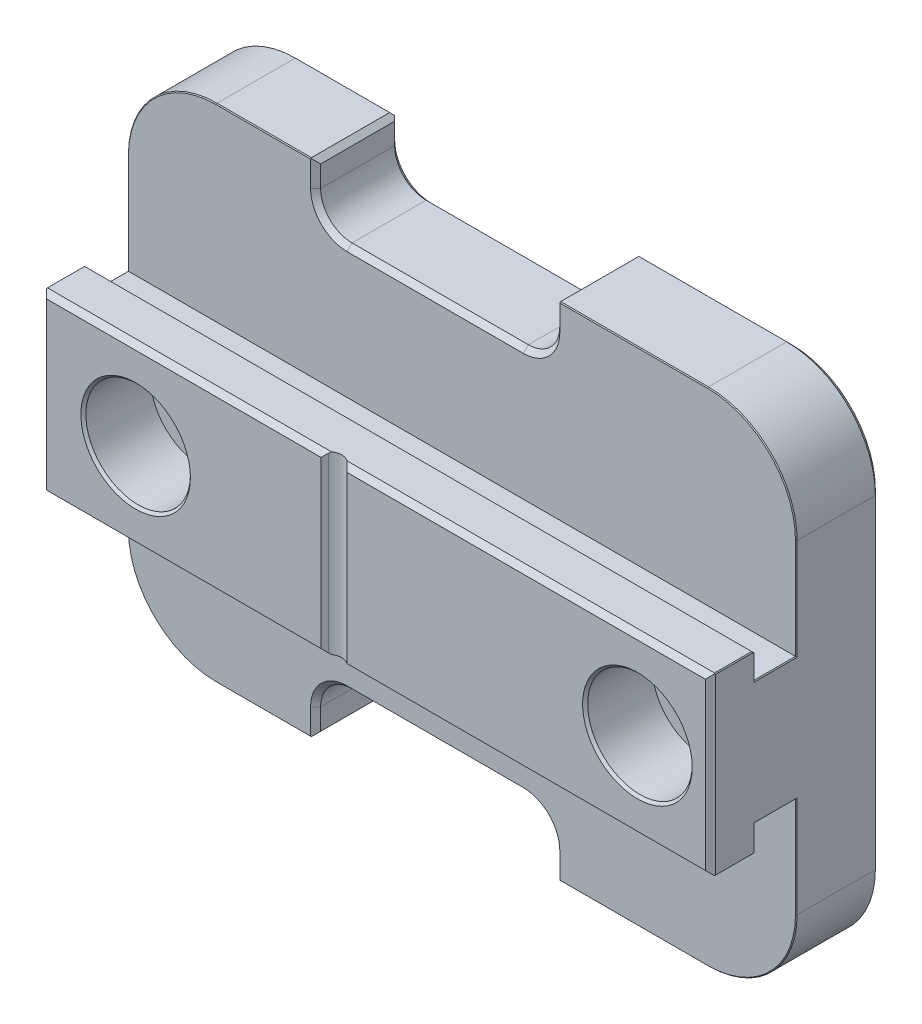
ISO-10303-21;
HEADER;
FILE_DESCRIPTION(('STEP AP214'),'2;1');
FILE_NAME('part.step','',(''),(''),'','','');
FILE_SCHEMA(('AUTOMOTIVE_DESIGN { 1 0 10303 214 1 1 1 1 }'));
ENDSEC;
DATA;
#1=APPLICATION_CONTEXT('core data for automotive mechanical design processes');
#2=APPLICATION_PROTOCOL_DEFINITION('international standard','automotive_design',2000,#1);
#3=PRODUCT_CONTEXT('',#1,'mechanical');
#4=PRODUCT('Part','Part','',(#3));
#5=PRODUCT_RELATED_PRODUCT_CATEGORY('part','',(#4));
#6=PRODUCT_DEFINITION_FORMATION('','',#4);
#7=PRODUCT_DEFINITION_CONTEXT('part definition',#1,'design');
#8=PRODUCT_DEFINITION('design','',#6,#7);
#9=PRODUCT_DEFINITION_SHAPE('','',#8);
#10=(LENGTH_UNIT() NAMED_UNIT(*) SI_UNIT(.MILLI.,.METRE.));
#11=(NAMED_UNIT(*) PLANE_ANGLE_UNIT() SI_UNIT($,.RADIAN.));
#12=(NAMED_UNIT(*) SI_UNIT($,.STERADIAN.) SOLID_ANGLE_UNIT());
#13=UNCERTAINTY_MEASURE_WITH_UNIT(LENGTH_MEASURE(1.E-05),#10,'distance_accuracy_value','');
#14=(GEOMETRIC_REPRESENTATION_CONTEXT(3) GLOBAL_UNCERTAINTY_ASSIGNED_CONTEXT((#13)) GLOBAL_UNIT_ASSIGNED_CONTEXT((#10,
#11,#12)) REPRESENTATION_CONTEXT('',''));
#15=CARTESIAN_POINT('',(0.,0.,0.));
#16=DIRECTION('',(0.,0.,1.));
#17=DIRECTION('',(1.,0.,0.));
#18=AXIS2_PLACEMENT_3D('',#15,#16,#17);
#19=CARTESIAN_POINT('',(-101.5492,-38.0746,0.));
#20=DIRECTION('',(0.,0.,-1.));
#21=DIRECTION('',(-1.,0.,0.));
#22=AXIS2_PLACEMENT_3D('',#19,#20,#21);
#23=PLANE('',#22);
#24=CARTESIAN_POINT('',(-41.4528,34.0868,0.));
#25=DIRECTION('',(0.,0.,-1.));
#26=DIRECTION('',(-1.,0.,0.));
#27=AXIS2_PLACEMENT_3D('',#24,#25,#26);
#28=CIRCLE('',#27,5.5372);
#29=CARTESIAN_POINT('',(-41.4528,28.5496,0.));
#30=VERTEX_POINT('',#29);
#31=CARTESIAN_POINT('',(-35.9156,34.0868,0.));
#32=VERTEX_POINT('',#31);
#33=EDGE_CURVE('E978',#30,#32,#28,.F.);
#34=ORIENTED_EDGE('',*,*,#33,.T.);
#35=DIRECTION('',(0.,1.,0.));
#36=VECTOR('',#35,1.);
#37=CARTESIAN_POINT('',(-35.9156,37.3126,0.));
#38=LINE('',#37,#36);
#39=CARTESIAN_POINT('',(-35.9156,37.3126,0.));
#40=VERTEX_POINT('',#39);
#41=EDGE_CURVE('E982',#32,#40,#38,.T.);
#42=ORIENTED_EDGE('',*,*,#41,.T.);
#43=DIRECTION('',(1.,0.,0.));
#44=VECTOR('',#43,1.);
#45=CARTESIAN_POINT('',(-101.5492,37.3126,0.));
#46=LINE('',#45,#44);
#47=CARTESIAN_POINT('',(-13.462,37.3126,0.));
#48=VERTEX_POINT('',#47);
#49=EDGE_CURVE('E1061',#40,#48,#46,.T.);
#50=ORIENTED_EDGE('',*,*,#49,.T.);
#51=CARTESIAN_POINT('',(-13.462,24.6126,0.));
#52=DIRECTION('',(0.,0.,-1.));
#53=DIRECTION('',(-1.,0.,0.));
#54=AXIS2_PLACEMENT_3D('',#51,#52,#53);
#55=CIRCLE('',#54,12.7);
#56=CARTESIAN_POINT('',(-0.761999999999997,24.6126,0.));
#57=VERTEX_POINT('',#56);
#58=EDGE_CURVE('E539',#48,#57,#55,.T.);
#59=ORIENTED_EDGE('',*,*,#58,.T.);
#60=DIRECTION('',(0.,-1.,0.));
#61=VECTOR('',#60,1.);
#62=CARTESIAN_POINT('',(-0.761999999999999,-24.6126,0.));
#63=LINE('',#62,#61);
#64=CARTESIAN_POINT('',(-0.761999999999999,-24.6126,0.));
#65=VERTEX_POINT('',#64);
#66=EDGE_CURVE('E534',#57,#65,#63,.T.);
#67=ORIENTED_EDGE('',*,*,#66,.T.);
#68=CARTESIAN_POINT('',(-13.462,-24.6126,0.));
#69=DIRECTION('',(0.,0.,-1.));
#70=DIRECTION('',(-1.,0.,0.));
#71=AXIS2_PLACEMENT_3D('',#68,#69,#70);
#72=CIRCLE('',#71,12.7);
#73=CARTESIAN_POINT('',(-13.462,-37.3126,0.));
#74=VERTEX_POINT('',#73);
#75=EDGE_CURVE('E512',#65,#74,#72,.T.);
#76=ORIENTED_EDGE('',*,*,#75,.T.);
#77=DIRECTION('',(-1.,0.,0.));
#78=VECTOR('',#77,1.);
#79=CARTESIAN_POINT('',(-101.5492,-37.3126,0.));
#80=LINE('',#79,#78);
#81=CARTESIAN_POINT('',(-35.9156,-37.3126,0.));
#82=VERTEX_POINT('',#81);
#83=EDGE_CURVE('E521',#74,#82,#80,.T.);
#84=ORIENTED_EDGE('',*,*,#83,.T.);
#85=DIRECTION('',(0.,1.,0.));
#86=VECTOR('',#85,1.);
#87=CARTESIAN_POINT('',(-35.9156,-38.0746,0.));
#88=LINE('',#87,#86);
#89=CARTESIAN_POINT('',(-35.9156,-34.0868,0.));
#90=VERTEX_POINT('',#89);
#91=EDGE_CURVE('E972',#82,#90,#88,.T.);
#92=ORIENTED_EDGE('',*,*,#91,.T.);
#93=CARTESIAN_POINT('',(-41.4528,-34.0868,0.));
#94=DIRECTION('',(0.,0.,-1.));
#95=DIRECTION('',(-1.,0.,0.));
#96=AXIS2_PLACEMENT_3D('',#93,#94,#95);
#97=CIRCLE('',#96,5.5372);
#98=CARTESIAN_POINT('',(-41.4528,-28.5496,0.));
#99=VERTEX_POINT('',#98);
#100=EDGE_CURVE('E968',#90,#99,#97,.F.);
#101=ORIENTED_EDGE('',*,*,#100,.T.);
#102=DIRECTION('',(-1.,0.,0.));
#103=VECTOR('',#102,1.);
#104=CARTESIAN_POINT('',(-101.5492,-28.5496,0.));
#105=LINE('',#104,#103);
#106=CARTESIAN_POINT('',(-68.2244,-28.5496,0.));
#107=VERTEX_POINT('',#106);
#108=EDGE_CURVE('E964',#99,#107,#105,.T.);
#109=ORIENTED_EDGE('',*,*,#108,.T.);
#110=CARTESIAN_POINT('',(-68.2244,-34.0868,0.));
#111=DIRECTION('',(0.,0.,-1.));
#112=DIRECTION('',(-1.,0.,0.));
#113=AXIS2_PLACEMENT_3D('',#110,#111,#112);
#114=CIRCLE('',#113,5.53720000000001);
#115=CARTESIAN_POINT('',(-73.7616,-34.0868,0.));
#116=VERTEX_POINT('',#115);
#117=EDGE_CURVE('E966',#107,#116,#114,.F.);
#118=ORIENTED_EDGE('',*,*,#117,.T.);
#119=DIRECTION('',(0.,-1.,0.));
#120=VECTOR('',#119,1.);
#121=CARTESIAN_POINT('',(-73.7616,-38.0746,0.));
#122=LINE('',#121,#120);
#123=CARTESIAN_POINT('',(-73.7616,-37.3126,0.));
#124=VERTEX_POINT('',#123);
#125=EDGE_CURVE('E970',#116,#124,#122,.T.);
#126=ORIENTED_EDGE('',*,*,#125,.T.);
#127=CARTESIAN_POINT('',(-88.0872,-37.3126,0.));
#128=VERTEX_POINT('',#127);
#129=EDGE_CURVE('E530',#124,#128,#80,.T.);
#130=ORIENTED_EDGE('',*,*,#129,.T.);
#131=CARTESIAN_POINT('',(-88.0872,-24.6126,0.));
#132=DIRECTION('',(0.,0.,-1.));
#133=DIRECTION('',(-1.,0.,0.));
#134=AXIS2_PLACEMENT_3D('',#131,#132,#133);
#135=CIRCLE('',#134,12.7);
#136=CARTESIAN_POINT('',(-100.7872,-24.6126,0.));
#137=VERTEX_POINT('',#136);
#138=EDGE_CURVE('E529',#128,#137,#135,.T.);
#139=ORIENTED_EDGE('',*,*,#138,.T.);
#140=DIRECTION('',(0.,1.,0.));
#141=VECTOR('',#140,1.);
#142=CARTESIAN_POINT('',(-100.7872,-38.0746,0.));
#143=LINE('',#142,#141);
#144=CARTESIAN_POINT('',(-100.7872,24.6126,0.));
#145=VERTEX_POINT('',#144);
#146=EDGE_CURVE('E1057',#137,#145,#143,.T.);
#147=ORIENTED_EDGE('',*,*,#146,.T.);
#148=CARTESIAN_POINT('',(-88.0872,24.6126,0.));
#149=DIRECTION('',(0.,0.,-1.));
#150=DIRECTION('',(-1.,0.,0.));
#151=AXIS2_PLACEMENT_3D('',#148,#149,#150);
#152=CIRCLE('',#151,12.7);
#153=CARTESIAN_POINT('',(-88.0872,37.3126,0.));
#154=VERTEX_POINT('',#153);
#155=EDGE_CURVE('E1059',#145,#154,#152,.T.);
#156=ORIENTED_EDGE('',*,*,#155,.T.);
#157=CARTESIAN_POINT('',(-73.7616,37.3126,0.));
#158=VERTEX_POINT('',#157);
#159=EDGE_CURVE('E1062',#154,#158,#46,.T.);
#160=ORIENTED_EDGE('',*,*,#159,.T.);
#161=DIRECTION('',(0.,-1.,0.));
#162=VECTOR('',#161,1.);
#163=CARTESIAN_POINT('',(-73.7616,34.0868,0.));
#164=LINE('',#163,#162);
#165=CARTESIAN_POINT('',(-73.7616,34.0868,0.));
#166=VERTEX_POINT('',#165);
#167=EDGE_CURVE('E980',#158,#166,#164,.T.);
#168=ORIENTED_EDGE('',*,*,#167,.T.);
#169=CARTESIAN_POINT('',(-68.2244,34.0868,0.));
#170=DIRECTION('',(0.,0.,-1.));
#171=DIRECTION('',(-1.,0.,0.));
#172=AXIS2_PLACEMENT_3D('',#169,#170,#171);
#173=CIRCLE('',#172,5.5372);
#174=CARTESIAN_POINT('',(-68.2244,28.5496,0.));
#175=VERTEX_POINT('',#174);
#176=EDGE_CURVE('E976',#166,#175,#173,.F.);
#177=ORIENTED_EDGE('',*,*,#176,.T.);
#178=DIRECTION('',(1.,0.,0.));
#179=VECTOR('',#178,1.);
#180=CARTESIAN_POINT('',(-41.4528,28.5496,0.));
#181=LINE('',#180,#179);
#182=EDGE_CURVE('E974',#175,#30,#181,.T.);
#183=ORIENTED_EDGE('',*,*,#182,.T.);
#184=EDGE_LOOP('',(#34,#42,#50,#59,#67,#76,#84,#92,#101,#109,#118,#126,#130,#139,#147,#156,#160,
#168,#177,#183));
#185=FACE_BOUND('',#184,.T.);
#186=CARTESIAN_POINT('',(-11.0744,0.,0.));
#187=DIRECTION('',(0.,0.,-1.));
#188=DIRECTION('',(-1.,0.,0.));
#189=AXIS2_PLACEMENT_3D('',#186,#187,#188);
#190=CIRCLE('',#189,5.72770000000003);
#191=CARTESIAN_POINT('',(-16.8021,0.,0.));
#192=VERTEX_POINT('',#191);
#193=EDGE_CURVE('E1121',#192,#192,#190,.F.);
#194=ORIENTED_EDGE('',*,*,#193,.T.);
#195=EDGE_LOOP('',(#194));
#196=FACE_BOUND('',#195,.T.);
#197=CARTESIAN_POINT('',(-87.2744,0.,0.));
#198=DIRECTION('',(0.,0.,-1.));
#199=DIRECTION('',(-1.,0.,0.));
#200=AXIS2_PLACEMENT_3D('',#197,#198,#199);
#201=CIRCLE('',#200,5.74039999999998);
#202=CARTESIAN_POINT('',(-93.0148,0.,0.));
#203=VERTEX_POINT('',#202);
#204=EDGE_CURVE('E1118',#203,#203,#201,.F.);
#205=ORIENTED_EDGE('',*,*,#204,.T.);
#206=EDGE_LOOP('',(#205));
#207=FACE_BOUND('',#206,.T.);
#208=ADVANCED_FACE('F32',(#185,#196,#207),#23,.T.);
#209=CARTESIAN_POINT('',(-101.5492,-38.0746,12.7635));
#210=DIRECTION('',(0.,-1.,0.));
#211=DIRECTION('',(0.,0.,-1.));
#212=AXIS2_PLACEMENT_3D('',#209,#210,#211);
#213=PLANE('',#212);
#214=DIRECTION('',(1.,0.,0.));
#215=VECTOR('',#214,1.);
#216=CARTESIAN_POINT('',(-101.5492,-38.0746,0.761999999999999));
#217=LINE('',#216,#215);
#218=CARTESIAN_POINT('',(-88.0872,-38.0746,0.761999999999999));
#219=VERTEX_POINT('',#218);
#220=CARTESIAN_POINT('',(-73.7616,-38.0746,0.761999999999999));
#221=VERTEX_POINT('',#220);
#222=EDGE_CURVE('E560',#219,#221,#217,.T.);
#223=ORIENTED_EDGE('',*,*,#222,.T.);
#224=DIRECTION('',(0.,0.,1.));
#225=VECTOR('',#224,1.);
#226=CARTESIAN_POINT('',(-73.7616,-38.0746,12.7635));
#227=LINE('',#226,#225);
#228=CARTESIAN_POINT('',(-73.7616,-38.0746,12.6365));
#229=VERTEX_POINT('',#228);
#230=EDGE_CURVE('E845',#221,#229,#227,.T.);
#231=ORIENTED_EDGE('',*,*,#230,.T.);
#232=DIRECTION('',(-1.,0.,0.));
#233=VECTOR('',#232,1.);
#234=CARTESIAN_POINT('',(-101.5492,-38.0746,12.6365));
#235=LINE('',#234,#233);
#236=CARTESIAN_POINT('',(-88.0872,-38.0746,12.6365));
#237=VERTEX_POINT('',#236);
#238=EDGE_CURVE('E724',#229,#237,#235,.T.);
#239=ORIENTED_EDGE('',*,*,#238,.T.);
#240=DIRECTION('',(0.,0.,-1.));
#241=VECTOR('',#240,1.);
#242=CARTESIAN_POINT('',(-88.0872,-38.0746,12.7635));
#243=LINE('',#242,#241);
#244=EDGE_CURVE('E1087',#237,#219,#243,.T.);
#245=ORIENTED_EDGE('',*,*,#244,.T.);
#246=EDGE_LOOP('',(#223,#231,#239,#245));
#247=FACE_BOUND('',#246,.T.);
#248=ADVANCED_FACE('F1351',(#247),#213,.T.);
#249=CARTESIAN_POINT('',(-13.462,-38.0746,12.6365));
#250=VERTEX_POINT('',#249);
#251=CARTESIAN_POINT('',(-35.9156,-38.0746,12.6365));
#252=VERTEX_POINT('',#251);
#253=EDGE_CURVE('E725',#250,#252,#235,.T.);
#254=ORIENTED_EDGE('',*,*,#253,.T.);
#255=DIRECTION('',(0.,0.,-1.));
#256=VECTOR('',#255,1.);
#257=CARTESIAN_POINT('',(-35.9156,-38.0746,12.7635));
#258=LINE('',#257,#256);
#259=CARTESIAN_POINT('',(-35.9156,-38.0746,0.761999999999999));
#260=VERTEX_POINT('',#259);
#261=EDGE_CURVE('E836',#252,#260,#258,.T.);
#262=ORIENTED_EDGE('',*,*,#261,.T.);
#263=CARTESIAN_POINT('',(-13.462,-38.0746,0.761999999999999));
#264=VERTEX_POINT('',#263);
#265=EDGE_CURVE('E559',#260,#264,#217,.T.);
#266=ORIENTED_EDGE('',*,*,#265,.T.);
#267=DIRECTION('',(0.,0.,-1.));
#268=VECTOR('',#267,1.);
#269=CARTESIAN_POINT('',(-13.462,-38.0746,12.7635));
#270=LINE('',#269,#268);
#271=EDGE_CURVE('E1052',#264,#250,#270,.F.);
#272=ORIENTED_EDGE('',*,*,#271,.T.);
#273=EDGE_LOOP('',(#254,#262,#266,#272));
#274=FACE_BOUND('',#273,.T.);
#275=ADVANCED_FACE('F1288',(#274),#213,.T.);
#276=CARTESIAN_POINT('',(-101.5492,-38.0746,12.7635));
#277=DIRECTION('',(0.,0.,1.));
#278=DIRECTION('',(0.,-1.,0.));
#279=AXIS2_PLACEMENT_3D('',#276,#277,#278);
#280=PLANE('',#279);
#281=DIRECTION('',(1.,0.,0.));
#282=VECTOR('',#281,1.);
#283=CARTESIAN_POINT('',(-101.5492,-37.9476,12.7635));
#284=LINE('',#283,#282);
#285=CARTESIAN_POINT('',(-88.0872,-37.9476,12.7635));
#286=VERTEX_POINT('',#285);
#287=CARTESIAN_POINT('',(-73.7616,-37.9476,12.7635));
#288=VERTEX_POINT('',#287);
#289=EDGE_CURVE('E709',#286,#288,#284,.T.);
#290=ORIENTED_EDGE('',*,*,#289,.T.);
#291=DIRECTION('',(0.,1.,0.));
#292=VECTOR('',#291,1.);
#293=CARTESIAN_POINT('',(-73.7616,-38.0746,12.7635));
#294=LINE('',#293,#292);
#295=CARTESIAN_POINT('',(-73.7616,-34.0868,12.7635));
#296=VERTEX_POINT('',#295);
#297=EDGE_CURVE('E915',#288,#296,#294,.T.);
#298=ORIENTED_EDGE('',*,*,#297,.T.);
#299=CARTESIAN_POINT('',(-68.2244,-34.0868,12.7635));
#300=DIRECTION('',(0.,0.,1.));
#301=DIRECTION('',(0.,-1.,0.));
#302=AXIS2_PLACEMENT_3D('',#299,#300,#301);
#303=CIRCLE('',#302,5.5372);
#304=CARTESIAN_POINT('',(-68.2244,-28.5496,12.7635));
#305=VERTEX_POINT('',#304);
#306=EDGE_CURVE('E911',#296,#305,#303,.F.);
#307=ORIENTED_EDGE('',*,*,#306,.T.);
#308=DIRECTION('',(1.,0.,0.));
#309=VECTOR('',#308,1.);
#310=CARTESIAN_POINT('',(-101.5492,-28.5496,12.7635));
#311=LINE('',#310,#309);
#312=CARTESIAN_POINT('',(-41.4528,-28.5496,12.7635));
#313=VERTEX_POINT('',#312);
#314=EDGE_CURVE('E907',#305,#313,#311,.T.);
#315=ORIENTED_EDGE('',*,*,#314,.T.);
#316=CARTESIAN_POINT('',(-41.4528,-34.0868,12.7635));
#317=DIRECTION('',(0.,0.,1.));
#318=DIRECTION('',(0.,-1.,0.));
#319=AXIS2_PLACEMENT_3D('',#316,#317,#318);
#320=CIRCLE('',#319,5.5372);
#321=CARTESIAN_POINT('',(-35.9156,-34.0868,12.7635));
#322=VERTEX_POINT('',#321);
#323=EDGE_CURVE('E909',#313,#322,#320,.F.);
#324=ORIENTED_EDGE('',*,*,#323,.T.);
#325=DIRECTION('',(0.,-1.,0.));
#326=VECTOR('',#325,1.);
#327=CARTESIAN_POINT('',(-35.9156,-38.0746,12.7635));
#328=LINE('',#327,#326);
#329=CARTESIAN_POINT('',(-35.9156,-37.9476,12.7635));
#330=VERTEX_POINT('',#329);
#331=EDGE_CURVE('E913',#322,#330,#328,.T.);
#332=ORIENTED_EDGE('',*,*,#331,.T.);
#333=CARTESIAN_POINT('',(-13.462,-37.9476,12.7635));
#334=VERTEX_POINT('',#333);
#335=EDGE_CURVE('E708',#330,#334,#284,.T.);
#336=ORIENTED_EDGE('',*,*,#335,.T.);
#337=CARTESIAN_POINT('',(-13.462,-24.6126,12.7635));
#338=DIRECTION('',(0.,0.,1.));
#339=DIRECTION('',(0.,-1.,0.));
#340=AXIS2_PLACEMENT_3D('',#337,#338,#339);
#341=CIRCLE('',#340,13.335);
#342=CARTESIAN_POINT('',(-0.126999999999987,-24.6126,12.7635));
#343=VERTEX_POINT('',#342);
#344=EDGE_CURVE('E716',#334,#343,#341,.T.);
#345=ORIENTED_EDGE('',*,*,#344,.T.);
#346=DIRECTION('',(0.,1.,0.));
#347=VECTOR('',#346,1.);
#348=CARTESIAN_POINT('',(-0.126999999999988,-9.3726,12.7635));
#349=LINE('',#348,#347);
#350=CARTESIAN_POINT('',(-0.126999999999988,-9.3726,12.7635));
#351=VERTEX_POINT('',#350);
#352=EDGE_CURVE('E718',#343,#351,#349,.T.);
#353=ORIENTED_EDGE('',*,*,#352,.T.);
#354=DIRECTION('',(1.,0.,0.));
#355=VECTOR('',#354,1.);
#356=CARTESIAN_POINT('',(-101.5492,-9.3726,12.7635));
#357=LINE('',#356,#355);
#358=CARTESIAN_POINT('',(-101.4222,-9.3726,12.7635));
#359=VERTEX_POINT('',#358);
#360=EDGE_CURVE('E1133',#359,#351,#357,.T.);
#361=ORIENTED_EDGE('',*,*,#360,.F.);
#362=DIRECTION('',(0.,-1.,0.));
#363=VECTOR('',#362,1.);
#364=CARTESIAN_POINT('',(-101.4222,-38.0746,12.7635));
#365=LINE('',#364,#363);
#366=CARTESIAN_POINT('',(-101.4222,-24.6126,12.7635));
#367=VERTEX_POINT('',#366);
#368=EDGE_CURVE('E714',#359,#367,#365,.T.);
#369=ORIENTED_EDGE('',*,*,#368,.T.);
#370=CARTESIAN_POINT('',(-88.0872,-24.6126,12.7635));
#371=DIRECTION('',(0.,0.,1.));
#372=DIRECTION('',(0.,-1.,0.));
#373=AXIS2_PLACEMENT_3D('',#370,#371,#372);
#374=CIRCLE('',#373,13.335);
#375=EDGE_CURVE('E712',#367,#286,#374,.T.);
#376=ORIENTED_EDGE('',*,*,#375,.T.);
#377=EDGE_LOOP('',(#290,#298,#307,#315,#324,#332,#336,#345,#353,#361,#369,#376));
#378=FACE_BOUND('',#377,.T.);
#379=ADVANCED_FACE('F1341',(#378),#280,.T.);
#380=CARTESIAN_POINT('',(-101.5492,-38.0746,0.761999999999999));
#381=DIRECTION('',(0.,0.707106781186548,0.707106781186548));
#382=DIRECTION('',(0.,-0.707106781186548,0.707106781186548));
#383=AXIS2_PLACEMENT_3D('',#380,#381,#382);
#384=PLANE('',#383);
#385=ORIENTED_EDGE('',*,*,#129,.F.);
#386=DIRECTION('',(0.577350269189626,-0.577350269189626,0.577350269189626));
#387=VECTOR('',#386,1.);
#388=CARTESIAN_POINT('',(-82.5161333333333,-28.5580666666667,-8.75453333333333));
#389=LINE('',#388,#387);
#390=CARTESIAN_POINT('',(-73.3806,-37.6936,0.381));
#391=VERTEX_POINT('',#390);
#392=EDGE_CURVE('E1005',#124,#391,#389,.T.);
#393=ORIENTED_EDGE('',*,*,#392,.T.);
#394=DIRECTION('',(-0.577350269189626,-0.577350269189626,0.577350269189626));
#395=VECTOR('',#394,1.);
#396=CARTESIAN_POINT('',(-83.0241333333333,-47.3371333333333,10.0245333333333));
#397=LINE('',#396,#395);
#398=EDGE_CURVE('E854',#391,#221,#397,.T.);
#399=ORIENTED_EDGE('',*,*,#398,.T.);
#400=ORIENTED_EDGE('',*,*,#222,.F.);
#401=DIRECTION('',(0.,0.707106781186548,-0.707106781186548));
#402=VECTOR('',#401,1.);
#403=CARTESIAN_POINT('',(-88.0872,-38.0746,0.761999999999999));
#404=LINE('',#403,#402);
#405=EDGE_CURVE('E565',#219,#128,#404,.T.);
#406=ORIENTED_EDGE('',*,*,#405,.T.);
#407=EDGE_LOOP('',(#385,#393,#399,#400,#406));
#408=FACE_BOUND('',#407,.T.);
#409=ADVANCED_FACE('F1046',(#408),#384,.F.);
#410=DIRECTION('',(-0.577350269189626,0.577350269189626,-0.577350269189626));
#411=VECTOR('',#410,1.);
#412=CARTESIAN_POINT('',(-57.7934666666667,-16.1967333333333,-21.1158666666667));
#413=LINE('',#412,#411);
#414=CARTESIAN_POINT('',(-36.2966,-37.6936,0.380999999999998));
#415=VERTEX_POINT('',#414);
#416=EDGE_CURVE('E839',#260,#415,#413,.T.);
#417=ORIENTED_EDGE('',*,*,#416,.T.);
#418=DIRECTION('',(0.577350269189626,0.577350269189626,-0.577350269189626));
#419=VECTOR('',#418,1.);
#420=CARTESIAN_POINT('',(-58.3014666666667,-59.6984666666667,22.3858666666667));
#421=LINE('',#420,#419);
#422=EDGE_CURVE('E525',#415,#82,#421,.T.);
#423=ORIENTED_EDGE('',*,*,#422,.T.);
#424=ORIENTED_EDGE('',*,*,#83,.F.);
#425=DIRECTION('',(0.,0.707106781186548,-0.707106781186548));
#426=VECTOR('',#425,1.);
#427=CARTESIAN_POINT('',(-13.462,-38.0746,0.761999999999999));
#428=LINE('',#427,#426);
#429=EDGE_CURVE('E507',#264,#74,#428,.T.);
#430=ORIENTED_EDGE('',*,*,#429,.F.);
#431=ORIENTED_EDGE('',*,*,#265,.F.);
#432=EDGE_LOOP('',(#417,#423,#424,#430,#431));
#433=FACE_BOUND('',#432,.T.);
#434=ADVANCED_FACE('F523',(#433),#384,.F.);
#435=CARTESIAN_POINT('',(-101.5492,-37.9476,12.7635));
#436=DIRECTION('',(0.,0.707106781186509,-0.707106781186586));
#437=DIRECTION('',(0.,0.707106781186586,0.707106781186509));
#438=AXIS2_PLACEMENT_3D('',#435,#436,#437);
#439=PLANE('',#438);
#440=DIRECTION('',(0.577350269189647,0.577350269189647,0.577350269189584));
#441=VECTOR('',#440,1.);
#442=CARTESIAN_POINT('',(-82.9394666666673,-47.2524666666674,3.45863333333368));
#443=LINE('',#442,#441);
#444=CARTESIAN_POINT('',(-73.6981,-38.0111,12.7));
#445=VERTEX_POINT('',#444);
#446=EDGE_CURVE('E848',#229,#445,#443,.T.);
#447=ORIENTED_EDGE('',*,*,#446,.T.);
#448=DIRECTION('',(-0.577350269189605,0.577350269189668,0.577350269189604));
#449=VECTOR('',#448,1.);
#450=CARTESIAN_POINT('',(-83.0241333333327,-28.6850666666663,22.0260333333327));
#451=LINE('',#450,#449);
#452=EDGE_CURVE('E922',#445,#288,#451,.T.);
#453=ORIENTED_EDGE('',*,*,#452,.T.);
#454=ORIENTED_EDGE('',*,*,#289,.F.);
#455=DIRECTION('',(0.,0.707106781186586,0.707106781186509));
#456=VECTOR('',#455,1.);
#457=CARTESIAN_POINT('',(-88.0872,-38.0746,12.6365));
#458=LINE('',#457,#456);
#459=EDGE_CURVE('E763',#237,#286,#458,.T.);
#460=ORIENTED_EDGE('',*,*,#459,.F.);
#461=ORIENTED_EDGE('',*,*,#238,.F.);
#462=EDGE_LOOP('',(#447,#453,#454,#460,#461));
#463=FACE_BOUND('',#462,.T.);
#464=ADVANCED_FACE('F1344',(#463),#439,.F.);
#465=ORIENTED_EDGE('',*,*,#335,.F.);
#466=DIRECTION('',(-0.577350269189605,-0.577350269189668,-0.577350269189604));
#467=VECTOR('',#466,1.);
#468=CARTESIAN_POINT('',(-57.7934666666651,-59.8254666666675,-9.11436666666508));
#469=LINE('',#468,#467);
#470=CARTESIAN_POINT('',(-35.9791,-38.0111,12.7));
#471=VERTEX_POINT('',#470);
#472=EDGE_CURVE('E924',#330,#471,#469,.T.);
#473=ORIENTED_EDGE('',*,*,#472,.T.);
#474=DIRECTION('',(0.577350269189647,-0.577350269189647,-0.577350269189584));
#475=VECTOR('',#474,1.);
#476=CARTESIAN_POINT('',(-57.8781333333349,-16.1120666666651,34.5990333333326));
#477=LINE('',#476,#475);
#478=EDGE_CURVE('E843',#471,#252,#477,.T.);
#479=ORIENTED_EDGE('',*,*,#478,.T.);
#480=ORIENTED_EDGE('',*,*,#253,.F.);
#481=DIRECTION('',(0.,0.707106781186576,0.707106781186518));
#482=VECTOR('',#481,1.);
#483=CARTESIAN_POINT('',(-13.462,-38.0746,12.6365));
#484=LINE('',#483,#482);
#485=EDGE_CURVE('E766',#250,#334,#484,.T.);
#486=ORIENTED_EDGE('',*,*,#485,.T.);
#487=EDGE_LOOP('',(#465,#473,#479,#480,#486));
#488=FACE_BOUND('',#487,.T.);
#489=ADVANCED_FACE('F1285',(#488),#439,.F.);
#490=CARTESIAN_POINT('',(-101.5492,38.0746,12.7635));
#491=DIRECTION('',(0.,1.,0.));
#492=DIRECTION('',(0.,0.,1.));
#493=AXIS2_PLACEMENT_3D('',#490,#491,#492);
#494=PLANE('',#493);
#495=DIRECTION('',(1.,0.,0.));
#496=VECTOR('',#495,1.);
#497=CARTESIAN_POINT('',(-101.5492,38.0746,12.6365));
#498=LINE('',#497,#496);
#499=CARTESIAN_POINT('',(-88.0872,38.0746,12.6365));
#500=VERTEX_POINT('',#499);
#501=CARTESIAN_POINT('',(-73.7616,38.0746,12.6365));
#502=VERTEX_POINT('',#501);
#503=EDGE_CURVE('E689',#500,#502,#498,.T.);
#504=ORIENTED_EDGE('',*,*,#503,.T.);
#505=DIRECTION('',(0.,0.,-1.));
#506=VECTOR('',#505,1.);
#507=CARTESIAN_POINT('',(-73.7616,38.0746,0.761999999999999));
#508=LINE('',#507,#506);
#509=CARTESIAN_POINT('',(-73.7615999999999,38.0746,0.761999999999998));
#510=VERTEX_POINT('',#509);
#511=EDGE_CURVE('E870',#502,#510,#508,.T.);
#512=ORIENTED_EDGE('',*,*,#511,.T.);
#513=DIRECTION('',(-1.,0.,0.));
#514=VECTOR('',#513,1.);
#515=CARTESIAN_POINT('',(-101.5492,38.0746,0.761999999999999));
#516=LINE('',#515,#514);
#517=CARTESIAN_POINT('',(-88.0872,38.0746,0.761999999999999));
#518=VERTEX_POINT('',#517);
#519=EDGE_CURVE('E547',#510,#518,#516,.T.);
#520=ORIENTED_EDGE('',*,*,#519,.T.);
#521=DIRECTION('',(0.,0.,1.));
#522=VECTOR('',#521,1.);
#523=CARTESIAN_POINT('',(-88.0872,38.0746,12.7635));
#524=LINE('',#523,#522);
#525=EDGE_CURVE('E1098',#518,#500,#524,.T.);
#526=ORIENTED_EDGE('',*,*,#525,.T.);
#527=EDGE_LOOP('',(#504,#512,#520,#526));
#528=FACE_BOUND('',#527,.T.);
#529=ADVANCED_FACE('F1749',(#528),#494,.T.);
#530=CARTESIAN_POINT('',(-101.5492,37.3126,0.));
#531=DIRECTION('',(0.,-0.707106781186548,0.707106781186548));
#532=DIRECTION('',(0.,-0.707106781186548,-0.707106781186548));
#533=AXIS2_PLACEMENT_3D('',#530,#531,#532);
#534=PLANE('',#533);
#535=DIRECTION('',(-0.577350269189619,0.577350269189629,0.577350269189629));
#536=VECTOR('',#535,1.);
#537=CARTESIAN_POINT('',(-82.5161333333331,46.8291333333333,9.51653333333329));
#538=LINE('',#537,#536);
#539=CARTESIAN_POINT('',(-73.3806,37.6936,0.381000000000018));
#540=VERTEX_POINT('',#539);
#541=EDGE_CURVE('E872',#510,#540,#538,.F.);
#542=ORIENTED_EDGE('',*,*,#541,.T.);
#543=DIRECTION('',(0.577350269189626,0.577350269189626,0.577350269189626));
#544=VECTOR('',#543,1.);
#545=CARTESIAN_POINT('',(-83.0241333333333,28.0500666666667,-9.26253333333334));
#546=LINE('',#545,#544);
#547=EDGE_CURVE('E992',#540,#158,#546,.F.);
#548=ORIENTED_EDGE('',*,*,#547,.T.);
#549=ORIENTED_EDGE('',*,*,#159,.F.);
#550=DIRECTION('',(0.,0.707106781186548,0.707106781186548));
#551=VECTOR('',#550,1.);
#552=CARTESIAN_POINT('',(-88.0872,37.3126,0.));
#553=LINE('',#552,#551);
#554=EDGE_CURVE('E580',#154,#518,#553,.T.);
#555=ORIENTED_EDGE('',*,*,#554,.T.);
#556=ORIENTED_EDGE('',*,*,#519,.F.);
#557=EDGE_LOOP('',(#542,#548,#549,#555,#556));
#558=FACE_BOUND('',#557,.T.);
#559=ADVANCED_FACE('F1433',(#558),#534,.F.);
#560=CARTESIAN_POINT('',(-101.5492,38.0746,12.6365));
#561=DIRECTION('',(0.,-0.707106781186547,-0.707106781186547));
#562=DIRECTION('',(0.,0.707106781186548,-0.707106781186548));
#563=AXIS2_PLACEMENT_3D('',#560,#561,#562);
#564=PLANE('',#563);
#565=DIRECTION('',(-1.,0.,0.));
#566=VECTOR('',#565,1.);
#567=CARTESIAN_POINT('',(-101.5492,37.9476,12.7635));
#568=LINE('',#567,#566);
#569=CARTESIAN_POINT('',(-73.7616,37.9476,12.7635));
#570=VERTEX_POINT('',#569);
#571=CARTESIAN_POINT('',(-88.0872,37.9476,12.7635));
#572=VERTEX_POINT('',#571);
#573=EDGE_CURVE('E678',#570,#572,#568,.T.);
#574=ORIENTED_EDGE('',*,*,#573,.F.);
#575=DIRECTION('',(-0.577350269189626,-0.577350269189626,0.577350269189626));
#576=VECTOR('',#575,1.);
#577=CARTESIAN_POINT('',(-82.9394666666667,28.7697333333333,21.9413666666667));
#578=LINE('',#577,#576);
#579=CARTESIAN_POINT('',(-73.6981,38.0111,12.7));
#580=VERTEX_POINT('',#579);
#581=EDGE_CURVE('E888',#570,#580,#578,.F.);
#582=ORIENTED_EDGE('',*,*,#581,.T.);
#583=DIRECTION('',(0.577350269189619,-0.577350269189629,0.577350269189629));
#584=VECTOR('',#583,1.);
#585=CARTESIAN_POINT('',(-83.0241333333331,47.3371333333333,3.37396666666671));
#586=LINE('',#585,#584);
#587=EDGE_CURVE('E868',#580,#502,#586,.F.);
#588=ORIENTED_EDGE('',*,*,#587,.T.);
#589=ORIENTED_EDGE('',*,*,#503,.F.);
#590=DIRECTION('',(0.,0.707106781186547,-0.707106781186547));
#591=VECTOR('',#590,1.);
#592=CARTESIAN_POINT('',(-88.0872,37.9476,12.7635));
#593=LINE('',#592,#591);
#594=EDGE_CURVE('E746',#572,#500,#593,.T.);
#595=ORIENTED_EDGE('',*,*,#594,.F.);
#596=EDGE_LOOP('',(#574,#582,#588,#589,#595));
#597=FACE_BOUND('',#596,.T.);
#598=ADVANCED_FACE('F1473',(#597),#564,.F.);
#599=CARTESIAN_POINT('',(-101.5492,-13.335,25.8191));
#600=DIRECTION('',(0.,0.,1.));
#601=DIRECTION('',(1.,0.,0.));
#602=AXIS2_PLACEMENT_3D('',#599,#600,#601);
#603=PLANE('',#602);
#604=DIRECTION('',(0.,-1.,0.));
#605=VECTOR('',#604,1.);
#606=CARTESIAN_POINT('',(-59.1058,-13.335,25.8191));
#607=LINE('',#606,#605);
#608=CARTESIAN_POINT('',(-59.1058,12.573,25.8191));
#609=VERTEX_POINT('',#608);
#610=CARTESIAN_POINT('',(-59.1058,-12.573,25.8191));
#611=VERTEX_POINT('',#610);
#612=EDGE_CURVE('E1164',#609,#611,#607,.T.);
#613=ORIENTED_EDGE('',*,*,#612,.F.);
#614=DIRECTION('',(-1.,0.,0.));
#615=VECTOR('',#614,1.);
#616=CARTESIAN_POINT('',(-101.5492,12.573,25.8191));
#617=LINE('',#616,#615);
#618=CARTESIAN_POINT('',(-100.7872,12.573,25.8191));
#619=VERTEX_POINT('',#618);
#620=EDGE_CURVE('E625',#609,#619,#617,.T.);
#621=ORIENTED_EDGE('',*,*,#620,.T.);
#622=DIRECTION('',(0.,-1.,0.));
#623=VECTOR('',#622,1.);
#624=CARTESIAN_POINT('',(-100.7872,-13.335,25.8191));
#625=LINE('',#624,#623);
#626=CARTESIAN_POINT('',(-100.7872,-12.573,25.8191));
#627=VERTEX_POINT('',#626);
#628=EDGE_CURVE('E622',#619,#627,#625,.T.);
#629=ORIENTED_EDGE('',*,*,#628,.T.);
#630=DIRECTION('',(1.,0.,0.));
#631=VECTOR('',#630,1.);
#632=CARTESIAN_POINT('',(-101.5492,-12.573,25.8191));
#633=LINE('',#632,#631);
#634=EDGE_CURVE('E620',#627,#611,#633,.T.);
#635=ORIENTED_EDGE('',*,*,#634,.T.);
#636=EDGE_LOOP('',(#613,#621,#629,#635));
#637=FACE_BOUND('',#636,.T.);
#638=CARTESIAN_POINT('',(-87.2744,0.,25.8191));
#639=DIRECTION('',(0.,0.,1.));
#640=DIRECTION('',(1.,0.,0.));
#641=AXIS2_PLACEMENT_3D('',#638,#639,#640);
#642=CIRCLE('',#641,8.31850000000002);
#643=CARTESIAN_POINT('',(-78.9559,0.,25.8191));
#644=VERTEX_POINT('',#643);
#645=EDGE_CURVE('E1109',#644,#644,#642,.F.);
#646=ORIENTED_EDGE('',*,*,#645,.T.);
#647=EDGE_LOOP('',(#646));
#648=FACE_BOUND('',#647,.T.);
#649=ADVANCED_FACE('F1193',(#637,#648),#603,.T.);
#650=DIRECTION('',(0.,1.,0.));
#651=VECTOR('',#650,1.);
#652=CARTESIAN_POINT('',(-55.1434,-13.335,25.8191));
#653=LINE('',#652,#651);
#654=CARTESIAN_POINT('',(-55.1434,-12.573,25.8191));
#655=VERTEX_POINT('',#654);
#656=CARTESIAN_POINT('',(-55.1434,12.573,25.8191));
#657=VERTEX_POINT('',#656);
#658=EDGE_CURVE('E1170',#655,#657,#653,.T.);
#659=ORIENTED_EDGE('',*,*,#658,.F.);
#660=DIRECTION('',(1.,0.,0.));
#661=VECTOR('',#660,1.);
#662=CARTESIAN_POINT('',(-101.5492,-12.573,25.8191));
#663=LINE('',#662,#661);
#664=CARTESIAN_POINT('',(-0.761999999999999,-12.573,25.8191));
#665=VERTEX_POINT('',#664);
#666=EDGE_CURVE('E588',#655,#665,#663,.T.);
#667=ORIENTED_EDGE('',*,*,#666,.T.);
#668=DIRECTION('',(0.,1.,0.));
#669=VECTOR('',#668,1.);
#670=CARTESIAN_POINT('',(-0.761999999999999,13.335,25.8191));
#671=LINE('',#670,#669);
#672=CARTESIAN_POINT('',(-0.761999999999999,12.573,25.8191));
#673=VERTEX_POINT('',#672);
#674=EDGE_CURVE('E585',#665,#673,#671,.T.);
#675=ORIENTED_EDGE('',*,*,#674,.T.);
#676=DIRECTION('',(-1.,0.,0.));
#677=VECTOR('',#676,1.);
#678=CARTESIAN_POINT('',(-101.5492,12.573,25.8191));
#679=LINE('',#678,#677);
#680=EDGE_CURVE('E562',#673,#657,#679,.T.);
#681=ORIENTED_EDGE('',*,*,#680,.T.);
#682=EDGE_LOOP('',(#659,#667,#675,#681));
#683=FACE_BOUND('',#682,.T.);
#684=CARTESIAN_POINT('',(-11.0744,0.,25.8191));
#685=DIRECTION('',(0.,0.,1.));
#686=DIRECTION('',(1.,0.,0.));
#687=AXIS2_PLACEMENT_3D('',#684,#685,#686);
#688=CIRCLE('',#687,8.31849999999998);
#689=CARTESIAN_POINT('',(-2.75590000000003,0.,25.8191));
#690=VERTEX_POINT('',#689);
#691=EDGE_CURVE('E1106',#690,#690,#688,.F.);
#692=ORIENTED_EDGE('',*,*,#691,.T.);
#693=EDGE_LOOP('',(#692));
#694=FACE_BOUND('',#693,.T.);
#695=ADVANCED_FACE('F1248',(#683,#694),#603,.T.);
#696=CARTESIAN_POINT('',(-101.5492,-9.3726,12.7635));
#697=DIRECTION('',(0.,-1.,0.));
#698=DIRECTION('',(0.,0.,-1.));
#699=AXIS2_PLACEMENT_3D('',#696,#697,#698);
#700=PLANE('',#699);
#701=DIRECTION('',(1.,0.,0.));
#702=VECTOR('',#701,1.);
#703=CARTESIAN_POINT('',(-101.5492,-9.3726,19.1643));
#704=LINE('',#703,#702);
#705=CARTESIAN_POINT('',(-101.4222,-9.3726,19.1643));
#706=VERTEX_POINT('',#705);
#707=CARTESIAN_POINT('',(-0.126999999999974,-9.3726,19.1643));
#708=VERTEX_POINT('',#707);
#709=EDGE_CURVE('E1141',#706,#708,#704,.T.);
#710=ORIENTED_EDGE('',*,*,#709,.F.);
#711=DIRECTION('',(0.,0.,-1.));
#712=VECTOR('',#711,1.);
#713=CARTESIAN_POINT('',(-101.4222,-9.3726,12.7635));
#714=LINE('',#713,#712);
#715=EDGE_CURVE('E705',#706,#359,#714,.T.);
#716=ORIENTED_EDGE('',*,*,#715,.T.);
#717=ORIENTED_EDGE('',*,*,#360,.T.);
#718=DIRECTION('',(0.,0.,1.));
#719=VECTOR('',#718,1.);
#720=CARTESIAN_POINT('',(-0.126999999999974,-9.3726,19.1643));
#721=LINE('',#720,#719);
#722=EDGE_CURVE('E703',#351,#708,#721,.T.);
#723=ORIENTED_EDGE('',*,*,#722,.T.);
#724=EDGE_LOOP('',(#710,#716,#717,#723));
#725=FACE_BOUND('',#724,.T.);
#726=ADVANCED_FACE('F2006',(#725),#700,.T.);
#727=CARTESIAN_POINT('',(-101.5492,-9.3726,19.1643));
#728=DIRECTION('',(0.,0.,-1.));
#729=DIRECTION('',(-1.,0.,0.));
#730=AXIS2_PLACEMENT_3D('',#727,#728,#729);
#731=PLANE('',#730);
#732=DIRECTION('',(0.,1.,0.));
#733=VECTOR('',#732,1.);
#734=CARTESIAN_POINT('',(0.,-9.3726,19.1643));
#735=LINE('',#734,#733);
#736=CARTESIAN_POINT('',(0.,-13.081,19.1643));
#737=VERTEX_POINT('',#736);
#738=CARTESIAN_POINT('',(0.,-9.24560000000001,19.1643));
#739=VERTEX_POINT('',#738);
#740=EDGE_CURVE('E1146',#737,#739,#735,.T.);
#741=ORIENTED_EDGE('',*,*,#740,.F.);
#742=DIRECTION('',(-1.,0.,0.));
#743=VECTOR('',#742,1.);
#744=CARTESIAN_POINT('',(-101.5492,-13.081,19.1643));
#745=LINE('',#744,#743);
#746=CARTESIAN_POINT('',(-101.5492,-13.081,19.1643));
#747=VERTEX_POINT('',#746);
#748=EDGE_CURVE('E658',#737,#747,#745,.T.);
#749=ORIENTED_EDGE('',*,*,#748,.T.);
#750=DIRECTION('',(0.,1.,0.));
#751=VECTOR('',#750,1.);
#752=CARTESIAN_POINT('',(-101.5492,-9.3726,19.1643));
#753=LINE('',#752,#751);
#754=CARTESIAN_POINT('',(-101.5492,-9.24560000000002,19.1643));
#755=VERTEX_POINT('',#754);
#756=EDGE_CURVE('E1138',#747,#755,#753,.T.);
#757=ORIENTED_EDGE('',*,*,#756,.T.);
#758=DIRECTION('',(-0.707106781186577,0.707106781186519,0.));
#759=VECTOR('',#758,1.);
#760=CARTESIAN_POINT('',(-101.4222,-9.3726,19.1643));
#761=LINE('',#760,#759);
#762=EDGE_CURVE('E733',#755,#706,#761,.F.);
#763=ORIENTED_EDGE('',*,*,#762,.T.);
#764=ORIENTED_EDGE('',*,*,#709,.T.);
#765=DIRECTION('',(0.707106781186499,0.707106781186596,0.));
#766=VECTOR('',#765,1.);
#767=CARTESIAN_POINT('',(0.,-9.24560000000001,19.1643));
#768=LINE('',#767,#766);
#769=EDGE_CURVE('E735',#708,#739,#768,.T.);
#770=ORIENTED_EDGE('',*,*,#769,.T.);
#771=EDGE_LOOP('',(#741,#749,#757,#763,#764,#770));
#772=FACE_BOUND('',#771,.T.);
#773=ADVANCED_FACE('F1268',(#772),#731,.T.);
#774=CARTESIAN_POINT('',(-101.5492,-13.335,19.1643));
#775=DIRECTION('',(0.,-1.,0.));
#776=DIRECTION('',(0.,0.,-1.));
#777=AXIS2_PLACEMENT_3D('',#774,#775,#776);
#778=PLANE('',#777);
#779=DIRECTION('',(1.,0.,0.));
#780=VECTOR('',#779,1.);
#781=CARTESIAN_POINT('',(-101.5492,-13.335,19.4183));
#782=LINE('',#781,#780);
#783=CARTESIAN_POINT('',(-101.4222,-13.335,19.4183));
#784=VERTEX_POINT('',#783);
#785=CARTESIAN_POINT('',(-0.127000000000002,-13.335,19.4183));
#786=VERTEX_POINT('',#785);
#787=EDGE_CURVE('E655',#784,#786,#782,.T.);
#788=ORIENTED_EDGE('',*,*,#787,.T.);
#789=DIRECTION('',(0.,0.,1.));
#790=VECTOR('',#789,1.);
#791=CARTESIAN_POINT('',(-0.127000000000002,-13.335,25.0571));
#792=LINE('',#791,#790);
#793=CARTESIAN_POINT('',(-0.126999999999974,-13.335,25.0571));
#794=VERTEX_POINT('',#793);
#795=EDGE_CURVE('E811',#786,#794,#792,.T.);
#796=ORIENTED_EDGE('',*,*,#795,.T.);
#797=DIRECTION('',(-1.,0.,0.));
#798=VECTOR('',#797,1.);
#799=CARTESIAN_POINT('',(-101.5492,-13.335,25.0571));
#800=LINE('',#799,#798);
#801=CARTESIAN_POINT('',(-55.9448909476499,-13.335,25.0571));
#802=VERTEX_POINT('',#801);
#803=EDGE_CURVE('E594',#794,#802,#800,.T.);
#804=ORIENTED_EDGE('',*,*,#803,.T.);
#805=CARTESIAN_POINT('',(-57.1246,-13.335,26.7115819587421));
#806=DIRECTION('',(0.,-1.,0.));
#807=DIRECTION('',(0.,0.,-1.));
#808=AXIS2_PLACEMENT_3D('',#805,#806,#807);
#809=CIRCLE('',#808,2.03199999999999);
#810=CARTESIAN_POINT('',(-58.3043090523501,-13.335,25.0571));
#811=VERTEX_POINT('',#810);
#812=EDGE_CURVE('E1167',#811,#802,#809,.T.);
#813=ORIENTED_EDGE('',*,*,#812,.F.);
#814=DIRECTION('',(-1.,0.,0.));
#815=VECTOR('',#814,1.);
#816=CARTESIAN_POINT('',(-101.5492,-13.335,25.0571));
#817=LINE('',#816,#815);
#818=CARTESIAN_POINT('',(-101.4222,-13.335,25.0571));
#819=VERTEX_POINT('',#818);
#820=EDGE_CURVE('E591',#811,#819,#817,.T.);
#821=ORIENTED_EDGE('',*,*,#820,.T.);
#822=DIRECTION('',(0.,0.,-1.));
#823=VECTOR('',#822,1.);
#824=CARTESIAN_POINT('',(-101.4222,-13.335,19.1643));
#825=LINE('',#824,#823);
#826=EDGE_CURVE('E808',#819,#784,#825,.T.);
#827=ORIENTED_EDGE('',*,*,#826,.T.);
#828=EDGE_LOOP('',(#788,#796,#804,#813,#821,#827));
#829=FACE_BOUND('',#828,.T.);
#830=ADVANCED_FACE('F1212',(#829),#778,.T.);
#831=CARTESIAN_POINT('',(-101.5492,13.335,19.1643));
#832=DIRECTION('',(0.,1.,0.));
#833=DIRECTION('',(0.,0.,1.));
#834=AXIS2_PLACEMENT_3D('',#831,#832,#833);
#835=PLANE('',#834);
#836=DIRECTION('',(-1.,0.,0.));
#837=VECTOR('',#836,1.);
#838=CARTESIAN_POINT('',(-101.5492,13.335,19.4183));
#839=LINE('',#838,#837);
#840=CARTESIAN_POINT('',(-0.126999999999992,13.335,19.4183));
#841=VERTEX_POINT('',#840);
#842=CARTESIAN_POINT('',(-101.4222,13.335,19.4183));
#843=VERTEX_POINT('',#842);
#844=EDGE_CURVE('E647',#841,#843,#839,.T.);
#845=ORIENTED_EDGE('',*,*,#844,.T.);
#846=DIRECTION('',(0.,0.,1.));
#847=VECTOR('',#846,1.);
#848=CARTESIAN_POINT('',(-101.4222,13.335,19.1643));
#849=LINE('',#848,#847);
#850=CARTESIAN_POINT('',(-101.4222,13.335,25.0571));
#851=VERTEX_POINT('',#850);
#852=EDGE_CURVE('E775',#843,#851,#849,.T.);
#853=ORIENTED_EDGE('',*,*,#852,.T.);
#854=DIRECTION('',(1.,0.,0.));
#855=VECTOR('',#854,1.);
#856=CARTESIAN_POINT('',(-101.5492,13.335,25.0571));
#857=LINE('',#856,#855);
#858=CARTESIAN_POINT('',(-58.3043090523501,13.335,25.0571));
#859=VERTEX_POINT('',#858);
#860=EDGE_CURVE('E611',#851,#859,#857,.T.);
#861=ORIENTED_EDGE('',*,*,#860,.T.);
#862=CARTESIAN_POINT('',(-57.1246,13.335,26.7115819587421));
#863=DIRECTION('',(0.,1.,0.));
#864=DIRECTION('',(0.,0.,1.));
#865=AXIS2_PLACEMENT_3D('',#862,#863,#864);
#866=CIRCLE('',#865,2.03199999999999);
#867=CARTESIAN_POINT('',(-55.9448909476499,13.335,25.0571));
#868=VERTEX_POINT('',#867);
#869=EDGE_CURVE('E1050',#868,#859,#866,.T.);
#870=ORIENTED_EDGE('',*,*,#869,.F.);
#871=DIRECTION('',(1.,0.,0.));
#872=VECTOR('',#871,1.);
#873=CARTESIAN_POINT('',(-101.5492,13.335,25.0571));
#874=LINE('',#873,#872);
#875=CARTESIAN_POINT('',(-0.127000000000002,13.335,25.0571));
#876=VERTEX_POINT('',#875);
#877=EDGE_CURVE('E613',#868,#876,#874,.T.);
#878=ORIENTED_EDGE('',*,*,#877,.T.);
#879=DIRECTION('',(0.,0.,-1.));
#880=VECTOR('',#879,1.);
#881=CARTESIAN_POINT('',(-0.127000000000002,13.335,19.4183));
#882=LINE('',#881,#880);
#883=EDGE_CURVE('E738',#876,#841,#882,.T.);
#884=ORIENTED_EDGE('',*,*,#883,.T.);
#885=EDGE_LOOP('',(#845,#853,#861,#870,#878,#884));
#886=FACE_BOUND('',#885,.T.);
#887=ADVANCED_FACE('F1256',(#886),#835,.T.);
#888=CARTESIAN_POINT('',(-101.5492,9.3726,19.1643));
#889=DIRECTION('',(0.,0.,-1.));
#890=DIRECTION('',(-1.,0.,0.));
#891=AXIS2_PLACEMENT_3D('',#888,#889,#890);
#892=PLANE('',#891);
#893=DIRECTION('',(0.,1.,0.));
#894=VECTOR('',#893,1.);
#895=CARTESIAN_POINT('',(-101.5492,9.3726,19.1643));
#896=LINE('',#895,#894);
#897=CARTESIAN_POINT('',(-101.5492,9.2456,19.1643));
#898=VERTEX_POINT('',#897);
#899=CARTESIAN_POINT('',(-101.5492,13.081,19.1643));
#900=VERTEX_POINT('',#899);
#901=EDGE_CURVE('E1148',#898,#900,#896,.T.);
#902=ORIENTED_EDGE('',*,*,#901,.T.);
#903=DIRECTION('',(1.,0.,0.));
#904=VECTOR('',#903,1.);
#905=CARTESIAN_POINT('',(-101.5492,13.081,19.1643));
#906=LINE('',#905,#904);
#907=CARTESIAN_POINT('',(0.,13.081,19.1643));
#908=VERTEX_POINT('',#907);
#909=EDGE_CURVE('E631',#900,#908,#906,.T.);
#910=ORIENTED_EDGE('',*,*,#909,.T.);
#911=DIRECTION('',(0.,1.,0.));
#912=VECTOR('',#911,1.);
#913=CARTESIAN_POINT('',(0.,9.3726,19.1643));
#914=LINE('',#913,#912);
#915=CARTESIAN_POINT('',(0.,9.2456,19.1643));
#916=VERTEX_POINT('',#915);
#917=EDGE_CURVE('E1149',#916,#908,#914,.T.);
#918=ORIENTED_EDGE('',*,*,#917,.F.);
#919=DIRECTION('',(-0.707106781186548,0.707106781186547,0.));
#920=VECTOR('',#919,1.);
#921=CARTESIAN_POINT('',(0.,9.2456,19.1643));
#922=LINE('',#921,#920);
#923=CARTESIAN_POINT('',(-0.127000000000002,9.3726,19.1643));
#924=VERTEX_POINT('',#923);
#925=EDGE_CURVE('E731',#916,#924,#922,.T.);
#926=ORIENTED_EDGE('',*,*,#925,.T.);
#927=DIRECTION('',(1.,0.,0.));
#928=VECTOR('',#927,1.);
#929=CARTESIAN_POINT('',(-101.5492,9.3726,19.1643));
#930=LINE('',#929,#928);
#931=CARTESIAN_POINT('',(-101.4222,9.3726,19.1643));
#932=VERTEX_POINT('',#931);
#933=EDGE_CURVE('E1137',#932,#924,#930,.T.);
#934=ORIENTED_EDGE('',*,*,#933,.F.);
#935=DIRECTION('',(0.707106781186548,0.707106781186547,0.));
#936=VECTOR('',#935,1.);
#937=CARTESIAN_POINT('',(-101.4222,9.3726,19.1643));
#938=LINE('',#937,#936);
#939=EDGE_CURVE('E728',#932,#898,#938,.F.);
#940=ORIENTED_EDGE('',*,*,#939,.T.);
#941=EDGE_LOOP('',(#902,#910,#918,#926,#934,#940));
#942=FACE_BOUND('',#941,.T.);
#943=ADVANCED_FACE('F1987',(#942),#892,.T.);
#944=CARTESIAN_POINT('',(-101.5492,9.3726,12.7635));
#945=DIRECTION('',(0.,1.,0.));
#946=DIRECTION('',(0.,0.,1.));
#947=AXIS2_PLACEMENT_3D('',#944,#945,#946);
#948=PLANE('',#947);
#949=DIRECTION('',(1.,0.,0.));
#950=VECTOR('',#949,1.);
#951=CARTESIAN_POINT('',(-101.5492,9.3726,12.7635));
#952=LINE('',#951,#950);
#953=CARTESIAN_POINT('',(-101.4222,9.3726,12.7635));
#954=VERTEX_POINT('',#953);
#955=CARTESIAN_POINT('',(-0.127000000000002,9.3726,12.7635));
#956=VERTEX_POINT('',#955);
#957=EDGE_CURVE('E1134',#954,#956,#952,.T.);
#958=ORIENTED_EDGE('',*,*,#957,.F.);
#959=DIRECTION('',(0.,0.,1.));
#960=VECTOR('',#959,1.);
#961=CARTESIAN_POINT('',(-101.4222,9.3726,12.7635));
#962=LINE('',#961,#960);
#963=EDGE_CURVE('E662',#954,#932,#962,.T.);
#964=ORIENTED_EDGE('',*,*,#963,.T.);
#965=ORIENTED_EDGE('',*,*,#933,.T.);
#966=DIRECTION('',(0.,0.,-1.));
#967=VECTOR('',#966,1.);
#968=CARTESIAN_POINT('',(-0.127000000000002,9.3726,12.7635));
#969=LINE('',#968,#967);
#970=EDGE_CURVE('E660',#924,#956,#969,.T.);
#971=ORIENTED_EDGE('',*,*,#970,.T.);
#972=EDGE_LOOP('',(#958,#964,#965,#971));
#973=FACE_BOUND('',#972,.T.);
#974=ADVANCED_FACE('F1822',(#973),#948,.T.);
#975=CARTESIAN_POINT('',(-101.5492,38.0746,12.7635));
#976=DIRECTION('',(0.,0.,1.));
#977=DIRECTION('',(0.,-1.,0.));
#978=AXIS2_PLACEMENT_3D('',#975,#976,#977);
#979=PLANE('',#978);
#980=CARTESIAN_POINT('',(-68.2244,34.0868,12.7635));
#981=DIRECTION('',(0.,0.,1.));
#982=DIRECTION('',(0.,-1.,0.));
#983=AXIS2_PLACEMENT_3D('',#980,#981,#982);
#984=CIRCLE('',#983,5.53720000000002);
#985=CARTESIAN_POINT('',(-68.2244,28.5496,12.7635));
#986=VERTEX_POINT('',#985);
#987=CARTESIAN_POINT('',(-73.7616,34.0868,12.7635));
#988=VERTEX_POINT('',#987);
#989=EDGE_CURVE('E882',#986,#988,#984,.F.);
#990=ORIENTED_EDGE('',*,*,#989,.T.);
#991=DIRECTION('',(0.,1.,0.));
#992=VECTOR('',#991,1.);
#993=CARTESIAN_POINT('',(-73.7616,37.3126,12.7635));
#994=LINE('',#993,#992);
#995=EDGE_CURVE('E886',#988,#570,#994,.T.);
#996=ORIENTED_EDGE('',*,*,#995,.T.);
#997=ORIENTED_EDGE('',*,*,#573,.T.);
#998=CARTESIAN_POINT('',(-88.0872,24.6126,12.7635));
#999=DIRECTION('',(0.,0.,1.));
#1000=DIRECTION('',(0.,-1.,0.));
#1001=AXIS2_PLACEMENT_3D('',#998,#999,#1000);
#1002=CIRCLE('',#1001,13.335);
#1003=CARTESIAN_POINT('',(-101.4222,24.6126,12.7635));
#1004=VERTEX_POINT('',#1003);
#1005=EDGE_CURVE('E682',#572,#1004,#1002,.T.);
#1006=ORIENTED_EDGE('',*,*,#1005,.T.);
#1007=DIRECTION('',(0.,-1.,0.));
#1008=VECTOR('',#1007,1.);
#1009=CARTESIAN_POINT('',(-101.4222,38.0746,12.7635));
#1010=LINE('',#1009,#1008);
#1011=EDGE_CURVE('E684',#1004,#954,#1010,.T.);
#1012=ORIENTED_EDGE('',*,*,#1011,.T.);
#1013=ORIENTED_EDGE('',*,*,#957,.T.);
#1014=DIRECTION('',(0.,1.,0.));
#1015=VECTOR('',#1014,1.);
#1016=CARTESIAN_POINT('',(-0.127000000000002,24.6126,12.7635));
#1017=LINE('',#1016,#1015);
#1018=CARTESIAN_POINT('',(-0.127000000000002,24.6126,12.7635));
#1019=VERTEX_POINT('',#1018);
#1020=EDGE_CURVE('E674',#956,#1019,#1017,.T.);
#1021=ORIENTED_EDGE('',*,*,#1020,.T.);
#1022=CARTESIAN_POINT('',(-13.462,24.6126,12.7635));
#1023=DIRECTION('',(0.,0.,1.));
#1024=DIRECTION('',(0.,-1.,0.));
#1025=AXIS2_PLACEMENT_3D('',#1022,#1023,#1024);
#1026=CIRCLE('',#1025,13.335);
#1027=CARTESIAN_POINT('',(-13.462,37.9476,12.7635));
#1028=VERTEX_POINT('',#1027);
#1029=EDGE_CURVE('E676',#1019,#1028,#1026,.T.);
#1030=ORIENTED_EDGE('',*,*,#1029,.T.);
#1031=CARTESIAN_POINT('',(-35.9156,37.9476,12.7635));
#1032=VERTEX_POINT('',#1031);
#1033=EDGE_CURVE('E679',#1028,#1032,#568,.T.);
#1034=ORIENTED_EDGE('',*,*,#1033,.T.);
#1035=DIRECTION('',(0.,-1.,0.));
#1036=VECTOR('',#1035,1.);
#1037=CARTESIAN_POINT('',(-35.9156,34.0868,12.7635));
#1038=LINE('',#1037,#1036);
#1039=CARTESIAN_POINT('',(-35.9156,34.0868,12.7635));
#1040=VERTEX_POINT('',#1039);
#1041=EDGE_CURVE('E884',#1032,#1040,#1038,.T.);
#1042=ORIENTED_EDGE('',*,*,#1041,.T.);
#1043=CARTESIAN_POINT('',(-41.4528,34.0868,12.7635));
#1044=DIRECTION('',(0.,0.,1.));
#1045=DIRECTION('',(0.,-1.,0.));
#1046=AXIS2_PLACEMENT_3D('',#1043,#1044,#1045);
#1047=CIRCLE('',#1046,5.53720000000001);
#1048=CARTESIAN_POINT('',(-41.4528,28.5496,12.7635));
#1049=VERTEX_POINT('',#1048);
#1050=EDGE_CURVE('E880',#1040,#1049,#1047,.F.);
#1051=ORIENTED_EDGE('',*,*,#1050,.T.);
#1052=DIRECTION('',(-1.,0.,0.));
#1053=VECTOR('',#1052,1.);
#1054=CARTESIAN_POINT('',(-68.2244,28.5496,12.7635));
#1055=LINE('',#1054,#1053);
#1056=EDGE_CURVE('E878',#1049,#986,#1055,.T.);
#1057=ORIENTED_EDGE('',*,*,#1056,.T.);
#1058=EDGE_LOOP('',(#990,#996,#997,#1006,#1012,#1013,#1021,#1030,#1034,#1042,#1051,#1057));
#1059=FACE_BOUND('',#1058,.T.);
#1060=ADVANCED_FACE('F1818',(#1059),#979,.T.);
#1061=CARTESIAN_POINT('',(-13.462,38.0746,0.761999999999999));
#1062=VERTEX_POINT('',#1061);
#1063=CARTESIAN_POINT('',(-35.9156,38.0746,0.761999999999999));
#1064=VERTEX_POINT('',#1063);
#1065=EDGE_CURVE('E548',#1062,#1064,#516,.T.);
#1066=ORIENTED_EDGE('',*,*,#1065,.T.);
#1067=DIRECTION('',(0.,0.,1.));
#1068=VECTOR('',#1067,1.);
#1069=CARTESIAN_POINT('',(-35.9156,38.0746,12.6365));
#1070=LINE('',#1069,#1068);
#1071=CARTESIAN_POINT('',(-35.9156,38.0746,12.6365));
#1072=VERTEX_POINT('',#1071);
#1073=EDGE_CURVE('E861',#1064,#1072,#1070,.T.);
#1074=ORIENTED_EDGE('',*,*,#1073,.T.);
#1075=CARTESIAN_POINT('',(-13.462,38.0746,12.6365));
#1076=VERTEX_POINT('',#1075);
#1077=EDGE_CURVE('E688',#1072,#1076,#498,.T.);
#1078=ORIENTED_EDGE('',*,*,#1077,.T.);
#1079=DIRECTION('',(0.,0.,1.));
#1080=VECTOR('',#1079,1.);
#1081=CARTESIAN_POINT('',(-13.462,38.0746,0.));
#1082=LINE('',#1081,#1080);
#1083=EDGE_CURVE('E1101',#1076,#1062,#1082,.F.);
#1084=ORIENTED_EDGE('',*,*,#1083,.T.);
#1085=EDGE_LOOP('',(#1066,#1074,#1078,#1084));
#1086=FACE_BOUND('',#1085,.T.);
#1087=ADVANCED_FACE('F1375',(#1086),#494,.T.);
#1088=CARTESIAN_POINT('',(-101.5492,38.0746,0.));
#1089=DIRECTION('',(-1.,0.,0.));
#1090=DIRECTION('',(0.,0.,1.));
#1091=AXIS2_PLACEMENT_3D('',#1088,#1089,#1090);
#1092=PLANE('',#1091);
#1093=DIRECTION('',(0.,1.,0.));
#1094=VECTOR('',#1093,1.);
#1095=CARTESIAN_POINT('',(-101.5492,38.0746,25.0571));
#1096=LINE('',#1095,#1094);
#1097=CARTESIAN_POINT('',(-101.5492,-13.208,25.0571));
#1098=VERTEX_POINT('',#1097);
#1099=CARTESIAN_POINT('',(-101.5492,13.208,25.0571));
#1100=VERTEX_POINT('',#1099);
#1101=EDGE_CURVE('E628',#1098,#1100,#1096,.T.);
#1102=ORIENTED_EDGE('',*,*,#1101,.T.);
#1103=DIRECTION('',(0.,0.,-1.));
#1104=VECTOR('',#1103,1.);
#1105=CARTESIAN_POINT('',(-101.5492,13.208,0.));
#1106=LINE('',#1105,#1104);
#1107=CARTESIAN_POINT('',(-101.5492,13.208,19.2913));
#1108=VERTEX_POINT('',#1107);
#1109=EDGE_CURVE('E786',#1100,#1108,#1106,.T.);
#1110=ORIENTED_EDGE('',*,*,#1109,.T.);
#1111=DIRECTION('',(0.,0.707106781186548,0.707106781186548));
#1112=VECTOR('',#1111,1.);
#1113=CARTESIAN_POINT('',(-101.5492,15.99565,22.07895));
#1114=LINE('',#1113,#1112);
#1115=EDGE_CURVE('E653',#1108,#900,#1114,.F.);
#1116=ORIENTED_EDGE('',*,*,#1115,.T.);
#1117=ORIENTED_EDGE('',*,*,#901,.F.);
#1118=DIRECTION('',(0.,0.,-1.));
#1119=VECTOR('',#1118,1.);
#1120=CARTESIAN_POINT('',(-101.5492,9.24560000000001,0.));
#1121=LINE('',#1120,#1119);
#1122=CARTESIAN_POINT('',(-101.5492,9.2456,12.6365));
#1123=VERTEX_POINT('',#1122);
#1124=EDGE_CURVE('E672',#898,#1123,#1121,.T.);
#1125=ORIENTED_EDGE('',*,*,#1124,.T.);
#1126=DIRECTION('',(0.,1.,0.));
#1127=VECTOR('',#1126,1.);
#1128=CARTESIAN_POINT('',(-101.5492,38.0746,12.6365));
#1129=LINE('',#1128,#1127);
#1130=CARTESIAN_POINT('',(-101.5492,24.6126,12.6365));
#1131=VERTEX_POINT('',#1130);
#1132=EDGE_CURVE('E670',#1123,#1131,#1129,.T.);
#1133=ORIENTED_EDGE('',*,*,#1132,.T.);
#1134=DIRECTION('',(0.,0.,1.));
#1135=VECTOR('',#1134,1.);
#1136=CARTESIAN_POINT('',(-101.5492,24.6126,0.));
#1137=LINE('',#1136,#1135);
#1138=CARTESIAN_POINT('',(-101.5492,24.6126,0.761999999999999));
#1139=VERTEX_POINT('',#1138);
#1140=EDGE_CURVE('E1093',#1131,#1139,#1137,.F.);
#1141=ORIENTED_EDGE('',*,*,#1140,.T.);
#1142=DIRECTION('',(0.,-1.,0.));
#1143=VECTOR('',#1142,1.);
#1144=CARTESIAN_POINT('',(-101.5492,38.0746,0.761999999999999));
#1145=LINE('',#1144,#1143);
#1146=CARTESIAN_POINT('',(-101.5492,-24.6126,0.761999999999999));
#1147=VERTEX_POINT('',#1146);
#1148=EDGE_CURVE('E554',#1139,#1147,#1145,.T.);
#1149=ORIENTED_EDGE('',*,*,#1148,.T.);
#1150=DIRECTION('',(0.,0.,-1.));
#1151=VECTOR('',#1150,1.);
#1152=CARTESIAN_POINT('',(-101.5492,-24.6126,0.));
#1153=LINE('',#1152,#1151);
#1154=CARTESIAN_POINT('',(-101.5492,-24.6126,12.6365));
#1155=VERTEX_POINT('',#1154);
#1156=EDGE_CURVE('E1095',#1147,#1155,#1153,.F.);
#1157=ORIENTED_EDGE('',*,*,#1156,.T.);
#1158=DIRECTION('',(0.,1.,0.));
#1159=VECTOR('',#1158,1.);
#1160=CARTESIAN_POINT('',(-101.5492,38.0746,12.6365));
#1161=LINE('',#1160,#1159);
#1162=CARTESIAN_POINT('',(-101.5492,-9.24560000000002,12.6365));
#1163=VERTEX_POINT('',#1162);
#1164=EDGE_CURVE('E665',#1155,#1163,#1161,.T.);
#1165=ORIENTED_EDGE('',*,*,#1164,.T.);
#1166=DIRECTION('',(0.,0.,1.));
#1167=VECTOR('',#1166,1.);
#1168=CARTESIAN_POINT('',(-101.5492,-9.24560000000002,0.));
#1169=LINE('',#1168,#1167);
#1170=EDGE_CURVE('E667',#1163,#755,#1169,.T.);
#1171=ORIENTED_EDGE('',*,*,#1170,.T.);
#1172=ORIENTED_EDGE('',*,*,#756,.F.);
#1173=DIRECTION('',(0.,0.707106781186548,-0.707106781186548));
#1174=VECTOR('',#1173,1.);
#1175=CARTESIAN_POINT('',(-101.5492,22.07895,-15.99565));
#1176=LINE('',#1175,#1174);
#1177=CARTESIAN_POINT('',(-101.5492,-13.208,19.2913));
#1178=VERTEX_POINT('',#1177);
#1179=EDGE_CURVE('E650',#747,#1178,#1176,.F.);
#1180=ORIENTED_EDGE('',*,*,#1179,.T.);
#1181=DIRECTION('',(0.,0.,1.));
#1182=VECTOR('',#1181,1.);
#1183=CARTESIAN_POINT('',(-101.5492,-13.208,0.));
#1184=LINE('',#1183,#1182);
#1185=EDGE_CURVE('E784',#1178,#1098,#1184,.T.);
#1186=ORIENTED_EDGE('',*,*,#1185,.T.);
#1187=EDGE_LOOP('',(#1102,#1110,#1116,#1117,#1125,#1133,#1141,#1149,#1157,#1165,#1171,#1172,
#1180,#1186));
#1188=FACE_BOUND('',#1187,.T.);
#1189=ADVANCED_FACE('F1264',(#1188),#1092,.T.);
#1190=CARTESIAN_POINT('',(0.,38.0746,0.));
#1191=DIRECTION('',(-1.,0.,0.));
#1192=DIRECTION('',(0.,0.,1.));
#1193=AXIS2_PLACEMENT_3D('',#1190,#1191,#1192);
#1194=PLANE('',#1193);
#1195=DIRECTION('',(0.,-0.707106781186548,-0.707106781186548));
#1196=VECTOR('',#1195,1.);
#1197=CARTESIAN_POINT('',(0.,13.081,19.1643));
#1198=LINE('',#1197,#1196);
#1199=CARTESIAN_POINT('',(0.,13.208,19.2913));
#1200=VERTEX_POINT('',#1199);
#1201=EDGE_CURVE('E644',#908,#1200,#1198,.F.);
#1202=ORIENTED_EDGE('',*,*,#1201,.T.);
#1203=DIRECTION('',(0.,0.,1.));
#1204=VECTOR('',#1203,1.);
#1205=CARTESIAN_POINT('',(0.,13.208,25.0571));
#1206=LINE('',#1205,#1204);
#1207=CARTESIAN_POINT('',(0.,13.208,25.0571));
#1208=VERTEX_POINT('',#1207);
#1209=EDGE_CURVE('E795',#1200,#1208,#1206,.T.);
#1210=ORIENTED_EDGE('',*,*,#1209,.T.);
#1211=DIRECTION('',(0.,-1.,0.));
#1212=VECTOR('',#1211,1.);
#1213=CARTESIAN_POINT('',(0.,-13.335,25.0571));
#1214=LINE('',#1213,#1212);
#1215=CARTESIAN_POINT('',(0.,-13.208,25.0571));
#1216=VERTEX_POINT('',#1215);
#1217=EDGE_CURVE('E608',#1208,#1216,#1214,.T.);
#1218=ORIENTED_EDGE('',*,*,#1217,.T.);
#1219=DIRECTION('',(0.,0.,-1.));
#1220=VECTOR('',#1219,1.);
#1221=CARTESIAN_POINT('',(0.,-13.208,19.4183));
#1222=LINE('',#1221,#1220);
#1223=CARTESIAN_POINT('',(0.,-13.208,19.2913));
#1224=VERTEX_POINT('',#1223);
#1225=EDGE_CURVE('E792',#1216,#1224,#1222,.T.);
#1226=ORIENTED_EDGE('',*,*,#1225,.T.);
#1227=DIRECTION('',(0.,-0.707106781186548,0.707106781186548));
#1228=VECTOR('',#1227,1.);
#1229=CARTESIAN_POINT('',(0.,-13.335,19.4183));
#1230=LINE('',#1229,#1228);
#1231=EDGE_CURVE('E642',#1224,#737,#1230,.F.);
#1232=ORIENTED_EDGE('',*,*,#1231,.T.);
#1233=ORIENTED_EDGE('',*,*,#740,.T.);
#1234=DIRECTION('',(0.,0.,-1.));
#1235=VECTOR('',#1234,1.);
#1236=CARTESIAN_POINT('',(0.,-9.24560000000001,12.7635));
#1237=LINE('',#1236,#1235);
#1238=CARTESIAN_POINT('',(0.,-9.24560000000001,12.6365));
#1239=VERTEX_POINT('',#1238);
#1240=EDGE_CURVE('E696',#739,#1239,#1237,.T.);
#1241=ORIENTED_EDGE('',*,*,#1240,.T.);
#1242=DIRECTION('',(0.,-1.,0.));
#1243=VECTOR('',#1242,1.);
#1244=CARTESIAN_POINT('',(0.,-24.6126,12.6365));
#1245=LINE('',#1244,#1243);
#1246=CARTESIAN_POINT('',(0.,-24.6126,12.6365));
#1247=VERTEX_POINT('',#1246);
#1248=EDGE_CURVE('E694',#1239,#1247,#1245,.T.);
#1249=ORIENTED_EDGE('',*,*,#1248,.T.);
#1250=DIRECTION('',(0.,0.,-1.));
#1251=VECTOR('',#1250,1.);
#1252=CARTESIAN_POINT('',(0.,-24.6126,0.));
#1253=LINE('',#1252,#1251);
#1254=CARTESIAN_POINT('',(0.,-24.6126,0.761999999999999));
#1255=VERTEX_POINT('',#1254);
#1256=EDGE_CURVE('E1081',#1247,#1255,#1253,.T.);
#1257=ORIENTED_EDGE('',*,*,#1256,.T.);
#1258=DIRECTION('',(0.,1.,0.));
#1259=VECTOR('',#1258,1.);
#1260=CARTESIAN_POINT('',(0.,24.6126,0.761999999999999));
#1261=LINE('',#1260,#1259);
#1262=CARTESIAN_POINT('',(0.,24.6126,0.761999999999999));
#1263=VERTEX_POINT('',#1262);
#1264=EDGE_CURVE('E537',#1255,#1263,#1261,.T.);
#1265=ORIENTED_EDGE('',*,*,#1264,.T.);
#1266=DIRECTION('',(0.,0.,1.));
#1267=VECTOR('',#1266,1.);
#1268=CARTESIAN_POINT('',(0.,24.6126,12.7635));
#1269=LINE('',#1268,#1267);
#1270=CARTESIAN_POINT('',(0.,24.6126,12.6365));
#1271=VERTEX_POINT('',#1270);
#1272=EDGE_CURVE('E1088',#1263,#1271,#1269,.T.);
#1273=ORIENTED_EDGE('',*,*,#1272,.T.);
#1274=DIRECTION('',(0.,-1.,0.));
#1275=VECTOR('',#1274,1.);
#1276=CARTESIAN_POINT('',(0.,9.3726,12.6365));
#1277=LINE('',#1276,#1275);
#1278=CARTESIAN_POINT('',(0.,9.2456,12.6365));
#1279=VERTEX_POINT('',#1278);
#1280=EDGE_CURVE('E701',#1271,#1279,#1277,.T.);
#1281=ORIENTED_EDGE('',*,*,#1280,.T.);
#1282=DIRECTION('',(0.,0.,1.));
#1283=VECTOR('',#1282,1.);
#1284=CARTESIAN_POINT('',(0.,9.2456,19.1643));
#1285=LINE('',#1284,#1283);
#1286=EDGE_CURVE('E698',#1279,#916,#1285,.T.);
#1287=ORIENTED_EDGE('',*,*,#1286,.T.);
#1288=ORIENTED_EDGE('',*,*,#917,.T.);
#1289=EDGE_LOOP('',(#1202,#1210,#1218,#1226,#1232,#1233,#1241,#1249,#1257,#1265,#1273,#1281,
#1287,#1288));
#1290=FACE_BOUND('',#1289,.T.);
#1291=ADVANCED_FACE('F1225',(#1290),#1194,.F.);
#1292=CARTESIAN_POINT('',(-11.0744,0.,33.4034800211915));
#1293=DIRECTION('',(0.,0.,1.));
#1294=DIRECTION('',(1.,0.,0.));
#1295=AXIS2_PLACEMENT_3D('',#1292,#1293,#1294);
#1296=CYLINDRICAL_SURFACE('',#1295,5.3467);
#1297=CARTESIAN_POINT('',(-11.0744,0.,0.38100000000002));
#1298=DIRECTION('',(0.,0.,-1.));
#1299=DIRECTION('',(-1.,0.,0.));
#1300=AXIS2_PLACEMENT_3D('',#1297,#1298,#1299);
#1301=CIRCLE('',#1300,5.3467);
#1302=CARTESIAN_POINT('',(-16.4211,0.,0.38100000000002));
#1303=VERTEX_POINT('',#1302);
#1304=EDGE_CURVE('E1115',#1303,#1303,#1301,.T.);
#1305=ORIENTED_EDGE('',*,*,#1304,.T.);
#1306=EDGE_LOOP('',(#1305));
#1307=FACE_BOUND('',#1306,.T.);
#1308=CARTESIAN_POINT('',(-11.0744,0.,15.6591));
#1309=DIRECTION('',(0.,0.,1.));
#1310=DIRECTION('',(1.,0.,0.));
#1311=AXIS2_PLACEMENT_3D('',#1308,#1309,#1310);
#1312=CIRCLE('',#1311,5.3467);
#1313=CARTESIAN_POINT('',(-5.72770000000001,0.,15.6591));
#1314=VERTEX_POINT('',#1313);
#1315=EDGE_CURVE('E1152',#1314,#1314,#1312,.T.);
#1316=ORIENTED_EDGE('',*,*,#1315,.T.);
#1317=EDGE_LOOP('',(#1316));
#1318=FACE_BOUND('',#1317,.T.);
#1319=ADVANCED_FACE('F1969',(#1307,#1318),#1296,.F.);
#1320=CARTESIAN_POINT('',(-16.4211,0.,15.6591));
#1321=DIRECTION('',(0.,0.,1.));
#1322=DIRECTION('',(1.,0.,0.));
#1323=AXIS2_PLACEMENT_3D('',#1320,#1321,#1322);
#1324=PLANE('',#1323);
#1325=CARTESIAN_POINT('',(-11.0744,0.,15.6591));
#1326=DIRECTION('',(0.,0.,1.));
#1327=DIRECTION('',(1.,0.,0.));
#1328=AXIS2_PLACEMENT_3D('',#1325,#1326,#1327);
#1329=CIRCLE('',#1328,7.9375);
#1330=CARTESIAN_POINT('',(-3.13690000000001,0.,15.6591));
#1331=VERTEX_POINT('',#1330);
#1332=EDGE_CURVE('E1158',#1331,#1331,#1329,.T.);
#1333=ORIENTED_EDGE('',*,*,#1332,.T.);
#1334=EDGE_LOOP('',(#1333));
#1335=FACE_BOUND('',#1334,.T.);
#1336=ORIENTED_EDGE('',*,*,#1315,.F.);
#1337=EDGE_LOOP('',(#1336));
#1338=FACE_BOUND('',#1337,.T.);
#1339=ADVANCED_FACE('F2133',(#1335,#1338),#1324,.T.);
#1340=CARTESIAN_POINT('',(-11.0744,0.,33.4034800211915));
#1341=DIRECTION('',(0.,0.,1.));
#1342=DIRECTION('',(1.,0.,0.));
#1343=AXIS2_PLACEMENT_3D('',#1340,#1341,#1342);
#1344=CYLINDRICAL_SURFACE('',#1343,7.9375);
#1345=CARTESIAN_POINT('',(-11.0744,0.,25.4381));
#1346=DIRECTION('',(0.,0.,1.));
#1347=DIRECTION('',(1.,0.,0.));
#1348=AXIS2_PLACEMENT_3D('',#1345,#1346,#1347);
#1349=CIRCLE('',#1348,7.9375);
#1350=CARTESIAN_POINT('',(-3.13690000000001,0.,25.4381));
#1351=VERTEX_POINT('',#1350);
#1352=EDGE_CURVE('E1112',#1351,#1351,#1349,.T.);
#1353=ORIENTED_EDGE('',*,*,#1352,.T.);
#1354=EDGE_LOOP('',(#1353));
#1355=FACE_BOUND('',#1354,.T.);
#1356=ORIENTED_EDGE('',*,*,#1332,.F.);
#1357=EDGE_LOOP('',(#1356));
#1358=FACE_BOUND('',#1357,.T.);
#1359=ADVANCED_FACE('F2123',(#1355,#1358),#1344,.F.);
#1360=CARTESIAN_POINT('',(-87.2744,0.,21.5105990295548));
#1361=DIRECTION('',(0.,0.,1.));
#1362=DIRECTION('',(1.,0.,0.));
#1363=AXIS2_PLACEMENT_3D('',#1360,#1361,#1362);
#1364=CYLINDRICAL_SURFACE('',#1363,5.3594);
#1365=CARTESIAN_POINT('',(-87.2744,0.,15.2781));
#1366=DIRECTION('',(0.,0.,1.));
#1367=DIRECTION('',(1.,0.,0.));
#1368=AXIS2_PLACEMENT_3D('',#1365,#1366,#1367);
#1369=CIRCLE('',#1368,5.3594);
#1370=CARTESIAN_POINT('',(-81.915,0.,15.2781));
#1371=VERTEX_POINT('',#1370);
#1372=EDGE_CURVE('E1127',#1371,#1371,#1369,.T.);
#1373=ORIENTED_EDGE('',*,*,#1372,.T.);
#1374=EDGE_LOOP('',(#1373));
#1375=FACE_BOUND('',#1374,.T.);
#1376=CARTESIAN_POINT('',(-87.2744,0.,0.380999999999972));
#1377=DIRECTION('',(0.,0.,-1.));
#1378=DIRECTION('',(-1.,0.,0.));
#1379=AXIS2_PLACEMENT_3D('',#1376,#1377,#1378);
#1380=CIRCLE('',#1379,5.3594);
#1381=CARTESIAN_POINT('',(-92.6338,0.,0.380999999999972));
#1382=VERTEX_POINT('',#1381);
#1383=EDGE_CURVE('E1130',#1382,#1382,#1380,.T.);
#1384=ORIENTED_EDGE('',*,*,#1383,.T.);
#1385=EDGE_LOOP('',(#1384));
#1386=FACE_BOUND('',#1385,.T.);
#1387=ADVANCED_FACE('F2113',(#1375,#1386),#1364,.F.);
#1388=CARTESIAN_POINT('',(-92.6338,0.,15.6591));
#1389=DIRECTION('',(0.,0.,1.));
#1390=DIRECTION('',(1.,0.,0.));
#1391=AXIS2_PLACEMENT_3D('',#1388,#1389,#1390);
#1392=PLANE('',#1391);
#1393=CARTESIAN_POINT('',(-87.2744,0.,15.6591));
#1394=DIRECTION('',(0.,0.,1.));
#1395=DIRECTION('',(1.,0.,0.));
#1396=AXIS2_PLACEMENT_3D('',#1393,#1394,#1395);
#1397=CIRCLE('',#1396,5.74040000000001);
#1398=CARTESIAN_POINT('',(-81.534,0.,15.6591));
#1399=VERTEX_POINT('',#1398);
#1400=EDGE_CURVE('E1124',#1399,#1399,#1397,.F.);
#1401=ORIENTED_EDGE('',*,*,#1400,.T.);
#1402=EDGE_LOOP('',(#1401));
#1403=FACE_BOUND('',#1402,.T.);
#1404=CARTESIAN_POINT('',(-87.2744,0.,15.6591));
#1405=DIRECTION('',(0.,0.,1.));
#1406=DIRECTION('',(1.,0.,0.));
#1407=AXIS2_PLACEMENT_3D('',#1404,#1405,#1406);
#1408=CIRCLE('',#1407,7.9375);
#1409=CARTESIAN_POINT('',(-79.3369,0.,15.6591));
#1410=VERTEX_POINT('',#1409);
#1411=EDGE_CURVE('E1161',#1410,#1410,#1408,.T.);
#1412=ORIENTED_EDGE('',*,*,#1411,.T.);
#1413=EDGE_LOOP('',(#1412));
#1414=FACE_BOUND('',#1413,.T.);
#1415=ADVANCED_FACE('F2103',(#1403,#1414),#1392,.T.);
#1416=CARTESIAN_POINT('',(-87.2744,0.,21.5105990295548));
#1417=DIRECTION('',(0.,0.,1.));
#1418=DIRECTION('',(1.,0.,0.));
#1419=AXIS2_PLACEMENT_3D('',#1416,#1417,#1418);
#1420=CYLINDRICAL_SURFACE('',#1419,7.9375);
#1421=CARTESIAN_POINT('',(-87.2744,0.,25.4381));
#1422=DIRECTION('',(0.,0.,1.));
#1423=DIRECTION('',(1.,0.,0.));
#1424=AXIS2_PLACEMENT_3D('',#1421,#1422,#1423);
#1425=CIRCLE('',#1424,7.9375);
#1426=CARTESIAN_POINT('',(-79.3369,0.,25.4381));
#1427=VERTEX_POINT('',#1426);
#1428=EDGE_CURVE('E1103',#1427,#1427,#1425,.T.);
#1429=ORIENTED_EDGE('',*,*,#1428,.T.);
#1430=EDGE_LOOP('',(#1429));
#1431=FACE_BOUND('',#1430,.T.);
#1432=ORIENTED_EDGE('',*,*,#1411,.F.);
#1433=EDGE_LOOP('',(#1432));
#1434=FACE_BOUND('',#1433,.T.);
#1435=ADVANCED_FACE('F1381',(#1431,#1434),#1420,.F.);
#1436=CARTESIAN_POINT('',(-87.2744,0.,15.2781));
#1437=DIRECTION('',(0.,0.,1.));
#1438=DIRECTION('',(1.,0.,0.));
#1439=AXIS2_PLACEMENT_3D('',#1436,#1437,#1438);
#1440=CONICAL_SURFACE('',#1439,5.3594,0.785398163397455);
#1441=ORIENTED_EDGE('',*,*,#1400,.F.);
#1442=EDGE_LOOP('',(#1441));
#1443=FACE_BOUND('',#1442,.T.);
#1444=ORIENTED_EDGE('',*,*,#1372,.F.);
#1445=EDGE_LOOP('',(#1444));
#1446=FACE_BOUND('',#1445,.T.);
#1447=ADVANCED_FACE('F1377',(#1443,#1446),#1440,.F.);
#1448=CARTESIAN_POINT('',(-87.2744,0.,0.));
#1449=DIRECTION('',(0.,0.,-1.));
#1450=DIRECTION('',(-1.,0.,0.));
#1451=AXIS2_PLACEMENT_3D('',#1448,#1449,#1450);
#1452=CONICAL_SURFACE('',#1451,5.74039999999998,0.785398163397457);
#1453=ORIENTED_EDGE('',*,*,#1383,.F.);
#1454=EDGE_LOOP('',(#1453));
#1455=FACE_BOUND('',#1454,.T.);
#1456=ORIENTED_EDGE('',*,*,#204,.F.);
#1457=EDGE_LOOP('',(#1456));
#1458=FACE_BOUND('',#1457,.T.);
#1459=ADVANCED_FACE('F1380',(#1455,#1458),#1452,.F.);
#1460=CARTESIAN_POINT('',(-11.0744,0.,0.));
#1461=DIRECTION('',(0.,0.,-1.));
#1462=DIRECTION('',(-1.,0.,0.));
#1463=AXIS2_PLACEMENT_3D('',#1460,#1461,#1462);
#1464=CONICAL_SURFACE('',#1463,5.72770000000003,0.785398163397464);
#1465=ORIENTED_EDGE('',*,*,#1304,.F.);
#1466=EDGE_LOOP('',(#1465));
#1467=FACE_BOUND('',#1466,.T.);
#1468=ORIENTED_EDGE('',*,*,#193,.F.);
#1469=EDGE_LOOP('',(#1468));
#1470=FACE_BOUND('',#1469,.T.);
#1471=ADVANCED_FACE('F1385',(#1467,#1470),#1464,.F.);
#1472=CARTESIAN_POINT('',(-11.0744,0.,25.4381));
#1473=DIRECTION('',(0.,0.,1.));
#1474=DIRECTION('',(1.,0.,0.));
#1475=AXIS2_PLACEMENT_3D('',#1472,#1473,#1474);
#1476=CONICAL_SURFACE('',#1475,7.9375,0.785398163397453);
#1477=ORIENTED_EDGE('',*,*,#691,.F.);
#1478=EDGE_LOOP('',(#1477));
#1479=FACE_BOUND('',#1478,.T.);
#1480=ORIENTED_EDGE('',*,*,#1352,.F.);
#1481=EDGE_LOOP('',(#1480));
#1482=FACE_BOUND('',#1481,.T.);
#1483=ADVANCED_FACE('F1389',(#1479,#1482),#1476,.F.);
#1484=CARTESIAN_POINT('',(-87.2744,0.,25.4381));
#1485=DIRECTION('',(0.,0.,1.));
#1486=DIRECTION('',(1.,0.,0.));
#1487=AXIS2_PLACEMENT_3D('',#1484,#1485,#1486);
#1488=CONICAL_SURFACE('',#1487,7.9375,0.785398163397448);
#1489=ORIENTED_EDGE('',*,*,#645,.F.);
#1490=EDGE_LOOP('',(#1489));
#1491=FACE_BOUND('',#1490,.T.);
#1492=ORIENTED_EDGE('',*,*,#1428,.F.);
#1493=EDGE_LOOP('',(#1492));
#1494=FACE_BOUND('',#1493,.T.);
#1495=ADVANCED_FACE('F1393',(#1491,#1494),#1488,.F.);
#1496=CARTESIAN_POINT('',(-88.0872,24.6126,12.7635));
#1497=DIRECTION('',(0.,0.,1.));
#1498=DIRECTION('',(1.,0.,0.));
#1499=AXIS2_PLACEMENT_3D('',#1496,#1497,#1498);
#1500=CYLINDRICAL_SURFACE('',#1499,13.462);
#1501=ORIENTED_EDGE('',*,*,#1140,.F.);
#1502=CARTESIAN_POINT('',(-88.0872,24.6126,12.6365));
#1503=DIRECTION('',(0.,0.,1.));
#1504=DIRECTION('',(1.,0.,0.));
#1505=AXIS2_PLACEMENT_3D('',#1502,#1503,#1504);
#1506=CIRCLE('',#1505,13.462);
#1507=EDGE_CURVE('E686',#1131,#500,#1506,.F.);
#1508=ORIENTED_EDGE('',*,*,#1507,.T.);
#1509=ORIENTED_EDGE('',*,*,#525,.F.);
#1510=CARTESIAN_POINT('',(-88.0872,24.6126,0.761999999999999));
#1511=DIRECTION('',(0.,0.,-1.));
#1512=DIRECTION('',(-1.,0.,0.));
#1513=AXIS2_PLACEMENT_3D('',#1510,#1511,#1512);
#1514=CIRCLE('',#1513,13.462);
#1515=EDGE_CURVE('E551',#518,#1139,#1514,.F.);
#1516=ORIENTED_EDGE('',*,*,#1515,.T.);
#1517=EDGE_LOOP('',(#1501,#1508,#1509,#1516));
#1518=FACE_BOUND('',#1517,.T.);
#1519=ADVANCED_FACE('F1397',(#1518),#1500,.T.);
#1520=CARTESIAN_POINT('',(-13.462,24.6126,0.));
#1521=DIRECTION('',(0.,0.,-1.));
#1522=DIRECTION('',(-1.,0.,0.));
#1523=AXIS2_PLACEMENT_3D('',#1520,#1521,#1522);
#1524=CYLINDRICAL_SURFACE('',#1523,13.462);
#1525=ORIENTED_EDGE('',*,*,#1083,.F.);
#1526=CARTESIAN_POINT('',(-13.462,24.6126,12.6365));
#1527=DIRECTION('',(0.,0.,1.));
#1528=DIRECTION('',(1.,0.,0.));
#1529=AXIS2_PLACEMENT_3D('',#1526,#1527,#1528);
#1530=CIRCLE('',#1529,13.462);
#1531=EDGE_CURVE('E692',#1076,#1271,#1530,.F.);
#1532=ORIENTED_EDGE('',*,*,#1531,.T.);
#1533=ORIENTED_EDGE('',*,*,#1272,.F.);
#1534=CARTESIAN_POINT('',(-13.462,24.6126,0.761999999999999));
#1535=DIRECTION('',(0.,0.,-1.));
#1536=DIRECTION('',(-1.,0.,0.));
#1537=AXIS2_PLACEMENT_3D('',#1534,#1535,#1536);
#1538=CIRCLE('',#1537,13.462);
#1539=EDGE_CURVE('E544',#1263,#1062,#1538,.F.);
#1540=ORIENTED_EDGE('',*,*,#1539,.T.);
#1541=EDGE_LOOP('',(#1525,#1532,#1533,#1540));
#1542=FACE_BOUND('',#1541,.T.);
#1543=ADVANCED_FACE('F1401',(#1542),#1524,.T.);
#1544=CARTESIAN_POINT('',(-13.462,-24.6126,0.));
#1545=DIRECTION('',(0.,0.,1.));
#1546=DIRECTION('',(1.,0.,0.));
#1547=AXIS2_PLACEMENT_3D('',#1544,#1545,#1546);
#1548=CYLINDRICAL_SURFACE('',#1547,13.462);
#1549=ORIENTED_EDGE('',*,*,#1256,.F.);
#1550=CARTESIAN_POINT('',(-13.462,-24.6126,12.6365));
#1551=DIRECTION('',(0.,0.,1.));
#1552=DIRECTION('',(1.,0.,0.));
#1553=AXIS2_PLACEMENT_3D('',#1550,#1551,#1552);
#1554=CIRCLE('',#1553,13.462);
#1555=EDGE_CURVE('E720',#1247,#250,#1554,.F.);
#1556=ORIENTED_EDGE('',*,*,#1555,.T.);
#1557=ORIENTED_EDGE('',*,*,#271,.F.);
#1558=CARTESIAN_POINT('',(-13.462,-24.6126,0.761999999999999));
#1559=DIRECTION('',(0.,0.,-1.));
#1560=DIRECTION('',(-1.,0.,0.));
#1561=AXIS2_PLACEMENT_3D('',#1558,#1559,#1560);
#1562=CIRCLE('',#1561,13.462);
#1563=EDGE_CURVE('E514',#264,#1255,#1562,.F.);
#1564=ORIENTED_EDGE('',*,*,#1563,.T.);
#1565=EDGE_LOOP('',(#1549,#1556,#1557,#1564));
#1566=FACE_BOUND('',#1565,.T.);
#1567=ADVANCED_FACE('F1080',(#1566),#1548,.T.);
#1568=CARTESIAN_POINT('',(-88.0872,-24.6126,12.7635));
#1569=DIRECTION('',(0.,0.,-1.));
#1570=DIRECTION('',(-1.,0.,0.));
#1571=AXIS2_PLACEMENT_3D('',#1568,#1569,#1570);
#1572=CYLINDRICAL_SURFACE('',#1571,13.462);
#1573=ORIENTED_EDGE('',*,*,#244,.F.);
#1574=CARTESIAN_POINT('',(-88.0872,-24.6126,12.6365));
#1575=DIRECTION('',(0.,0.,1.));
#1576=DIRECTION('',(1.,0.,0.));
#1577=AXIS2_PLACEMENT_3D('',#1574,#1575,#1576);
#1578=CIRCLE('',#1577,13.462);
#1579=EDGE_CURVE('E722',#237,#1155,#1578,.F.);
#1580=ORIENTED_EDGE('',*,*,#1579,.T.);
#1581=ORIENTED_EDGE('',*,*,#1156,.F.);
#1582=CARTESIAN_POINT('',(-88.0872,-24.6126,0.761999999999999));
#1583=DIRECTION('',(0.,0.,-1.));
#1584=DIRECTION('',(-1.,0.,0.));
#1585=AXIS2_PLACEMENT_3D('',#1582,#1583,#1584);
#1586=CIRCLE('',#1585,13.462);
#1587=EDGE_CURVE('E556',#1147,#219,#1586,.F.);
#1588=ORIENTED_EDGE('',*,*,#1587,.T.);
#1589=EDGE_LOOP('',(#1573,#1580,#1581,#1588));
#1590=FACE_BOUND('',#1589,.T.);
#1591=ADVANCED_FACE('F1408',(#1590),#1572,.T.);
#1592=CARTESIAN_POINT('',(-62.8672137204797,-28.575,29.5805137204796));
#1593=DIRECTION('',(-0.707106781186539,0.,-0.707106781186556));
#1594=DIRECTION('',(-0.707106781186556,0.,0.707106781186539));
#1595=AXIS2_PLACEMENT_3D('',#1592,#1593,#1594);
#1596=PLANE('',#1595);
#1597=DIRECTION('',(0.,1.,0.));
#1598=VECTOR('',#1597,1.);
#1599=CARTESIAN_POINT('',(-58.5614409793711,-28.575,25.2747409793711));
#1600=LINE('',#1599,#1598);
#1601=CARTESIAN_POINT('',(-58.5614409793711,-13.1173590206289,25.2747409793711));
#1602=VERTEX_POINT('',#1601);
#1603=CARTESIAN_POINT('',(-58.5614409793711,13.1173590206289,25.2747409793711));
#1604=VERTEX_POINT('',#1603);
#1605=EDGE_CURVE('E1173',#1602,#1604,#1600,.T.);
#1606=ORIENTED_EDGE('',*,*,#1605,.T.);
#1607=DIRECTION('',(0.577350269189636,0.57735026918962,-0.577350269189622));
#1608=VECTOR('',#1607,1.);
#1609=CARTESIAN_POINT('',(-72.7456000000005,-1.0668000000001,39.4589000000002));
#1610=LINE('',#1609,#1608);
#1611=EDGE_CURVE('E618',#1604,#609,#1610,.F.);
#1612=ORIENTED_EDGE('',*,*,#1611,.T.);
#1613=ORIENTED_EDGE('',*,*,#612,.T.);
#1614=DIRECTION('',(-0.577350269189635,0.577350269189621,0.577350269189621));
#1615=VECTOR('',#1614,1.);
#1616=CARTESIAN_POINT('',(-73.2536000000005,1.57480000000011,39.9669000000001));
#1617=LINE('',#1616,#1615);
#1618=EDGE_CURVE('E616',#611,#1602,#1617,.F.);
#1619=ORIENTED_EDGE('',*,*,#1618,.T.);
#1620=EDGE_LOOP('',(#1606,#1612,#1613,#1619));
#1621=FACE_BOUND('',#1620,.T.);
#1622=ADVANCED_FACE('F1180',(#1621),#1596,.F.);
#1623=CARTESIAN_POINT('',(-57.1246,-28.575,26.7115819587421));
#1624=DIRECTION('',(0.,1.,0.));
#1625=DIRECTION('',(0.,0.,1.));
#1626=AXIS2_PLACEMENT_3D('',#1623,#1624,#1625);
#1627=CYLINDRICAL_SURFACE('',#1626,2.03199999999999);
#1628=ORIENTED_EDGE('',*,*,#812,.T.);
#1629=CARTESIAN_POINT('',(-57.1246,-11.6805180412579,26.7115819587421));
#1630=DIRECTION('',(0.,0.707106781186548,-0.707106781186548));
#1631=DIRECTION('',(0.,0.707106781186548,0.707106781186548));
#1632=AXIS2_PLACEMENT_3D('',#1629,#1630,#1631);
#1633=ELLIPSE('',#1632,2.87368195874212,2.03199999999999);
#1634=CARTESIAN_POINT('',(-55.6877590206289,-13.1173590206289,25.2747409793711));
#1635=VERTEX_POINT('',#1634);
#1636=EDGE_CURVE('E602',#802,#1635,#1633,.F.);
#1637=ORIENTED_EDGE('',*,*,#1636,.T.);
#1638=DIRECTION('',(0.,1.,0.));
#1639=VECTOR('',#1638,1.);
#1640=CARTESIAN_POINT('',(-55.6877590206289,-28.575,25.2747409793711));
#1641=LINE('',#1640,#1639);
#1642=CARTESIAN_POINT('',(-55.6877590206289,13.1173590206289,25.2747409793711));
#1643=VERTEX_POINT('',#1642);
#1644=EDGE_CURVE('E583',#1635,#1643,#1641,.T.);
#1645=ORIENTED_EDGE('',*,*,#1644,.T.);
#1646=CARTESIAN_POINT('',(-57.1246,11.6805180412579,26.7115819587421));
#1647=DIRECTION('',(0.,-0.707106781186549,-0.707106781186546));
#1648=DIRECTION('',(0.,0.707106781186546,-0.707106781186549));
#1649=AXIS2_PLACEMENT_3D('',#1646,#1647,#1648);
#1650=ELLIPSE('',#1649,2.87368195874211,2.03199999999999);
#1651=EDGE_CURVE('E600',#1643,#868,#1650,.F.);
#1652=ORIENTED_EDGE('',*,*,#1651,.T.);
#1653=ORIENTED_EDGE('',*,*,#869,.T.);
#1654=CARTESIAN_POINT('',(-57.1246,11.6805180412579,26.7115819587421));
#1655=DIRECTION('',(0.,-0.707106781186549,-0.707106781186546));
#1656=DIRECTION('',(0.,0.707106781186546,-0.707106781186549));
#1657=AXIS2_PLACEMENT_3D('',#1654,#1655,#1656);
#1658=ELLIPSE('',#1657,2.87368195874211,2.03199999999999);
#1659=EDGE_CURVE('E598',#859,#1604,#1658,.F.);
#1660=ORIENTED_EDGE('',*,*,#1659,.T.);
#1661=ORIENTED_EDGE('',*,*,#1605,.F.);
#1662=CARTESIAN_POINT('',(-57.1246,-11.6805180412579,26.7115819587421));
#1663=DIRECTION('',(0.,0.707106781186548,-0.707106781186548));
#1664=DIRECTION('',(0.,0.707106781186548,0.707106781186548));
#1665=AXIS2_PLACEMENT_3D('',#1662,#1663,#1664);
#1666=ELLIPSE('',#1665,2.87368195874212,2.03199999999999);
#1667=EDGE_CURVE('E596',#1602,#811,#1666,.F.);
#1668=ORIENTED_EDGE('',*,*,#1667,.T.);
#1669=EDGE_LOOP('',(#1628,#1637,#1645,#1652,#1653,#1660,#1661,#1668));
#1670=FACE_BOUND('',#1669,.T.);
#1671=ADVANCED_FACE('F1240',(#1670),#1627,.F.);
#1672=CARTESIAN_POINT('',(-55.6877590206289,-28.575,25.2747409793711));
#1673=DIRECTION('',(0.707106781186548,0.,-0.707106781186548));
#1674=DIRECTION('',(-0.707106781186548,0.,-0.707106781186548));
#1675=AXIS2_PLACEMENT_3D('',#1672,#1673,#1674);
#1676=PLANE('',#1675);
#1677=ORIENTED_EDGE('',*,*,#1644,.F.);
#1678=DIRECTION('',(-0.577350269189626,-0.577350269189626,-0.577350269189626));
#1679=VECTOR('',#1678,1.);
#1680=CARTESIAN_POINT('',(-70.612,-28.0416,10.3505));
#1681=LINE('',#1680,#1679);
#1682=EDGE_CURVE('E606',#1635,#655,#1681,.F.);
#1683=ORIENTED_EDGE('',*,*,#1682,.T.);
#1684=ORIENTED_EDGE('',*,*,#658,.T.);
#1685=DIRECTION('',(0.577350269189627,-0.577350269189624,0.577350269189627));
#1686=VECTOR('',#1685,1.);
#1687=CARTESIAN_POINT('',(-71.1200000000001,28.5496,9.84249999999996));
#1688=LINE('',#1687,#1686);
#1689=EDGE_CURVE('E604',#657,#1643,#1688,.F.);
#1690=ORIENTED_EDGE('',*,*,#1689,.T.);
#1691=EDGE_LOOP('',(#1677,#1683,#1684,#1690));
#1692=FACE_BOUND('',#1691,.T.);
#1693=ADVANCED_FACE('F1244',(#1692),#1676,.F.);
#1694=CARTESIAN_POINT('',(-88.0872,24.6126,0.));
#1695=DIRECTION('',(0.,0.,1.));
#1696=DIRECTION('',(1.,0.,0.));
#1697=AXIS2_PLACEMENT_3D('',#1694,#1695,#1696);
#1698=CONICAL_SURFACE('',#1697,12.7,0.785398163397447);
#1699=DIRECTION('',(0.707106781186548,0.,-0.707106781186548));
#1700=VECTOR('',#1699,1.);
#1701=CARTESIAN_POINT('',(-101.5492,24.6126,0.761999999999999));
#1702=LINE('',#1701,#1700);
#1703=EDGE_CURVE('E577',#1139,#145,#1702,.T.);
#1704=ORIENTED_EDGE('',*,*,#1703,.F.);
#1705=ORIENTED_EDGE('',*,*,#1515,.F.);
#1706=ORIENTED_EDGE('',*,*,#554,.F.);
#1707=ORIENTED_EDGE('',*,*,#155,.F.);
#1708=EDGE_LOOP('',(#1704,#1705,#1706,#1707));
#1709=FACE_BOUND('',#1708,.T.);
#1710=ADVANCED_FACE('F1431',(#1709),#1698,.T.);
#1711=ORIENTED_EDGE('',*,*,#49,.F.);
#1712=DIRECTION('',(0.577350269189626,-0.577350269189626,-0.577350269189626));
#1713=VECTOR('',#1712,1.);
#1714=CARTESIAN_POINT('',(-57.7934666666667,59.1904666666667,21.8778666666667));
#1715=LINE('',#1714,#1713);
#1716=CARTESIAN_POINT('',(-36.2966,37.6936,0.381000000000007));
#1717=VERTEX_POINT('',#1716);
#1718=EDGE_CURVE('E984',#40,#1717,#1715,.F.);
#1719=ORIENTED_EDGE('',*,*,#1718,.T.);
#1720=DIRECTION('',(-0.577350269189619,-0.577350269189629,-0.577350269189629));
#1721=VECTOR('',#1720,1.);
#1722=CARTESIAN_POINT('',(-58.3014666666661,15.6887333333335,-21.6238666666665));
#1723=LINE('',#1722,#1721);
#1724=EDGE_CURVE('E859',#1717,#1064,#1723,.F.);
#1725=ORIENTED_EDGE('',*,*,#1724,.T.);
#1726=ORIENTED_EDGE('',*,*,#1065,.F.);
#1727=DIRECTION('',(0.,0.707106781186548,0.707106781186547));
#1728=VECTOR('',#1727,1.);
#1729=CARTESIAN_POINT('',(-13.462,37.3126,0.));
#1730=LINE('',#1729,#1728);
#1731=EDGE_CURVE('E574',#48,#1062,#1730,.T.);
#1732=ORIENTED_EDGE('',*,*,#1731,.F.);
#1733=EDGE_LOOP('',(#1711,#1719,#1725,#1726,#1732));
#1734=FACE_BOUND('',#1733,.T.);
#1735=ADVANCED_FACE('F1427',(#1734),#534,.F.);
#1736=CARTESIAN_POINT('',(-100.7872,-38.0746,0.));
#1737=DIRECTION('',(0.707106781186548,0.,0.707106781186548));
#1738=DIRECTION('',(0.707106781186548,0.,-0.707106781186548));
#1739=AXIS2_PLACEMENT_3D('',#1736,#1737,#1738);
#1740=PLANE('',#1739);
#1741=ORIENTED_EDGE('',*,*,#1703,.T.);
#1742=ORIENTED_EDGE('',*,*,#146,.F.);
#1743=DIRECTION('',(0.707106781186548,0.,-0.707106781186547));
#1744=VECTOR('',#1743,1.);
#1745=CARTESIAN_POINT('',(-101.5492,-24.6126,0.761999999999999));
#1746=LINE('',#1745,#1744);
#1747=EDGE_CURVE('E571',#1147,#137,#1746,.T.);
#1748=ORIENTED_EDGE('',*,*,#1747,.F.);
#1749=ORIENTED_EDGE('',*,*,#1148,.F.);
#1750=EDGE_LOOP('',(#1741,#1742,#1748,#1749));
#1751=FACE_BOUND('',#1750,.T.);
#1752=ADVANCED_FACE('F1424',(#1751),#1740,.F.);
#1753=CARTESIAN_POINT('',(-13.462,24.6126,0.));
#1754=DIRECTION('',(0.,0.,1.));
#1755=DIRECTION('',(1.,0.,0.));
#1756=AXIS2_PLACEMENT_3D('',#1753,#1754,#1755);
#1757=CONICAL_SURFACE('',#1756,12.7,0.785398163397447);
#1758=ORIENTED_EDGE('',*,*,#1731,.T.);
#1759=ORIENTED_EDGE('',*,*,#1539,.F.);
#1760=DIRECTION('',(0.707106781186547,0.,0.707106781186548));
#1761=VECTOR('',#1760,1.);
#1762=CARTESIAN_POINT('',(-0.761999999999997,24.6126,0.));
#1763=LINE('',#1762,#1761);
#1764=EDGE_CURVE('E568',#57,#1263,#1763,.T.);
#1765=ORIENTED_EDGE('',*,*,#1764,.F.);
#1766=ORIENTED_EDGE('',*,*,#58,.F.);
#1767=EDGE_LOOP('',(#1758,#1759,#1765,#1766));
#1768=FACE_BOUND('',#1767,.T.);
#1769=ADVANCED_FACE('F1070',(#1768),#1757,.T.);
#1770=CARTESIAN_POINT('',(-88.0872,-24.6126,0.));
#1771=DIRECTION('',(0.,0.,1.));
#1772=DIRECTION('',(1.,0.,0.));
#1773=AXIS2_PLACEMENT_3D('',#1770,#1771,#1772);
#1774=CONICAL_SURFACE('',#1773,12.7,0.785398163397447);
#1775=ORIENTED_EDGE('',*,*,#1747,.T.);
#1776=ORIENTED_EDGE('',*,*,#138,.F.);
#1777=ORIENTED_EDGE('',*,*,#405,.F.);
#1778=ORIENTED_EDGE('',*,*,#1587,.F.);
#1779=EDGE_LOOP('',(#1775,#1776,#1777,#1778));
#1780=FACE_BOUND('',#1779,.T.);
#1781=ADVANCED_FACE('F1418',(#1780),#1774,.T.);
#1782=CARTESIAN_POINT('',(0.,38.0746,0.761999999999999));
#1783=DIRECTION('',(0.707106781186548,0.,-0.707106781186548));
#1784=DIRECTION('',(-0.707106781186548,0.,-0.707106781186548));
#1785=AXIS2_PLACEMENT_3D('',#1782,#1783,#1784);
#1786=PLANE('',#1785);
#1787=ORIENTED_EDGE('',*,*,#1764,.T.);
#1788=ORIENTED_EDGE('',*,*,#1264,.F.);
#1789=DIRECTION('',(0.707106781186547,0.,0.707106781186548));
#1790=VECTOR('',#1789,1.);
#1791=CARTESIAN_POINT('',(-0.761999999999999,-24.6126,0.));
#1792=LINE('',#1791,#1790);
#1793=EDGE_CURVE('E517',#65,#1255,#1792,.T.);
#1794=ORIENTED_EDGE('',*,*,#1793,.F.);
#1795=ORIENTED_EDGE('',*,*,#66,.F.);
#1796=EDGE_LOOP('',(#1787,#1788,#1794,#1795));
#1797=FACE_BOUND('',#1796,.T.);
#1798=ADVANCED_FACE('F1073',(#1797),#1786,.T.);
#1799=CARTESIAN_POINT('',(-13.462,-24.6126,0.));
#1800=DIRECTION('',(0.,0.,1.));
#1801=DIRECTION('',(1.,0.,0.));
#1802=AXIS2_PLACEMENT_3D('',#1799,#1800,#1801);
#1803=CONICAL_SURFACE('',#1802,12.7,0.785398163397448);
#1804=ORIENTED_EDGE('',*,*,#1793,.T.);
#1805=ORIENTED_EDGE('',*,*,#1563,.F.);
#1806=ORIENTED_EDGE('',*,*,#429,.T.);
#1807=ORIENTED_EDGE('',*,*,#75,.F.);
#1808=EDGE_LOOP('',(#1804,#1805,#1806,#1807));
#1809=FACE_BOUND('',#1808,.T.);
#1810=ADVANCED_FACE('F510',(#1809),#1803,.T.);
#1811=CARTESIAN_POINT('',(-101.5492,13.335,25.0571));
#1812=DIRECTION('',(0.,-0.707106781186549,-0.707106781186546));
#1813=DIRECTION('',(0.,0.707106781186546,-0.707106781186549));
#1814=AXIS2_PLACEMENT_3D('',#1811,#1812,#1813);
#1815=PLANE('',#1814);
#1816=DIRECTION('',(-0.577350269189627,-0.577350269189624,0.577350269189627));
#1817=VECTOR('',#1816,1.);
#1818=CARTESIAN_POINT('',(-33.8497333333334,-20.5147333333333,58.9068333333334));
#1819=LINE('',#1818,#1817);
#1820=CARTESIAN_POINT('',(-0.0634999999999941,13.2715,25.1206));
#1821=VERTEX_POINT('',#1820);
#1822=EDGE_CURVE('E518',#1821,#673,#1819,.T.);
#1823=ORIENTED_EDGE('',*,*,#1822,.F.);
#1824=DIRECTION('',(0.57735026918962,-0.577350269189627,0.57735026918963));
#1825=VECTOR('',#1824,1.);
#1826=CARTESIAN_POINT('',(-33.9343999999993,47.1423999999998,-8.75029999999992));
#1827=LINE('',#1826,#1825);
#1828=EDGE_CURVE('E802',#1821,#876,#1827,.F.);
#1829=ORIENTED_EDGE('',*,*,#1828,.T.);
#1830=ORIENTED_EDGE('',*,*,#877,.F.);
#1831=ORIENTED_EDGE('',*,*,#1651,.F.);
#1832=ORIENTED_EDGE('',*,*,#1689,.F.);
#1833=ORIENTED_EDGE('',*,*,#680,.F.);
#1834=EDGE_LOOP('',(#1823,#1829,#1830,#1831,#1832,#1833));
#1835=FACE_BOUND('',#1834,.T.);
#1836=ADVANCED_FACE('F1252',(#1835),#1815,.F.);
#1837=CARTESIAN_POINT('',(0.,38.0746,25.0571));
#1838=DIRECTION('',(0.707106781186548,0.,0.707106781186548));
#1839=DIRECTION('',(0.707106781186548,0.,-0.707106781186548));
#1840=AXIS2_PLACEMENT_3D('',#1837,#1838,#1839);
#1841=PLANE('',#1840);
#1842=ORIENTED_EDGE('',*,*,#1217,.F.);
#1843=DIRECTION('',(-0.577350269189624,0.57735026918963,0.577350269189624));
#1844=VECTOR('',#1843,1.);
#1845=CARTESIAN_POINT('',(-8.2888666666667,21.4968666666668,33.3459666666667));
#1846=LINE('',#1845,#1844);
#1847=EDGE_CURVE('E800',#1208,#1821,#1846,.T.);
#1848=ORIENTED_EDGE('',*,*,#1847,.T.);
#1849=ORIENTED_EDGE('',*,*,#1822,.T.);
#1850=ORIENTED_EDGE('',*,*,#674,.F.);
#1851=DIRECTION('',(-0.577350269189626,0.577350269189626,0.577350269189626));
#1852=VECTOR('',#1851,1.);
#1853=CARTESIAN_POINT('',(-17.1365333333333,3.80153333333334,42.1936333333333));
#1854=LINE('',#1853,#1852);
#1855=CARTESIAN_POINT('',(-0.0634999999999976,-13.2715,25.1206));
#1856=VERTEX_POINT('',#1855);
#1857=EDGE_CURVE('E632',#1856,#665,#1854,.T.);
#1858=ORIENTED_EDGE('',*,*,#1857,.F.);
#1859=DIRECTION('',(0.577350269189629,0.57735026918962,-0.577350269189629));
#1860=VECTOR('',#1859,1.);
#1861=CARTESIAN_POINT('',(17.0941999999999,3.88619999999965,7.9629000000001));
#1862=LINE('',#1861,#1860);
#1863=EDGE_CURVE('E798',#1856,#1216,#1862,.T.);
#1864=ORIENTED_EDGE('',*,*,#1863,.T.);
#1865=EDGE_LOOP('',(#1842,#1848,#1849,#1850,#1858,#1864));
#1866=FACE_BOUND('',#1865,.T.);
#1867=ADVANCED_FACE('F1230',(#1866),#1841,.T.);
#1868=CARTESIAN_POINT('',(-101.5492,-12.573,25.8191));
#1869=DIRECTION('',(0.,0.707106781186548,-0.707106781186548));
#1870=DIRECTION('',(0.,0.707106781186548,0.707106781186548));
#1871=AXIS2_PLACEMENT_3D('',#1868,#1869,#1870);
#1872=PLANE('',#1871);
#1873=ORIENTED_EDGE('',*,*,#803,.F.);
#1874=DIRECTION('',(-0.577350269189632,-0.577350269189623,-0.577350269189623));
#1875=VECTOR('',#1874,1.);
#1876=CARTESIAN_POINT('',(-33.4264000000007,-46.6344000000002,-8.24230000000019));
#1877=LINE('',#1876,#1875);
#1878=EDGE_CURVE('E813',#794,#1856,#1877,.F.);
#1879=ORIENTED_EDGE('',*,*,#1878,.T.);
#1880=ORIENTED_EDGE('',*,*,#1857,.T.);
#1881=ORIENTED_EDGE('',*,*,#666,.F.);
#1882=ORIENTED_EDGE('',*,*,#1682,.F.);
#1883=ORIENTED_EDGE('',*,*,#1636,.F.);
#1884=EDGE_LOOP('',(#1873,#1879,#1880,#1881,#1882,#1883));
#1885=FACE_BOUND('',#1884,.T.);
#1886=ADVANCED_FACE('F1236',(#1885),#1872,.F.);
#1887=CARTESIAN_POINT('',(-101.5492,-12.573,25.8191));
#1888=DIRECTION('',(0.,0.707106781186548,-0.707106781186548));
#1889=DIRECTION('',(0.,0.707106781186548,0.707106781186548));
#1890=AXIS2_PLACEMENT_3D('',#1887,#1888,#1889);
#1891=PLANE('',#1890);
#1892=DIRECTION('',(-0.577350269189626,-0.577350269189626,-0.577350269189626));
#1893=VECTOR('',#1892,1.);
#1894=CARTESIAN_POINT('',(-101.0412,-12.827,25.5651));
#1895=LINE('',#1894,#1893);
#1896=CARTESIAN_POINT('',(-101.4857,-13.2715,25.1206));
#1897=VERTEX_POINT('',#1896);
#1898=EDGE_CURVE('E634',#1897,#627,#1895,.F.);
#1899=ORIENTED_EDGE('',*,*,#1898,.F.);
#1900=DIRECTION('',(0.577350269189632,-0.577350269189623,-0.577350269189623));
#1901=VECTOR('',#1900,1.);
#1902=CARTESIAN_POINT('',(-101.972533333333,-12.7846666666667,25.6074333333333));
#1903=LINE('',#1902,#1901);
#1904=EDGE_CURVE('E815',#1897,#819,#1903,.T.);
#1905=ORIENTED_EDGE('',*,*,#1904,.T.);
#1906=ORIENTED_EDGE('',*,*,#820,.F.);
#1907=ORIENTED_EDGE('',*,*,#1667,.F.);
#1908=ORIENTED_EDGE('',*,*,#1618,.F.);
#1909=ORIENTED_EDGE('',*,*,#634,.F.);
#1910=EDGE_LOOP('',(#1899,#1905,#1906,#1907,#1908,#1909));
#1911=FACE_BOUND('',#1910,.T.);
#1912=ADVANCED_FACE('F1204',(#1911),#1891,.F.);
#1913=CARTESIAN_POINT('',(-100.7872,-13.335,25.8191));
#1914=DIRECTION('',(0.707106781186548,0.,-0.707106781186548));
#1915=DIRECTION('',(-0.707106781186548,0.,-0.707106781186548));
#1916=AXIS2_PLACEMENT_3D('',#1913,#1914,#1915);
#1917=PLANE('',#1916);
#1918=DIRECTION('',(-0.577350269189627,0.577350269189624,-0.577350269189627));
#1919=VECTOR('',#1918,1.);
#1920=CARTESIAN_POINT('',(-92.1512,3.93700000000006,34.4551));
#1921=LINE('',#1920,#1919);
#1922=CARTESIAN_POINT('',(-101.4857,13.2715,25.1206));
#1923=VERTEX_POINT('',#1922);
#1924=EDGE_CURVE('E636',#1923,#619,#1921,.F.);
#1925=ORIENTED_EDGE('',*,*,#1924,.F.);
#1926=DIRECTION('',(-0.577350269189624,-0.57735026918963,-0.577350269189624));
#1927=VECTOR('',#1926,1.);
#1928=CARTESIAN_POINT('',(-109.888866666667,4.86833333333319,16.7174333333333));
#1929=LINE('',#1928,#1927);
#1930=EDGE_CURVE('E782',#1923,#1100,#1929,.T.);
#1931=ORIENTED_EDGE('',*,*,#1930,.T.);
#1932=ORIENTED_EDGE('',*,*,#1101,.F.);
#1933=DIRECTION('',(0.577350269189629,-0.57735026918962,0.577350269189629));
#1934=VECTOR('',#1933,1.);
#1935=CARTESIAN_POINT('',(-100.998866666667,-13.7583333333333,25.6074333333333));
#1936=LINE('',#1935,#1934);
#1937=EDGE_CURVE('E780',#1098,#1897,#1936,.T.);
#1938=ORIENTED_EDGE('',*,*,#1937,.T.);
#1939=ORIENTED_EDGE('',*,*,#1898,.T.);
#1940=ORIENTED_EDGE('',*,*,#628,.F.);
#1941=EDGE_LOOP('',(#1925,#1931,#1932,#1938,#1939,#1940));
#1942=FACE_BOUND('',#1941,.T.);
#1943=ADVANCED_FACE('F1197',(#1942),#1917,.F.);
#1944=CARTESIAN_POINT('',(-101.5492,13.335,25.0571));
#1945=DIRECTION('',(0.,-0.707106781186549,-0.707106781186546));
#1946=DIRECTION('',(0.,0.707106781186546,-0.707106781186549));
#1947=AXIS2_PLACEMENT_3D('',#1944,#1945,#1946);
#1948=PLANE('',#1947);
#1949=ORIENTED_EDGE('',*,*,#860,.F.);
#1950=DIRECTION('',(-0.57735026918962,-0.577350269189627,0.57735026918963));
#1951=VECTOR('',#1950,1.);
#1952=CARTESIAN_POINT('',(-101.464533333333,13.2926666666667,25.0994333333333));
#1953=LINE('',#1952,#1951);
#1954=EDGE_CURVE('E778',#851,#1923,#1953,.T.);
#1955=ORIENTED_EDGE('',*,*,#1954,.T.);
#1956=ORIENTED_EDGE('',*,*,#1924,.T.);
#1957=ORIENTED_EDGE('',*,*,#620,.F.);
#1958=ORIENTED_EDGE('',*,*,#1611,.F.);
#1959=ORIENTED_EDGE('',*,*,#1659,.F.);
#1960=EDGE_LOOP('',(#1949,#1955,#1956,#1957,#1958,#1959));
#1961=FACE_BOUND('',#1960,.T.);
#1962=ADVANCED_FACE('F1189',(#1961),#1948,.F.);
#1963=CARTESIAN_POINT('',(-101.5492,13.081,19.1643));
#1964=DIRECTION('',(0.,-0.707106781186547,0.707106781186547));
#1965=DIRECTION('',(0.,-0.707106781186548,-0.707106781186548));
#1966=AXIS2_PLACEMENT_3D('',#1963,#1964,#1965);
#1967=PLANE('',#1966);
#1968=ORIENTED_EDGE('',*,*,#1115,.F.);
#1969=DIRECTION('',(0.577350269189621,0.577350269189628,0.577350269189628));
#1970=VECTOR('',#1969,1.);
#1971=CARTESIAN_POINT('',(-101.633866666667,13.1233333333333,19.2066333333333));
#1972=LINE('',#1971,#1970);
#1973=EDGE_CURVE('E790',#1108,#843,#1972,.T.);
#1974=ORIENTED_EDGE('',*,*,#1973,.T.);
#1975=ORIENTED_EDGE('',*,*,#844,.F.);
#1976=DIRECTION('',(-0.577350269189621,0.577350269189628,0.577350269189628));
#1977=VECTOR('',#1976,1.);
#1978=CARTESIAN_POINT('',(-33.7650666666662,46.9730666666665,53.0563666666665));
#1979=LINE('',#1978,#1977);
#1980=EDGE_CURVE('E788',#841,#1200,#1979,.F.);
#1981=ORIENTED_EDGE('',*,*,#1980,.T.);
#1982=ORIENTED_EDGE('',*,*,#1201,.F.);
#1983=ORIENTED_EDGE('',*,*,#909,.F.);
#1984=EDGE_LOOP('',(#1968,#1974,#1975,#1981,#1982,#1983));
#1985=FACE_BOUND('',#1984,.T.);
#1986=ADVANCED_FACE('F1445',(#1985),#1967,.F.);
#1987=CARTESIAN_POINT('',(-101.5492,-13.335,19.4183));
#1988=DIRECTION('',(0.,0.707106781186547,0.707106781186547));
#1989=DIRECTION('',(0.,-0.707106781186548,0.707106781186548));
#1990=AXIS2_PLACEMENT_3D('',#1987,#1988,#1989);
#1991=PLANE('',#1990);
#1992=ORIENTED_EDGE('',*,*,#1231,.F.);
#1993=DIRECTION('',(0.577350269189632,0.577350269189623,-0.577350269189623));
#1994=VECTOR('',#1993,1.);
#1995=CARTESIAN_POINT('',(-33.9344000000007,-47.1424000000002,53.2257000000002));
#1996=LINE('',#1995,#1994);
#1997=EDGE_CURVE('E806',#1224,#786,#1996,.F.);
#1998=ORIENTED_EDGE('',*,*,#1997,.T.);
#1999=ORIENTED_EDGE('',*,*,#787,.F.);
#2000=DIRECTION('',(-0.577350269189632,0.577350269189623,-0.577350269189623));
#2001=VECTOR('',#2000,1.);
#2002=CARTESIAN_POINT('',(-101.464533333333,-13.2926666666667,19.3759666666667));
#2003=LINE('',#2002,#2001);
#2004=EDGE_CURVE('E804',#784,#1178,#2003,.T.);
#2005=ORIENTED_EDGE('',*,*,#2004,.T.);
#2006=ORIENTED_EDGE('',*,*,#1179,.F.);
#2007=ORIENTED_EDGE('',*,*,#748,.F.);
#2008=EDGE_LOOP('',(#1992,#1998,#1999,#2005,#2006,#2007));
#2009=FACE_BOUND('',#2008,.T.);
#2010=ADVANCED_FACE('F1217',(#2009),#1991,.F.);
#2011=CARTESIAN_POINT('',(0.,9.24560000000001,0.));
#2012=DIRECTION('',(0.707106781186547,0.707106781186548,0.));
#2013=DIRECTION('',(-0.707106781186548,0.707106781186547,0.));
#2014=AXIS2_PLACEMENT_3D('',#2011,#2012,#2013);
#2015=PLANE('',#2014);
#2016=ORIENTED_EDGE('',*,*,#925,.F.);
#2017=ORIENTED_EDGE('',*,*,#1286,.F.);
#2018=DIRECTION('',(-0.577350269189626,0.577350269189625,0.577350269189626));
#2019=VECTOR('',#2018,1.);
#2020=CARTESIAN_POINT('',(-9.60966666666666,18.8552666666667,22.2461666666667));
#2021=LINE('',#2020,#2019);
#2022=EDGE_CURVE('E638',#956,#1279,#2021,.F.);
#2023=ORIENTED_EDGE('',*,*,#2022,.F.);
#2024=ORIENTED_EDGE('',*,*,#970,.F.);
#2025=EDGE_LOOP('',(#2016,#2017,#2023,#2024));
#2026=FACE_BOUND('',#2025,.T.);
#2027=ADVANCED_FACE('F1455',(#2026),#2015,.T.);
#2028=CARTESIAN_POINT('',(0.,38.0746,12.6365));
#2029=DIRECTION('',(0.707106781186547,0.,0.707106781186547));
#2030=DIRECTION('',(0.707106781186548,0.,-0.707106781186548));
#2031=AXIS2_PLACEMENT_3D('',#2028,#2029,#2030);
#2032=PLANE('',#2031);
#2033=ORIENTED_EDGE('',*,*,#2022,.T.);
#2034=ORIENTED_EDGE('',*,*,#1280,.F.);
#2035=DIRECTION('',(0.707106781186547,0.,-0.707106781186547));
#2036=VECTOR('',#2035,1.);
#2037=CARTESIAN_POINT('',(-0.127000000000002,24.6126,12.7635));
#2038=LINE('',#2037,#2036);
#2039=EDGE_CURVE('E752',#1019,#1271,#2038,.T.);
#2040=ORIENTED_EDGE('',*,*,#2039,.F.);
#2041=ORIENTED_EDGE('',*,*,#1020,.F.);
#2042=EDGE_LOOP('',(#2033,#2034,#2040,#2041));
#2043=FACE_BOUND('',#2042,.T.);
#2044=ADVANCED_FACE('F1476',(#2043),#2032,.T.);
#2045=CARTESIAN_POINT('',(-13.462,24.6126,12.7635));
#2046=DIRECTION('',(0.,0.,-1.));
#2047=DIRECTION('',(-1.,0.,0.));
#2048=AXIS2_PLACEMENT_3D('',#2045,#2046,#2047);
#2049=CONICAL_SURFACE('',#2048,13.335,0.785398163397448);
#2050=ORIENTED_EDGE('',*,*,#2039,.T.);
#2051=ORIENTED_EDGE('',*,*,#1531,.F.);
#2052=DIRECTION('',(0.,0.707106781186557,-0.707106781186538));
#2053=VECTOR('',#2052,1.);
#2054=CARTESIAN_POINT('',(-13.462,37.9476,12.7635));
#2055=LINE('',#2054,#2053);
#2056=EDGE_CURVE('E749',#1028,#1076,#2055,.T.);
#2057=ORIENTED_EDGE('',*,*,#2056,.F.);
#2058=ORIENTED_EDGE('',*,*,#1029,.F.);
#2059=EDGE_LOOP('',(#2050,#2051,#2057,#2058));
#2060=FACE_BOUND('',#2059,.T.);
#2061=ADVANCED_FACE('F1471',(#2060),#2049,.T.);
#2062=DIRECTION('',(0.577350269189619,0.577350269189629,-0.577350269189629));
#2063=VECTOR('',#2062,1.);
#2064=CARTESIAN_POINT('',(-57.7934666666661,16.1967333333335,34.5143666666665));
#2065=LINE('',#2064,#2063);
#2066=CARTESIAN_POINT('',(-35.9791,38.0111,12.7));
#2067=VERTEX_POINT('',#2066);
#2068=EDGE_CURVE('E863',#1072,#2067,#2065,.F.);
#2069=ORIENTED_EDGE('',*,*,#2068,.T.);
#2070=DIRECTION('',(-0.577350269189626,0.577350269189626,-0.577350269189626));
#2071=VECTOR('',#2070,1.);
#2072=CARTESIAN_POINT('',(-57.8781333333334,59.9101333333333,-9.19903333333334));
#2073=LINE('',#2072,#2071);
#2074=EDGE_CURVE('E897',#2067,#1032,#2073,.F.);
#2075=ORIENTED_EDGE('',*,*,#2074,.T.);
#2076=ORIENTED_EDGE('',*,*,#1033,.F.);
#2077=ORIENTED_EDGE('',*,*,#2056,.T.);
#2078=ORIENTED_EDGE('',*,*,#1077,.F.);
#2079=EDGE_LOOP('',(#2069,#2075,#2076,#2077,#2078));
#2080=FACE_BOUND('',#2079,.T.);
#2081=ADVANCED_FACE('F1467',(#2080),#564,.F.);
#2082=CARTESIAN_POINT('',(-88.0872,24.6126,12.7635));
#2083=DIRECTION('',(0.,0.,-1.));
#2084=DIRECTION('',(-1.,0.,0.));
#2085=AXIS2_PLACEMENT_3D('',#2082,#2083,#2084);
#2086=CONICAL_SURFACE('',#2085,13.335,0.785398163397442);
#2087=ORIENTED_EDGE('',*,*,#594,.T.);
#2088=ORIENTED_EDGE('',*,*,#1507,.F.);
#2089=DIRECTION('',(-0.707106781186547,0.,-0.707106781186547));
#2090=VECTOR('',#2089,1.);
#2091=CARTESIAN_POINT('',(-101.4222,24.6126,12.7635));
#2092=LINE('',#2091,#2090);
#2093=EDGE_CURVE('E742',#1004,#1131,#2092,.T.);
#2094=ORIENTED_EDGE('',*,*,#2093,.F.);
#2095=ORIENTED_EDGE('',*,*,#1005,.F.);
#2096=EDGE_LOOP('',(#2087,#2088,#2094,#2095));
#2097=FACE_BOUND('',#2096,.T.);
#2098=ADVANCED_FACE('F1463',(#2097),#2086,.T.);
#2099=CARTESIAN_POINT('',(-101.4222,38.0746,12.7635));
#2100=DIRECTION('',(0.707106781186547,0.,-0.707106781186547));
#2101=DIRECTION('',(-0.707106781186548,0.,-0.707106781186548));
#2102=AXIS2_PLACEMENT_3D('',#2099,#2100,#2101);
#2103=PLANE('',#2102);
#2104=ORIENTED_EDGE('',*,*,#2093,.T.);
#2105=ORIENTED_EDGE('',*,*,#1132,.F.);
#2106=DIRECTION('',(0.577350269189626,0.577350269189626,0.577350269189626));
#2107=VECTOR('',#2106,1.);
#2108=CARTESIAN_POINT('',(-101.4222,9.3726,12.7635));
#2109=LINE('',#2108,#2107);
#2110=EDGE_CURVE('E739',#954,#1123,#2109,.F.);
#2111=ORIENTED_EDGE('',*,*,#2110,.F.);
#2112=ORIENTED_EDGE('',*,*,#1011,.F.);
#2113=EDGE_LOOP('',(#2104,#2105,#2111,#2112));
#2114=FACE_BOUND('',#2113,.T.);
#2115=ADVANCED_FACE('F1459',(#2114),#2103,.F.);
#2116=CARTESIAN_POINT('',(-101.4222,9.3726,12.7635));
#2117=DIRECTION('',(0.707106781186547,-0.707106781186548,0.));
#2118=DIRECTION('',(0.707106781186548,0.707106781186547,0.));
#2119=AXIS2_PLACEMENT_3D('',#2116,#2117,#2118);
#2120=PLANE('',#2119);
#2121=ORIENTED_EDGE('',*,*,#2110,.T.);
#2122=ORIENTED_EDGE('',*,*,#1124,.F.);
#2123=ORIENTED_EDGE('',*,*,#939,.F.);
#2124=ORIENTED_EDGE('',*,*,#963,.F.);
#2125=EDGE_LOOP('',(#2121,#2122,#2123,#2124));
#2126=FACE_BOUND('',#2125,.T.);
#2127=ADVANCED_FACE('F1456',(#2126),#2120,.F.);
#2128=CARTESIAN_POINT('',(0.,-9.24560000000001,0.));
#2129=DIRECTION('',(0.707106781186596,-0.707106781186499,0.));
#2130=DIRECTION('',(0.707106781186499,0.707106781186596,0.));
#2131=AXIS2_PLACEMENT_3D('',#2128,#2129,#2130);
#2132=PLANE('',#2131);
#2133=ORIENTED_EDGE('',*,*,#769,.F.);
#2134=ORIENTED_EDGE('',*,*,#722,.F.);
#2135=DIRECTION('',(-0.577350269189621,-0.5773502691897,0.577350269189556));
#2136=VECTOR('',#2135,1.);
#2137=CARTESIAN_POINT('',(4.21216666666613,-5.0334333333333,8.42433333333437));
#2138=LINE('',#2137,#2136);
#2139=EDGE_CURVE('E743',#1239,#351,#2138,.T.);
#2140=ORIENTED_EDGE('',*,*,#2139,.F.);
#2141=ORIENTED_EDGE('',*,*,#1240,.F.);
#2142=EDGE_LOOP('',(#2133,#2134,#2140,#2141));
#2143=FACE_BOUND('',#2142,.T.);
#2144=ADVANCED_FACE('F1275',(#2143),#2132,.T.);
#2145=CARTESIAN_POINT('',(0.,38.0746,12.6365));
#2146=DIRECTION('',(0.707106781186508,0.,0.707106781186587));
#2147=DIRECTION('',(0.707106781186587,0.,-0.707106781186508));
#2148=AXIS2_PLACEMENT_3D('',#2145,#2146,#2147);
#2149=PLANE('',#2148);
#2150=ORIENTED_EDGE('',*,*,#2139,.T.);
#2151=ORIENTED_EDGE('',*,*,#352,.F.);
#2152=DIRECTION('',(-0.707106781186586,0.,0.707106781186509));
#2153=VECTOR('',#2152,1.);
#2154=CARTESIAN_POINT('',(0.,-24.6126,12.6365));
#2155=LINE('',#2154,#2153);
#2156=EDGE_CURVE('E769',#1247,#343,#2155,.T.);
#2157=ORIENTED_EDGE('',*,*,#2156,.F.);
#2158=ORIENTED_EDGE('',*,*,#1248,.F.);
#2159=EDGE_LOOP('',(#2150,#2151,#2157,#2158));
#2160=FACE_BOUND('',#2159,.T.);
#2161=ADVANCED_FACE('F1278',(#2160),#2149,.T.);
#2162=CARTESIAN_POINT('',(-13.462,-24.6126,12.7635));
#2163=DIRECTION('',(0.,0.,-1.));
#2164=DIRECTION('',(-1.,0.,0.));
#2165=AXIS2_PLACEMENT_3D('',#2162,#2163,#2164);
#2166=CONICAL_SURFACE('',#2165,13.335,0.785398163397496);
#2167=ORIENTED_EDGE('',*,*,#2156,.T.);
#2168=ORIENTED_EDGE('',*,*,#344,.F.);
#2169=ORIENTED_EDGE('',*,*,#485,.F.);
#2170=ORIENTED_EDGE('',*,*,#1555,.F.);
#2171=EDGE_LOOP('',(#2167,#2168,#2169,#2170));
#2172=FACE_BOUND('',#2171,.T.);
#2173=ADVANCED_FACE('F1281',(#2172),#2166,.T.);
#2174=CARTESIAN_POINT('',(-88.0872,-24.6126,12.7635));
#2175=DIRECTION('',(0.,0.,-1.));
#2176=DIRECTION('',(-1.,0.,0.));
#2177=AXIS2_PLACEMENT_3D('',#2174,#2175,#2176);
#2178=CONICAL_SURFACE('',#2177,13.335,0.785398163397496);
#2179=ORIENTED_EDGE('',*,*,#459,.T.);
#2180=ORIENTED_EDGE('',*,*,#375,.F.);
#2181=DIRECTION('',(0.707106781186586,0.,0.707106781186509));
#2182=VECTOR('',#2181,1.);
#2183=CARTESIAN_POINT('',(-101.5492,-24.6126,12.6365));
#2184=LINE('',#2183,#2182);
#2185=EDGE_CURVE('E759',#1155,#367,#2184,.T.);
#2186=ORIENTED_EDGE('',*,*,#2185,.F.);
#2187=ORIENTED_EDGE('',*,*,#1579,.F.);
#2188=EDGE_LOOP('',(#2179,#2180,#2186,#2187));
#2189=FACE_BOUND('',#2188,.T.);
#2190=ADVANCED_FACE('F1491',(#2189),#2178,.T.);
#2191=CARTESIAN_POINT('',(-101.4222,-38.0746,12.7635));
#2192=DIRECTION('',(0.707106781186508,0.,-0.707106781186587));
#2193=DIRECTION('',(-0.707106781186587,0.,-0.707106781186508));
#2194=AXIS2_PLACEMENT_3D('',#2191,#2192,#2193);
#2195=PLANE('',#2194);
#2196=ORIENTED_EDGE('',*,*,#2185,.T.);
#2197=ORIENTED_EDGE('',*,*,#368,.F.);
#2198=DIRECTION('',(-0.577350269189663,0.577350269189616,-0.577350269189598));
#2199=VECTOR('',#2198,1.);
#2200=CARTESIAN_POINT('',(-101.4222,-9.3726,12.7635));
#2201=LINE('',#2200,#2199);
#2202=EDGE_CURVE('E757',#1163,#359,#2201,.F.);
#2203=ORIENTED_EDGE('',*,*,#2202,.F.);
#2204=ORIENTED_EDGE('',*,*,#1164,.F.);
#2205=EDGE_LOOP('',(#2196,#2197,#2203,#2204));
#2206=FACE_BOUND('',#2205,.T.);
#2207=ADVANCED_FACE('F1487',(#2206),#2195,.F.);
#2208=CARTESIAN_POINT('',(-101.4222,-9.3726,12.7635));
#2209=DIRECTION('',(0.707106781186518,0.707106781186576,0.));
#2210=DIRECTION('',(-0.707106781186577,0.707106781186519,0.));
#2211=AXIS2_PLACEMENT_3D('',#2208,#2209,#2210);
#2212=PLANE('',#2211);
#2213=ORIENTED_EDGE('',*,*,#762,.F.);
#2214=ORIENTED_EDGE('',*,*,#1170,.F.);
#2215=ORIENTED_EDGE('',*,*,#2202,.T.);
#2216=ORIENTED_EDGE('',*,*,#715,.F.);
#2217=EDGE_LOOP('',(#2213,#2214,#2215,#2216));
#2218=FACE_BOUND('',#2217,.T.);
#2219=ADVANCED_FACE('F1484',(#2218),#2212,.F.);
#2220=CARTESIAN_POINT('',(-101.4222,13.335,19.1643));
#2221=DIRECTION('',(0.707106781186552,-0.707106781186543,0.));
#2222=DIRECTION('',(0.707106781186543,0.707106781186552,0.));
#2223=AXIS2_PLACEMENT_3D('',#2220,#2221,#2222);
#2224=PLANE('',#2223);
#2225=ORIENTED_EDGE('',*,*,#1973,.F.);
#2226=ORIENTED_EDGE('',*,*,#1109,.F.);
#2227=ORIENTED_EDGE('',*,*,#1930,.F.);
#2228=ORIENTED_EDGE('',*,*,#1954,.F.);
#2229=ORIENTED_EDGE('',*,*,#852,.F.);
#2230=EDGE_LOOP('',(#2225,#2226,#2227,#2228,#2229));
#2231=FACE_BOUND('',#2230,.T.);
#2232=ADVANCED_FACE('F1261',(#2231),#2224,.F.);
#2233=CARTESIAN_POINT('',(0.,13.208,0.));
#2234=DIRECTION('',(0.707106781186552,0.707106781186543,0.));
#2235=DIRECTION('',(-0.707106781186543,0.707106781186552,0.));
#2236=AXIS2_PLACEMENT_3D('',#2233,#2234,#2235);
#2237=PLANE('',#2236);
#2238=ORIENTED_EDGE('',*,*,#1980,.F.);
#2239=ORIENTED_EDGE('',*,*,#883,.F.);
#2240=ORIENTED_EDGE('',*,*,#1828,.F.);
#2241=ORIENTED_EDGE('',*,*,#1847,.F.);
#2242=ORIENTED_EDGE('',*,*,#1209,.F.);
#2243=EDGE_LOOP('',(#2238,#2239,#2240,#2241,#2242));
#2244=FACE_BOUND('',#2243,.T.);
#2245=ADVANCED_FACE('F1506',(#2244),#2237,.T.);
#2246=CARTESIAN_POINT('',(0.,-13.208,0.));
#2247=DIRECTION('',(0.707106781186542,-0.707106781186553,0.));
#2248=DIRECTION('',(0.707106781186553,0.707106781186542,0.));
#2249=AXIS2_PLACEMENT_3D('',#2246,#2247,#2248);
#2250=PLANE('',#2249);
#2251=ORIENTED_EDGE('',*,*,#1878,.F.);
#2252=ORIENTED_EDGE('',*,*,#795,.F.);
#2253=ORIENTED_EDGE('',*,*,#1997,.F.);
#2254=ORIENTED_EDGE('',*,*,#1225,.F.);
#2255=ORIENTED_EDGE('',*,*,#1863,.F.);
#2256=EDGE_LOOP('',(#2251,#2252,#2253,#2254,#2255));
#2257=FACE_BOUND('',#2256,.T.);
#2258=ADVANCED_FACE('F1223',(#2257),#2250,.T.);
#2259=CARTESIAN_POINT('',(-101.4222,-13.335,19.1643));
#2260=DIRECTION('',(0.707106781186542,0.707106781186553,0.));
#2261=DIRECTION('',(-0.707106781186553,0.707106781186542,0.));
#2262=AXIS2_PLACEMENT_3D('',#2259,#2260,#2261);
#2263=PLANE('',#2262);
#2264=ORIENTED_EDGE('',*,*,#1937,.F.);
#2265=ORIENTED_EDGE('',*,*,#1185,.F.);
#2266=ORIENTED_EDGE('',*,*,#2004,.F.);
#2267=ORIENTED_EDGE('',*,*,#826,.F.);
#2268=ORIENTED_EDGE('',*,*,#1904,.F.);
#2269=EDGE_LOOP('',(#2264,#2265,#2266,#2267,#2268));
#2270=FACE_BOUND('',#2269,.T.);
#2271=ADVANCED_FACE('F1208',(#2270),#2263,.F.);
#2272=CARTESIAN_POINT('',(-72.9996,29.3116,-12.6365));
#2273=DIRECTION('',(-1.,0.,0.));
#2274=DIRECTION('',(0.,0.,1.));
#2275=AXIS2_PLACEMENT_3D('',#2272,#2273,#2274);
#2276=PLANE('',#2275);
#2277=DIRECTION('',(0.,0.,1.));
#2278=VECTOR('',#2277,1.);
#2279=CARTESIAN_POINT('',(-72.9996,34.0868,0.));
#2280=LINE('',#2279,#2278);
#2281=CARTESIAN_POINT('',(-72.9996,34.0868,12.0015));
#2282=VERTEX_POINT('',#2281);
#2283=CARTESIAN_POINT('',(-72.9996,34.0868,0.761999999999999));
#2284=VERTEX_POINT('',#2283);
#2285=EDGE_CURVE('E831',#2282,#2284,#2280,.F.);
#2286=ORIENTED_EDGE('',*,*,#2285,.T.);
#2287=DIRECTION('',(0.,1.,0.));
#2288=VECTOR('',#2287,1.);
#2289=CARTESIAN_POINT('',(-72.9996,37.3126,0.761999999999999));
#2290=LINE('',#2289,#2288);
#2291=CARTESIAN_POINT('',(-72.9996,37.3126,0.761999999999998));
#2292=VERTEX_POINT('',#2291);
#2293=EDGE_CURVE('E988',#2284,#2292,#2290,.T.);
#2294=ORIENTED_EDGE('',*,*,#2293,.T.);
#2295=DIRECTION('',(0.,0.,1.));
#2296=VECTOR('',#2295,1.);
#2297=CARTESIAN_POINT('',(-72.9996,37.3126,12.6365));
#2298=LINE('',#2297,#2296);
#2299=CARTESIAN_POINT('',(-72.9996,37.3126,12.0015));
#2300=VERTEX_POINT('',#2299);
#2301=EDGE_CURVE('E866',#2292,#2300,#2298,.T.);
#2302=ORIENTED_EDGE('',*,*,#2301,.T.);
#2303=DIRECTION('',(0.,-1.,0.));
#2304=VECTOR('',#2303,1.);
#2305=CARTESIAN_POINT('',(-72.9996,34.0868,12.0015));
#2306=LINE('',#2305,#2304);
#2307=EDGE_CURVE('E875',#2300,#2282,#2306,.T.);
#2308=ORIENTED_EDGE('',*,*,#2307,.T.);
#2309=EDGE_LOOP('',(#2286,#2294,#2302,#2308));
#2310=FACE_BOUND('',#2309,.T.);
#2311=ADVANCED_FACE('F1514',(#2310),#2276,.F.);
#2312=CARTESIAN_POINT('',(-36.6776,29.3116,-12.6365));
#2313=DIRECTION('',(1.,0.,0.));
#2314=DIRECTION('',(0.,0.,-1.));
#2315=AXIS2_PLACEMENT_3D('',#2312,#2313,#2314);
#2316=PLANE('',#2315);
#2317=DIRECTION('',(0.,0.,-1.));
#2318=VECTOR('',#2317,1.);
#2319=CARTESIAN_POINT('',(-36.6776,37.3126,0.761999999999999));
#2320=LINE('',#2319,#2318);
#2321=CARTESIAN_POINT('',(-36.6776,37.3126,12.0015));
#2322=VERTEX_POINT('',#2321);
#2323=CARTESIAN_POINT('',(-36.6776,37.3126,0.762));
#2324=VERTEX_POINT('',#2323);
#2325=EDGE_CURVE('E856',#2322,#2324,#2320,.T.);
#2326=ORIENTED_EDGE('',*,*,#2325,.T.);
#2327=DIRECTION('',(0.,-1.,0.));
#2328=VECTOR('',#2327,1.);
#2329=CARTESIAN_POINT('',(-36.6776,34.0868,0.761999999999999));
#2330=LINE('',#2329,#2328);
#2331=CARTESIAN_POINT('',(-36.6776,34.0868,0.761999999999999));
#2332=VERTEX_POINT('',#2331);
#2333=EDGE_CURVE('E939',#2324,#2332,#2330,.T.);
#2334=ORIENTED_EDGE('',*,*,#2333,.T.);
#2335=DIRECTION('',(0.,0.,1.));
#2336=VECTOR('',#2335,1.);
#2337=CARTESIAN_POINT('',(-36.6776,34.0868,12.7635));
#2338=LINE('',#2337,#2336);
#2339=CARTESIAN_POINT('',(-36.6776,34.0868,12.0015));
#2340=VERTEX_POINT('',#2339);
#2341=EDGE_CURVE('E834',#2332,#2340,#2338,.T.);
#2342=ORIENTED_EDGE('',*,*,#2341,.T.);
#2343=DIRECTION('',(0.,1.,0.));
#2344=VECTOR('',#2343,1.);
#2345=CARTESIAN_POINT('',(-36.6776,37.3126,12.0015));
#2346=LINE('',#2345,#2344);
#2347=EDGE_CURVE('E893',#2340,#2322,#2346,.T.);
#2348=ORIENTED_EDGE('',*,*,#2347,.T.);
#2349=EDGE_LOOP('',(#2326,#2334,#2342,#2348));
#2350=FACE_BOUND('',#2349,.T.);
#2351=ADVANCED_FACE('F1362',(#2350),#2316,.F.);
#2352=CARTESIAN_POINT('',(-72.9996,29.3116,-12.6365));
#2353=DIRECTION('',(0.,-1.,0.));
#2354=DIRECTION('',(0.,0.,-1.));
#2355=AXIS2_PLACEMENT_3D('',#2352,#2353,#2354);
#2356=PLANE('',#2355);
#2357=DIRECTION('',(0.,0.,1.));
#2358=VECTOR('',#2357,1.);
#2359=CARTESIAN_POINT('',(-41.4528,29.3116,0.));
#2360=LINE('',#2359,#2358);
#2361=CARTESIAN_POINT('',(-41.4528,29.3116,12.0015));
#2362=VERTEX_POINT('',#2361);
#2363=CARTESIAN_POINT('',(-41.4528,29.3116,0.761999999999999));
#2364=VERTEX_POINT('',#2363);
#2365=EDGE_CURVE('E826',#2362,#2364,#2360,.F.);
#2366=ORIENTED_EDGE('',*,*,#2365,.T.);
#2367=DIRECTION('',(-1.,0.,0.));
#2368=VECTOR('',#2367,1.);
#2369=CARTESIAN_POINT('',(-68.2244,29.3116,0.761999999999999));
#2370=LINE('',#2369,#2368);
#2371=CARTESIAN_POINT('',(-68.2244,29.3116,0.761999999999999));
#2372=VERTEX_POINT('',#2371);
#2373=EDGE_CURVE('E998',#2364,#2372,#2370,.T.);
#2374=ORIENTED_EDGE('',*,*,#2373,.T.);
#2375=DIRECTION('',(0.,0.,1.));
#2376=VECTOR('',#2375,1.);
#2377=CARTESIAN_POINT('',(-68.2244,29.3116,12.7635));
#2378=LINE('',#2377,#2376);
#2379=CARTESIAN_POINT('',(-68.2244,29.3116,12.0015));
#2380=VERTEX_POINT('',#2379);
#2381=EDGE_CURVE('E829',#2372,#2380,#2378,.T.);
#2382=ORIENTED_EDGE('',*,*,#2381,.T.);
#2383=DIRECTION('',(1.,0.,0.));
#2384=VECTOR('',#2383,1.);
#2385=CARTESIAN_POINT('',(-41.4528,29.3116,12.0015));
#2386=LINE('',#2385,#2384);
#2387=EDGE_CURVE('E905',#2380,#2362,#2386,.T.);
#2388=ORIENTED_EDGE('',*,*,#2387,.T.);
#2389=EDGE_LOOP('',(#2366,#2374,#2382,#2388));
#2390=FACE_BOUND('',#2389,.T.);
#2391=ADVANCED_FACE('F1355',(#2390),#2356,.F.);
#2392=CARTESIAN_POINT('',(-72.9996,-29.3116,-12.6365));
#2393=DIRECTION('',(1.,0.,0.));
#2394=DIRECTION('',(0.,0.,-1.));
#2395=AXIS2_PLACEMENT_3D('',#2392,#2393,#2394);
#2396=PLANE('',#2395);
#2397=DIRECTION('',(0.,0.,-1.));
#2398=VECTOR('',#2397,1.);
#2399=CARTESIAN_POINT('',(-72.9996,-37.3126,-12.6365));
#2400=LINE('',#2399,#2398);
#2401=CARTESIAN_POINT('',(-72.9996,-37.3126,12.0015));
#2402=VERTEX_POINT('',#2401);
#2403=CARTESIAN_POINT('',(-72.9996,-37.3126,0.761999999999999));
#2404=VERTEX_POINT('',#2403);
#2405=EDGE_CURVE('E851',#2402,#2404,#2400,.T.);
#2406=ORIENTED_EDGE('',*,*,#2405,.T.);
#2407=DIRECTION('',(0.,1.,0.));
#2408=VECTOR('',#2407,1.);
#2409=CARTESIAN_POINT('',(-72.9996,-29.3116,0.761999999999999));
#2410=LINE('',#2409,#2408);
#2411=CARTESIAN_POINT('',(-72.9996,-34.0868,0.761999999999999));
#2412=VERTEX_POINT('',#2411);
#2413=EDGE_CURVE('E1009',#2404,#2412,#2410,.T.);
#2414=ORIENTED_EDGE('',*,*,#2413,.T.);
#2415=DIRECTION('',(0.,0.,1.));
#2416=VECTOR('',#2415,1.);
#2417=CARTESIAN_POINT('',(-72.9996,-34.0868,12.7635));
#2418=LINE('',#2417,#2416);
#2419=CARTESIAN_POINT('',(-72.9996,-34.0868,12.0015));
#2420=VERTEX_POINT('',#2419);
#2421=EDGE_CURVE('E817',#2412,#2420,#2418,.T.);
#2422=ORIENTED_EDGE('',*,*,#2421,.T.);
#2423=DIRECTION('',(0.,-1.,0.));
#2424=VECTOR('',#2423,1.);
#2425=CARTESIAN_POINT('',(-72.9996,-29.3116,12.0015));
#2426=LINE('',#2425,#2424);
#2427=EDGE_CURVE('E918',#2420,#2402,#2426,.T.);
#2428=ORIENTED_EDGE('',*,*,#2427,.T.);
#2429=EDGE_LOOP('',(#2406,#2414,#2422,#2428));
#2430=FACE_BOUND('',#2429,.T.);
#2431=ADVANCED_FACE('F1353',(#2430),#2396,.T.);
#2432=CARTESIAN_POINT('',(-72.9996,-29.3116,-12.6365));
#2433=DIRECTION('',(0.,-1.,0.));
#2434=DIRECTION('',(0.,0.,-1.));
#2435=AXIS2_PLACEMENT_3D('',#2432,#2433,#2434);
#2436=PLANE('',#2435);
#2437=DIRECTION('',(0.,0.,1.));
#2438=VECTOR('',#2437,1.);
#2439=CARTESIAN_POINT('',(-68.2244,-29.3116,0.));
#2440=LINE('',#2439,#2438);
#2441=CARTESIAN_POINT('',(-68.2244,-29.3116,12.0015));
#2442=VERTEX_POINT('',#2441);
#2443=CARTESIAN_POINT('',(-68.2244,-29.3116,0.761999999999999));
#2444=VERTEX_POINT('',#2443);
#2445=EDGE_CURVE('E821',#2442,#2444,#2440,.F.);
#2446=ORIENTED_EDGE('',*,*,#2445,.T.);
#2447=DIRECTION('',(1.,0.,0.));
#2448=VECTOR('',#2447,1.);
#2449=CARTESIAN_POINT('',(-72.9996,-29.3116,0.761999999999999));
#2450=LINE('',#2449,#2448);
#2451=CARTESIAN_POINT('',(-41.4528,-29.3116,0.761999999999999));
#2452=VERTEX_POINT('',#2451);
#2453=EDGE_CURVE('E11',#2444,#2452,#2450,.T.);
#2454=ORIENTED_EDGE('',*,*,#2453,.T.);
#2455=DIRECTION('',(0.,0.,1.));
#2456=VECTOR('',#2455,1.);
#2457=CARTESIAN_POINT('',(-41.4528,-29.3116,12.7635));
#2458=LINE('',#2457,#2456);
#2459=CARTESIAN_POINT('',(-41.4528,-29.3116,12.0015));
#2460=VERTEX_POINT('',#2459);
#2461=EDGE_CURVE('E819',#2452,#2460,#2458,.T.);
#2462=ORIENTED_EDGE('',*,*,#2461,.T.);
#2463=DIRECTION('',(-1.,0.,0.));
#2464=VECTOR('',#2463,1.);
#2465=CARTESIAN_POINT('',(-72.9996,-29.3116,12.0015));
#2466=LINE('',#2465,#2464);
#2467=EDGE_CURVE('E937',#2460,#2442,#2466,.T.);
#2468=ORIENTED_EDGE('',*,*,#2467,.T.);
#2469=EDGE_LOOP('',(#2446,#2454,#2462,#2468));
#2470=FACE_BOUND('',#2469,.T.);
#2471=ADVANCED_FACE('F1326',(#2470),#2436,.T.);
#2472=CARTESIAN_POINT('',(-36.6776,-29.3116,-12.6365));
#2473=DIRECTION('',(-1.,0.,0.));
#2474=DIRECTION('',(0.,0.,1.));
#2475=AXIS2_PLACEMENT_3D('',#2472,#2473,#2474);
#2476=PLANE('',#2475);
#2477=DIRECTION('',(0.,0.,1.));
#2478=VECTOR('',#2477,1.);
#2479=CARTESIAN_POINT('',(-36.6776,-34.0868,0.));
#2480=LINE('',#2479,#2478);
#2481=CARTESIAN_POINT('',(-36.6776,-34.0868,12.0015));
#2482=VERTEX_POINT('',#2481);
#2483=CARTESIAN_POINT('',(-36.6776,-34.0868,0.761999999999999));
#2484=VERTEX_POINT('',#2483);
#2485=EDGE_CURVE('E823',#2482,#2484,#2480,.F.);
#2486=ORIENTED_EDGE('',*,*,#2485,.T.);
#2487=DIRECTION('',(0.,-1.,0.));
#2488=VECTOR('',#2487,1.);
#2489=CARTESIAN_POINT('',(-36.6776,-29.3116,0.761999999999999));
#2490=LINE('',#2489,#2488);
#2491=CARTESIAN_POINT('',(-36.6776,-37.3126,0.761999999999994));
#2492=VERTEX_POINT('',#2491);
#2493=EDGE_CURVE('E1000',#2484,#2492,#2490,.T.);
#2494=ORIENTED_EDGE('',*,*,#2493,.T.);
#2495=DIRECTION('',(0.,0.,1.));
#2496=VECTOR('',#2495,1.);
#2497=CARTESIAN_POINT('',(-36.6776,-37.3126,-12.6365));
#2498=LINE('',#2497,#2496);
#2499=CARTESIAN_POINT('',(-36.6776,-37.3126,12.0015));
#2500=VERTEX_POINT('',#2499);
#2501=EDGE_CURVE('E841',#2492,#2500,#2498,.T.);
#2502=ORIENTED_EDGE('',*,*,#2501,.T.);
#2503=DIRECTION('',(0.,1.,0.));
#2504=VECTOR('',#2503,1.);
#2505=CARTESIAN_POINT('',(-36.6776,-29.3116,12.0015));
#2506=LINE('',#2505,#2504);
#2507=EDGE_CURVE('E929',#2500,#2482,#2506,.T.);
#2508=ORIENTED_EDGE('',*,*,#2507,.T.);
#2509=EDGE_LOOP('',(#2486,#2494,#2502,#2508));
#2510=FACE_BOUND('',#2509,.T.);
#2511=ADVANCED_FACE('F1309',(#2510),#2476,.T.);
#2512=CARTESIAN_POINT('',(-68.2244,-34.0868,-12.6365));
#2513=DIRECTION('',(0.,0.,-1.));
#2514=DIRECTION('',(-1.,0.,0.));
#2515=AXIS2_PLACEMENT_3D('',#2512,#2513,#2514);
#2516=CYLINDRICAL_SURFACE('',#2515,4.7752);
#2517=ORIENTED_EDGE('',*,*,#2421,.F.);
#2518=CARTESIAN_POINT('',(-68.2244,-34.0868,0.761999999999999));
#2519=DIRECTION('',(0.,0.,-1.));
#2520=DIRECTION('',(-1.,0.,0.));
#2521=AXIS2_PLACEMENT_3D('',#2518,#2519,#2520);
#2522=CIRCLE('',#2521,4.7752);
#2523=EDGE_CURVE('E41',#2412,#2444,#2522,.T.);
#2524=ORIENTED_EDGE('',*,*,#2523,.T.);
#2525=ORIENTED_EDGE('',*,*,#2445,.F.);
#2526=CARTESIAN_POINT('',(-68.2244,-34.0868,12.0015));
#2527=DIRECTION('',(0.,0.,1.));
#2528=DIRECTION('',(1.,0.,0.));
#2529=AXIS2_PLACEMENT_3D('',#2526,#2527,#2528);
#2530=CIRCLE('',#2529,4.7752);
#2531=EDGE_CURVE('E931',#2442,#2420,#2530,.T.);
#2532=ORIENTED_EDGE('',*,*,#2531,.T.);
#2533=EDGE_LOOP('',(#2517,#2524,#2525,#2532));
#2534=FACE_BOUND('',#2533,.T.);
#2535=ADVANCED_FACE('F1327',(#2534),#2516,.F.);
#2536=CARTESIAN_POINT('',(-41.4528,-34.0868,-12.6365));
#2537=DIRECTION('',(0.,0.,-1.));
#2538=DIRECTION('',(-1.,0.,0.));
#2539=AXIS2_PLACEMENT_3D('',#2536,#2537,#2538);
#2540=CYLINDRICAL_SURFACE('',#2539,4.7752);
#2541=ORIENTED_EDGE('',*,*,#2461,.F.);
#2542=CARTESIAN_POINT('',(-41.4528,-34.0868,0.761999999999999));
#2543=DIRECTION('',(0.,0.,-1.));
#2544=DIRECTION('',(-1.,0.,0.));
#2545=AXIS2_PLACEMENT_3D('',#2542,#2543,#2544);
#2546=CIRCLE('',#2545,4.7752);
#2547=EDGE_CURVE('E1011',#2452,#2484,#2546,.T.);
#2548=ORIENTED_EDGE('',*,*,#2547,.T.);
#2549=ORIENTED_EDGE('',*,*,#2485,.F.);
#2550=CARTESIAN_POINT('',(-41.4528,-34.0868,12.0015));
#2551=DIRECTION('',(0.,0.,1.));
#2552=DIRECTION('',(1.,0.,0.));
#2553=AXIS2_PLACEMENT_3D('',#2550,#2551,#2552);
#2554=CIRCLE('',#2553,4.7752);
#2555=EDGE_CURVE('E934',#2482,#2460,#2554,.T.);
#2556=ORIENTED_EDGE('',*,*,#2555,.T.);
#2557=EDGE_LOOP('',(#2541,#2548,#2549,#2556));
#2558=FACE_BOUND('',#2557,.T.);
#2559=ADVANCED_FACE('F1306',(#2558),#2540,.F.);
#2560=CARTESIAN_POINT('',(-68.2244,34.0868,-12.6365));
#2561=DIRECTION('',(0.,0.,-1.));
#2562=DIRECTION('',(-1.,0.,0.));
#2563=AXIS2_PLACEMENT_3D('',#2560,#2561,#2562);
#2564=CYLINDRICAL_SURFACE('',#2563,4.7752);
#2565=ORIENTED_EDGE('',*,*,#2381,.F.);
#2566=CARTESIAN_POINT('',(-68.2244,34.0868,0.761999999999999));
#2567=DIRECTION('',(0.,0.,-1.));
#2568=DIRECTION('',(-1.,0.,0.));
#2569=AXIS2_PLACEMENT_3D('',#2566,#2567,#2568);
#2570=CIRCLE('',#2569,4.7752);
#2571=EDGE_CURVE('E996',#2372,#2284,#2570,.T.);
#2572=ORIENTED_EDGE('',*,*,#2571,.T.);
#2573=ORIENTED_EDGE('',*,*,#2285,.F.);
#2574=CARTESIAN_POINT('',(-68.2244,34.0868,12.0015));
#2575=DIRECTION('',(0.,0.,1.));
#2576=DIRECTION('',(1.,0.,0.));
#2577=AXIS2_PLACEMENT_3D('',#2574,#2575,#2576);
#2578=CIRCLE('',#2577,4.7752);
#2579=EDGE_CURVE('E899',#2282,#2380,#2578,.T.);
#2580=ORIENTED_EDGE('',*,*,#2579,.T.);
#2581=EDGE_LOOP('',(#2565,#2572,#2573,#2580));
#2582=FACE_BOUND('',#2581,.T.);
#2583=ADVANCED_FACE('F1519',(#2582),#2564,.F.);
#2584=CARTESIAN_POINT('',(-41.4528,34.0868,-12.6365));
#2585=DIRECTION('',(0.,0.,-1.));
#2586=DIRECTION('',(-1.,0.,0.));
#2587=AXIS2_PLACEMENT_3D('',#2584,#2585,#2586);
#2588=CYLINDRICAL_SURFACE('',#2587,4.7752);
#2589=ORIENTED_EDGE('',*,*,#2341,.F.);
#2590=CARTESIAN_POINT('',(-41.4528,34.0868,0.761999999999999));
#2591=DIRECTION('',(0.,0.,-1.));
#2592=DIRECTION('',(-1.,0.,0.));
#2593=AXIS2_PLACEMENT_3D('',#2590,#2591,#2592);
#2594=CIRCLE('',#2593,4.7752);
#2595=EDGE_CURVE('E994',#2332,#2364,#2594,.T.);
#2596=ORIENTED_EDGE('',*,*,#2595,.T.);
#2597=ORIENTED_EDGE('',*,*,#2365,.F.);
#2598=CARTESIAN_POINT('',(-41.4528,34.0868,12.0015));
#2599=DIRECTION('',(0.,0.,1.));
#2600=DIRECTION('',(1.,0.,0.));
#2601=AXIS2_PLACEMENT_3D('',#2598,#2599,#2600);
#2602=CIRCLE('',#2601,4.7752);
#2603=EDGE_CURVE('E902',#2362,#2340,#2602,.T.);
#2604=ORIENTED_EDGE('',*,*,#2603,.T.);
#2605=EDGE_LOOP('',(#2589,#2596,#2597,#2604));
#2606=FACE_BOUND('',#2605,.T.);
#2607=ADVANCED_FACE('F1522',(#2606),#2588,.F.);
#2608=CARTESIAN_POINT('',(-35.9156,-38.0746,12.7635));
#2609=DIRECTION('',(0.707106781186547,0.707106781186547,0.));
#2610=DIRECTION('',(-0.707106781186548,0.707106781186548,0.));
#2611=AXIS2_PLACEMENT_3D('',#2608,#2609,#2610);
#2612=PLANE('',#2611);
#2613=ORIENTED_EDGE('',*,*,#2501,.F.);
#2614=DIRECTION('',(0.577350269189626,-0.577350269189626,-0.577350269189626));
#2615=VECTOR('',#2614,1.);
#2616=CARTESIAN_POINT('',(-40.1701,-33.8201,4.25449999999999));
#2617=LINE('',#2616,#2615);
#2618=EDGE_CURVE('E1002',#2492,#415,#2617,.T.);
#2619=ORIENTED_EDGE('',*,*,#2618,.T.);
#2620=ORIENTED_EDGE('',*,*,#416,.F.);
#2621=ORIENTED_EDGE('',*,*,#261,.F.);
#2622=ORIENTED_EDGE('',*,*,#478,.F.);
#2623=DIRECTION('',(-0.577350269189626,0.577350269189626,-0.577350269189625));
#2624=VECTOR('',#2623,1.);
#2625=CARTESIAN_POINT('',(-35.9156,-38.0746,12.7635));
#2626=LINE('',#2625,#2624);
#2627=EDGE_CURVE('E926',#471,#2500,#2626,.T.);
#2628=ORIENTED_EDGE('',*,*,#2627,.T.);
#2629=EDGE_LOOP('',(#2613,#2619,#2620,#2621,#2622,#2628));
#2630=FACE_BOUND('',#2629,.T.);
#2631=ADVANCED_FACE('F1291',(#2630),#2612,.F.);
#2632=CARTESIAN_POINT('',(-73.7616,-38.0746,12.7635));
#2633=DIRECTION('',(-0.707106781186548,0.707106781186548,0.));
#2634=DIRECTION('',(-0.707106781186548,-0.707106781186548,0.));
#2635=AXIS2_PLACEMENT_3D('',#2632,#2633,#2634);
#2636=PLANE('',#2635);
#2637=ORIENTED_EDGE('',*,*,#398,.F.);
#2638=DIRECTION('',(0.577350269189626,0.577350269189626,0.577350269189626));
#2639=VECTOR('',#2638,1.);
#2640=CARTESIAN_POINT('',(-69.5071,-33.8201,4.2545));
#2641=LINE('',#2640,#2639);
#2642=EDGE_CURVE('E1007',#391,#2404,#2641,.T.);
#2643=ORIENTED_EDGE('',*,*,#2642,.T.);
#2644=ORIENTED_EDGE('',*,*,#2405,.F.);
#2645=DIRECTION('',(-0.577350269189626,-0.577350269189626,0.577350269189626));
#2646=VECTOR('',#2645,1.);
#2647=CARTESIAN_POINT('',(-73.7616,-38.0746,12.7635));
#2648=LINE('',#2647,#2646);
#2649=EDGE_CURVE('E920',#2402,#445,#2648,.T.);
#2650=ORIENTED_EDGE('',*,*,#2649,.T.);
#2651=ORIENTED_EDGE('',*,*,#446,.F.);
#2652=ORIENTED_EDGE('',*,*,#230,.F.);
#2653=EDGE_LOOP('',(#2637,#2643,#2644,#2650,#2651,#2652));
#2654=FACE_BOUND('',#2653,.T.);
#2655=ADVANCED_FACE('F1349',(#2654),#2636,.F.);
#2656=CARTESIAN_POINT('',(-36.6776,37.3126,-12.6365));
#2657=DIRECTION('',(-0.707106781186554,0.707106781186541,0.));
#2658=DIRECTION('',(-0.707106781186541,-0.707106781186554,0.));
#2659=AXIS2_PLACEMENT_3D('',#2656,#2657,#2658);
#2660=PLANE('',#2659);
#2661=ORIENTED_EDGE('',*,*,#1724,.F.);
#2662=DIRECTION('',(-0.577350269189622,-0.577350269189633,0.577350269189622));
#2663=VECTOR('',#2662,1.);
#2664=CARTESIAN_POINT('',(-32.2114333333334,41.7787666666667,-3.70416666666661));
#2665=LINE('',#2664,#2663);
#2666=EDGE_CURVE('E986',#1717,#2324,#2665,.T.);
#2667=ORIENTED_EDGE('',*,*,#2666,.T.);
#2668=ORIENTED_EDGE('',*,*,#2325,.F.);
#2669=DIRECTION('',(0.577350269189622,0.577350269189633,0.577350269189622));
#2670=VECTOR('',#2669,1.);
#2671=CARTESIAN_POINT('',(-44.8902666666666,29.0999333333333,3.78883333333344));
#2672=LINE('',#2671,#2670);
#2673=EDGE_CURVE('E895',#2322,#2067,#2672,.T.);
#2674=ORIENTED_EDGE('',*,*,#2673,.T.);
#2675=ORIENTED_EDGE('',*,*,#2068,.F.);
#2676=ORIENTED_EDGE('',*,*,#1073,.F.);
#2677=EDGE_LOOP('',(#2661,#2667,#2668,#2674,#2675,#2676));
#2678=FACE_BOUND('',#2677,.T.);
#2679=ADVANCED_FACE('F1531',(#2678),#2660,.T.);
#2680=CARTESIAN_POINT('',(-72.9996,37.3126,-12.6365));
#2681=DIRECTION('',(0.707106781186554,0.707106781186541,0.));
#2682=DIRECTION('',(-0.707106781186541,0.707106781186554,0.));
#2683=AXIS2_PLACEMENT_3D('',#2680,#2681,#2682);
#2684=PLANE('',#2683);
#2685=ORIENTED_EDGE('',*,*,#2301,.F.);
#2686=DIRECTION('',(-0.577350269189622,0.577350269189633,-0.577350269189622));
#2687=VECTOR('',#2686,1.);
#2688=CARTESIAN_POINT('',(-77.4657666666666,41.7787666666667,-3.70416666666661));
#2689=LINE('',#2688,#2687);
#2690=EDGE_CURVE('E990',#2292,#540,#2689,.T.);
#2691=ORIENTED_EDGE('',*,*,#2690,.T.);
#2692=ORIENTED_EDGE('',*,*,#541,.F.);
#2693=ORIENTED_EDGE('',*,*,#511,.F.);
#2694=ORIENTED_EDGE('',*,*,#587,.F.);
#2695=DIRECTION('',(0.577350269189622,-0.577350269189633,-0.577350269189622));
#2696=VECTOR('',#2695,1.);
#2697=CARTESIAN_POINT('',(-64.7869333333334,29.0999333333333,3.78883333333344));
#2698=LINE('',#2697,#2696);
#2699=EDGE_CURVE('E890',#580,#2300,#2698,.T.);
#2700=ORIENTED_EDGE('',*,*,#2699,.T.);
#2701=EDGE_LOOP('',(#2685,#2691,#2692,#2693,#2694,#2700));
#2702=FACE_BOUND('',#2701,.T.);
#2703=ADVANCED_FACE('F1534',(#2702),#2684,.T.);
#2704=CARTESIAN_POINT('',(-36.6776,29.3116,12.0015));
#2705=DIRECTION('',(-0.707106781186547,0.,0.707106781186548));
#2706=DIRECTION('',(0.707106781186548,0.,0.707106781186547));
#2707=AXIS2_PLACEMENT_3D('',#2704,#2705,#2706);
#2708=PLANE('',#2707);
#2709=ORIENTED_EDGE('',*,*,#2673,.F.);
#2710=ORIENTED_EDGE('',*,*,#2347,.F.);
#2711=DIRECTION('',(-0.707106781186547,0.,-0.707106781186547));
#2712=VECTOR('',#2711,1.);
#2713=CARTESIAN_POINT('',(-35.9156,34.0868,12.7635));
#2714=LINE('',#2713,#2712);
#2715=EDGE_CURVE('E760',#1040,#2340,#2714,.T.);
#2716=ORIENTED_EDGE('',*,*,#2715,.F.);
#2717=ORIENTED_EDGE('',*,*,#1041,.F.);
#2718=ORIENTED_EDGE('',*,*,#2074,.F.);
#2719=EDGE_LOOP('',(#2709,#2710,#2716,#2717,#2718));
#2720=FACE_BOUND('',#2719,.T.);
#2721=ADVANCED_FACE('F1538',(#2720),#2708,.T.);
#2722=CARTESIAN_POINT('',(-41.4528,34.0868,12.7635));
#2723=DIRECTION('',(0.,0.,1.));
#2724=DIRECTION('',(1.,0.,0.));
#2725=AXIS2_PLACEMENT_3D('',#2722,#2723,#2724);
#2726=CONICAL_SURFACE('',#2725,5.53720000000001,0.785398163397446);
#2727=ORIENTED_EDGE('',*,*,#2715,.T.);
#2728=ORIENTED_EDGE('',*,*,#2603,.F.);
#2729=DIRECTION('',(0.,0.707106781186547,-0.707106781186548));
#2730=VECTOR('',#2729,1.);
#2731=CARTESIAN_POINT('',(-41.4528,28.5496,12.7635));
#2732=LINE('',#2731,#2730);
#2733=EDGE_CURVE('E946',#1049,#2362,#2732,.T.);
#2734=ORIENTED_EDGE('',*,*,#2733,.F.);
#2735=ORIENTED_EDGE('',*,*,#1050,.F.);
#2736=EDGE_LOOP('',(#2727,#2728,#2734,#2735));
#2737=FACE_BOUND('',#2736,.T.);
#2738=ADVANCED_FACE('F1551',(#2737),#2726,.F.);
#2739=CARTESIAN_POINT('',(-72.9996,29.3116,12.0015));
#2740=DIRECTION('',(0.,0.707106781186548,0.707106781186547));
#2741=DIRECTION('',(0.,-0.707106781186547,0.707106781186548));
#2742=AXIS2_PLACEMENT_3D('',#2739,#2740,#2741);
#2743=PLANE('',#2742);
#2744=ORIENTED_EDGE('',*,*,#2733,.T.);
#2745=ORIENTED_EDGE('',*,*,#2387,.F.);
#2746=DIRECTION('',(0.,0.707106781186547,-0.707106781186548));
#2747=VECTOR('',#2746,1.);
#2748=CARTESIAN_POINT('',(-68.2244,28.5496,12.7635));
#2749=LINE('',#2748,#2747);
#2750=EDGE_CURVE('E942',#986,#2380,#2749,.T.);
#2751=ORIENTED_EDGE('',*,*,#2750,.F.);
#2752=ORIENTED_EDGE('',*,*,#1056,.F.);
#2753=EDGE_LOOP('',(#2744,#2745,#2751,#2752));
#2754=FACE_BOUND('',#2753,.T.);
#2755=ADVANCED_FACE('F1547',(#2754),#2743,.T.);
#2756=CARTESIAN_POINT('',(-68.2244,34.0868,12.7635));
#2757=DIRECTION('',(0.,0.,1.));
#2758=DIRECTION('',(1.,0.,0.));
#2759=AXIS2_PLACEMENT_3D('',#2756,#2757,#2758);
#2760=CONICAL_SURFACE('',#2759,5.53720000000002,0.785398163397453);
#2761=ORIENTED_EDGE('',*,*,#2750,.T.);
#2762=ORIENTED_EDGE('',*,*,#2579,.F.);
#2763=DIRECTION('',(0.707106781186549,0.,-0.707106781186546));
#2764=VECTOR('',#2763,1.);
#2765=CARTESIAN_POINT('',(-73.7616,34.0868,12.7635));
#2766=LINE('',#2765,#2764);
#2767=EDGE_CURVE('E940',#988,#2282,#2766,.T.);
#2768=ORIENTED_EDGE('',*,*,#2767,.F.);
#2769=ORIENTED_EDGE('',*,*,#989,.F.);
#2770=EDGE_LOOP('',(#2761,#2762,#2768,#2769));
#2771=FACE_BOUND('',#2770,.T.);
#2772=ADVANCED_FACE('F1543',(#2771),#2760,.F.);
#2773=CARTESIAN_POINT('',(-72.9996,29.3116,12.0015));
#2774=DIRECTION('',(0.707106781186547,0.,0.707106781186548));
#2775=DIRECTION('',(0.707106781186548,0.,-0.707106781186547));
#2776=AXIS2_PLACEMENT_3D('',#2773,#2774,#2775);
#2777=PLANE('',#2776);
#2778=ORIENTED_EDGE('',*,*,#581,.F.);
#2779=ORIENTED_EDGE('',*,*,#995,.F.);
#2780=ORIENTED_EDGE('',*,*,#2767,.T.);
#2781=ORIENTED_EDGE('',*,*,#2307,.F.);
#2782=ORIENTED_EDGE('',*,*,#2699,.F.);
#2783=EDGE_LOOP('',(#2778,#2779,#2780,#2781,#2782));
#2784=FACE_BOUND('',#2783,.T.);
#2785=ADVANCED_FACE('F1540',(#2784),#2777,.T.);
#2786=CARTESIAN_POINT('',(-35.9156,-38.0746,12.7635));
#2787=DIRECTION('',(0.707106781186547,0.,-0.707106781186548));
#2788=DIRECTION('',(-0.707106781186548,0.,-0.707106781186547));
#2789=AXIS2_PLACEMENT_3D('',#2786,#2787,#2788);
#2790=PLANE('',#2789);
#2791=ORIENTED_EDGE('',*,*,#472,.F.);
#2792=ORIENTED_EDGE('',*,*,#331,.F.);
#2793=DIRECTION('',(0.707106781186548,0.,0.707106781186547));
#2794=VECTOR('',#2793,1.);
#2795=CARTESIAN_POINT('',(-36.6776,-34.0868,12.0015));
#2796=LINE('',#2795,#2794);
#2797=EDGE_CURVE('E943',#2482,#322,#2796,.T.);
#2798=ORIENTED_EDGE('',*,*,#2797,.F.);
#2799=ORIENTED_EDGE('',*,*,#2507,.F.);
#2800=ORIENTED_EDGE('',*,*,#2627,.F.);
#2801=EDGE_LOOP('',(#2791,#2792,#2798,#2799,#2800));
#2802=FACE_BOUND('',#2801,.T.);
#2803=ADVANCED_FACE('F1313',(#2802),#2790,.F.);
#2804=CARTESIAN_POINT('',(-41.4528,-34.0868,12.7635));
#2805=DIRECTION('',(0.,0.,1.));
#2806=DIRECTION('',(1.,0.,0.));
#2807=AXIS2_PLACEMENT_3D('',#2804,#2805,#2806);
#2808=CONICAL_SURFACE('',#2807,5.5372,0.785398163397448);
#2809=ORIENTED_EDGE('',*,*,#2797,.T.);
#2810=ORIENTED_EDGE('',*,*,#323,.F.);
#2811=DIRECTION('',(0.,0.70710678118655,0.707106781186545));
#2812=VECTOR('',#2811,1.);
#2813=CARTESIAN_POINT('',(-41.4528,-29.3116,12.0015));
#2814=LINE('',#2813,#2812);
#2815=EDGE_CURVE('E957',#2460,#313,#2814,.T.);
#2816=ORIENTED_EDGE('',*,*,#2815,.F.);
#2817=ORIENTED_EDGE('',*,*,#2555,.F.);
#2818=EDGE_LOOP('',(#2809,#2810,#2816,#2817));
#2819=FACE_BOUND('',#2818,.T.);
#2820=ADVANCED_FACE('F1319',(#2819),#2808,.F.);
#2821=CARTESIAN_POINT('',(-101.5492,-28.5496,12.7635));
#2822=DIRECTION('',(0.,0.707106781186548,-0.707106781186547));
#2823=DIRECTION('',(0.,0.707106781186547,0.707106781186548));
#2824=AXIS2_PLACEMENT_3D('',#2821,#2822,#2823);
#2825=PLANE('',#2824);
#2826=ORIENTED_EDGE('',*,*,#2815,.T.);
#2827=ORIENTED_EDGE('',*,*,#314,.F.);
#2828=DIRECTION('',(0.,0.707106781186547,0.707106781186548));
#2829=VECTOR('',#2828,1.);
#2830=CARTESIAN_POINT('',(-68.2244,-29.3116,12.0015));
#2831=LINE('',#2830,#2829);
#2832=EDGE_CURVE('E953',#2442,#305,#2831,.T.);
#2833=ORIENTED_EDGE('',*,*,#2832,.F.);
#2834=ORIENTED_EDGE('',*,*,#2467,.F.);
#2835=EDGE_LOOP('',(#2826,#2827,#2833,#2834));
#2836=FACE_BOUND('',#2835,.T.);
#2837=ADVANCED_FACE('F1324',(#2836),#2825,.F.);
#2838=CARTESIAN_POINT('',(-68.2244,-34.0868,12.7635));
#2839=DIRECTION('',(0.,0.,1.));
#2840=DIRECTION('',(1.,0.,0.));
#2841=AXIS2_PLACEMENT_3D('',#2838,#2839,#2840);
#2842=CONICAL_SURFACE('',#2841,5.5372,0.785398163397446);
#2843=ORIENTED_EDGE('',*,*,#2832,.T.);
#2844=ORIENTED_EDGE('',*,*,#306,.F.);
#2845=DIRECTION('',(-0.707106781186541,0.,0.707106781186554));
#2846=VECTOR('',#2845,1.);
#2847=CARTESIAN_POINT('',(-72.9996,-34.0868,12.0015));
#2848=LINE('',#2847,#2846);
#2849=EDGE_CURVE('E951',#2420,#296,#2848,.T.);
#2850=ORIENTED_EDGE('',*,*,#2849,.F.);
#2851=ORIENTED_EDGE('',*,*,#2531,.F.);
#2852=EDGE_LOOP('',(#2843,#2844,#2850,#2851));
#2853=FACE_BOUND('',#2852,.T.);
#2854=ADVANCED_FACE('F1339',(#2853),#2842,.F.);
#2855=CARTESIAN_POINT('',(-73.7616,-38.0746,12.7635));
#2856=DIRECTION('',(-0.707106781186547,0.,-0.707106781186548));
#2857=DIRECTION('',(-0.707106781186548,0.,0.707106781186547));
#2858=AXIS2_PLACEMENT_3D('',#2855,#2856,#2857);
#2859=PLANE('',#2858);
#2860=ORIENTED_EDGE('',*,*,#2649,.F.);
#2861=ORIENTED_EDGE('',*,*,#2427,.F.);
#2862=ORIENTED_EDGE('',*,*,#2849,.T.);
#2863=ORIENTED_EDGE('',*,*,#297,.F.);
#2864=ORIENTED_EDGE('',*,*,#452,.F.);
#2865=EDGE_LOOP('',(#2860,#2861,#2862,#2863,#2864));
#2866=FACE_BOUND('',#2865,.T.);
#2867=ADVANCED_FACE('F1333',(#2866),#2859,.F.);
#2868=CARTESIAN_POINT('',(-72.9996,29.3116,0.761999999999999));
#2869=DIRECTION('',(0.707106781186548,0.,-0.707106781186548));
#2870=DIRECTION('',(-0.707106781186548,0.,-0.707106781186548));
#2871=AXIS2_PLACEMENT_3D('',#2868,#2869,#2870);
#2872=PLANE('',#2871);
#2873=ORIENTED_EDGE('',*,*,#2690,.F.);
#2874=ORIENTED_EDGE('',*,*,#2293,.F.);
#2875=DIRECTION('',(0.707106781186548,0.,0.707106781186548));
#2876=VECTOR('',#2875,1.);
#2877=CARTESIAN_POINT('',(-73.7616,34.0868,0.));
#2878=LINE('',#2877,#2876);
#2879=EDGE_CURVE('E954',#166,#2284,#2878,.T.);
#2880=ORIENTED_EDGE('',*,*,#2879,.F.);
#2881=ORIENTED_EDGE('',*,*,#167,.F.);
#2882=ORIENTED_EDGE('',*,*,#547,.F.);
#2883=EDGE_LOOP('',(#2873,#2874,#2880,#2881,#2882));
#2884=FACE_BOUND('',#2883,.T.);
#2885=ADVANCED_FACE('F1561',(#2884),#2872,.T.);
#2886=CARTESIAN_POINT('',(-68.2244,34.0868,0.));
#2887=DIRECTION('',(0.,0.,-1.));
#2888=DIRECTION('',(-1.,0.,0.));
#2889=AXIS2_PLACEMENT_3D('',#2886,#2887,#2888);
#2890=CONICAL_SURFACE('',#2889,5.5372,0.785398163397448);
#2891=ORIENTED_EDGE('',*,*,#2879,.T.);
#2892=ORIENTED_EDGE('',*,*,#2571,.F.);
#2893=DIRECTION('',(0.,0.707106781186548,0.707106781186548));
#2894=VECTOR('',#2893,1.);
#2895=CARTESIAN_POINT('',(-68.2244,28.5496,0.));
#2896=LINE('',#2895,#2894);
#2897=EDGE_CURVE('E1019',#175,#2372,#2896,.T.);
#2898=ORIENTED_EDGE('',*,*,#2897,.F.);
#2899=ORIENTED_EDGE('',*,*,#176,.F.);
#2900=EDGE_LOOP('',(#2891,#2892,#2898,#2899));
#2901=FACE_BOUND('',#2900,.T.);
#2902=ADVANCED_FACE('F1581',(#2901),#2890,.F.);
#2903=CARTESIAN_POINT('',(-72.9996,29.3116,0.761999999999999));
#2904=DIRECTION('',(0.,0.707106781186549,-0.707106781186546));
#2905=DIRECTION('',(0.,0.707106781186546,0.707106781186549));
#2906=AXIS2_PLACEMENT_3D('',#2903,#2904,#2905);
#2907=PLANE('',#2906);
#2908=ORIENTED_EDGE('',*,*,#2897,.T.);
#2909=ORIENTED_EDGE('',*,*,#2373,.F.);
#2910=DIRECTION('',(0.,0.707106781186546,0.707106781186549));
#2911=VECTOR('',#2910,1.);
#2912=CARTESIAN_POINT('',(-41.4528,28.5496,0.));
#2913=LINE('',#2912,#2911);
#2914=EDGE_CURVE('E1016',#30,#2364,#2913,.T.);
#2915=ORIENTED_EDGE('',*,*,#2914,.F.);
#2916=ORIENTED_EDGE('',*,*,#182,.F.);
#2917=EDGE_LOOP('',(#2908,#2909,#2915,#2916));
#2918=FACE_BOUND('',#2917,.T.);
#2919=ADVANCED_FACE('F1577',(#2918),#2907,.T.);
#2920=CARTESIAN_POINT('',(-41.4528,34.0868,0.));
#2921=DIRECTION('',(0.,0.,-1.));
#2922=DIRECTION('',(-1.,0.,0.));
#2923=AXIS2_PLACEMENT_3D('',#2920,#2921,#2922);
#2924=CONICAL_SURFACE('',#2923,5.5372,0.785398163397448);
#2925=ORIENTED_EDGE('',*,*,#2914,.T.);
#2926=ORIENTED_EDGE('',*,*,#2595,.F.);
#2927=DIRECTION('',(-0.707106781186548,0.,0.707106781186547));
#2928=VECTOR('',#2927,1.);
#2929=CARTESIAN_POINT('',(-35.9156,34.0868,0.));
#2930=LINE('',#2929,#2928);
#2931=EDGE_CURVE('E1014',#32,#2332,#2930,.T.);
#2932=ORIENTED_EDGE('',*,*,#2931,.F.);
#2933=ORIENTED_EDGE('',*,*,#33,.F.);
#2934=EDGE_LOOP('',(#2925,#2926,#2932,#2933));
#2935=FACE_BOUND('',#2934,.T.);
#2936=ADVANCED_FACE('F1573',(#2935),#2924,.F.);
#2937=CARTESIAN_POINT('',(-36.6776,29.3116,0.761999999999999));
#2938=DIRECTION('',(-0.707106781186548,0.,-0.707106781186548));
#2939=DIRECTION('',(-0.707106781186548,0.,0.707106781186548));
#2940=AXIS2_PLACEMENT_3D('',#2937,#2938,#2939);
#2941=PLANE('',#2940);
#2942=ORIENTED_EDGE('',*,*,#1718,.F.);
#2943=ORIENTED_EDGE('',*,*,#41,.F.);
#2944=ORIENTED_EDGE('',*,*,#2931,.T.);
#2945=ORIENTED_EDGE('',*,*,#2333,.F.);
#2946=ORIENTED_EDGE('',*,*,#2666,.F.);
#2947=EDGE_LOOP('',(#2942,#2943,#2944,#2945,#2946));
#2948=FACE_BOUND('',#2947,.T.);
#2949=ADVANCED_FACE('F1570',(#2948),#2941,.T.);
#2950=CARTESIAN_POINT('',(-73.7616,-38.0746,0.));
#2951=DIRECTION('',(-0.707106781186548,0.,0.707106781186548));
#2952=DIRECTION('',(0.707106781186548,0.,0.707106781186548));
#2953=AXIS2_PLACEMENT_3D('',#2950,#2951,#2952);
#2954=PLANE('',#2953);
#2955=ORIENTED_EDGE('',*,*,#392,.F.);
#2956=ORIENTED_EDGE('',*,*,#125,.F.);
#2957=DIRECTION('',(-0.707106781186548,0.,-0.707106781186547));
#2958=VECTOR('',#2957,1.);
#2959=CARTESIAN_POINT('',(-72.9996,-34.0868,0.761999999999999));
#2960=LINE('',#2959,#2958);
#2961=EDGE_CURVE('E36',#2412,#116,#2960,.T.);
#2962=ORIENTED_EDGE('',*,*,#2961,.F.);
#2963=ORIENTED_EDGE('',*,*,#2413,.F.);
#2964=ORIENTED_EDGE('',*,*,#2642,.F.);
#2965=EDGE_LOOP('',(#2955,#2956,#2962,#2963,#2964));
#2966=FACE_BOUND('',#2965,.T.);
#2967=ADVANCED_FACE('F34',(#2966),#2954,.F.);
#2968=CARTESIAN_POINT('',(-68.2244,-34.0868,0.));
#2969=DIRECTION('',(0.,0.,-1.));
#2970=DIRECTION('',(-1.,0.,0.));
#2971=AXIS2_PLACEMENT_3D('',#2968,#2969,#2970);
#2972=CONICAL_SURFACE('',#2971,5.53720000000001,0.785398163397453);
#2973=ORIENTED_EDGE('',*,*,#2961,.T.);
#2974=ORIENTED_EDGE('',*,*,#117,.F.);
#2975=DIRECTION('',(0.,0.707106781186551,-0.707106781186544));
#2976=VECTOR('',#2975,1.);
#2977=CARTESIAN_POINT('',(-68.2244,-29.3116,0.761999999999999));
#2978=LINE('',#2977,#2976);
#2979=EDGE_CURVE('E1028',#2444,#107,#2978,.T.);
#2980=ORIENTED_EDGE('',*,*,#2979,.F.);
#2981=ORIENTED_EDGE('',*,*,#2523,.F.);
#2982=EDGE_LOOP('',(#2973,#2974,#2980,#2981));
#2983=FACE_BOUND('',#2982,.T.);
#2984=ADVANCED_FACE('F1037',(#2983),#2972,.F.);
#2985=CARTESIAN_POINT('',(-101.5492,-28.5496,0.));
#2986=DIRECTION('',(0.,0.707106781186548,0.707106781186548));
#2987=DIRECTION('',(0.,-0.707106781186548,0.707106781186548));
#2988=AXIS2_PLACEMENT_3D('',#2985,#2986,#2987);
#2989=PLANE('',#2988);
#2990=ORIENTED_EDGE('',*,*,#2979,.T.);
#2991=ORIENTED_EDGE('',*,*,#108,.F.);
#2992=DIRECTION('',(0.,0.707106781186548,-0.707106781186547));
#2993=VECTOR('',#2992,1.);
#2994=CARTESIAN_POINT('',(-41.4528,-29.3116,0.761999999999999));
#2995=LINE('',#2994,#2993);
#2996=EDGE_CURVE('E1026',#2452,#99,#2995,.T.);
#2997=ORIENTED_EDGE('',*,*,#2996,.F.);
#2998=ORIENTED_EDGE('',*,*,#2453,.F.);
#2999=EDGE_LOOP('',(#2990,#2991,#2997,#2998));
#3000=FACE_BOUND('',#2999,.T.);
#3001=ADVANCED_FACE('F1301',(#3000),#2989,.F.);
#3002=CARTESIAN_POINT('',(-41.4528,-34.0868,0.));
#3003=DIRECTION('',(0.,0.,-1.));
#3004=DIRECTION('',(-1.,0.,0.));
#3005=AXIS2_PLACEMENT_3D('',#3002,#3003,#3004);
#3006=CONICAL_SURFACE('',#3005,5.5372,0.785398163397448);
#3007=ORIENTED_EDGE('',*,*,#2996,.T.);
#3008=ORIENTED_EDGE('',*,*,#100,.F.);
#3009=DIRECTION('',(0.707106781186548,0.,-0.707106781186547));
#3010=VECTOR('',#3009,1.);
#3011=CARTESIAN_POINT('',(-36.6776,-34.0868,0.761999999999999));
#3012=LINE('',#3011,#3010);
#3013=EDGE_CURVE('E1024',#2484,#90,#3012,.T.);
#3014=ORIENTED_EDGE('',*,*,#3013,.F.);
#3015=ORIENTED_EDGE('',*,*,#2547,.F.);
#3016=EDGE_LOOP('',(#3007,#3008,#3014,#3015));
#3017=FACE_BOUND('',#3016,.T.);
#3018=ADVANCED_FACE('F1303',(#3017),#3006,.F.);
#3019=CARTESIAN_POINT('',(-35.9156,-38.0746,0.));
#3020=DIRECTION('',(0.707106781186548,0.,0.707106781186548));
#3021=DIRECTION('',(0.707106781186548,0.,-0.707106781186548));
#3022=AXIS2_PLACEMENT_3D('',#3019,#3020,#3021);
#3023=PLANE('',#3022);
#3024=ORIENTED_EDGE('',*,*,#2618,.F.);
#3025=ORIENTED_EDGE('',*,*,#2493,.F.);
#3026=ORIENTED_EDGE('',*,*,#3013,.T.);
#3027=ORIENTED_EDGE('',*,*,#91,.F.);
#3028=ORIENTED_EDGE('',*,*,#422,.F.);
#3029=EDGE_LOOP('',(#3024,#3025,#3026,#3027,#3028));
#3030=FACE_BOUND('',#3029,.T.);
#3031=ADVANCED_FACE('F1295',(#3030),#3023,.F.);
#3032=CLOSED_SHELL('',(#208,#248,#275,#379,#409,#434,#464,#489,#529,#559,#598,#649,#695,#726,
#773,#830,#887,#943,#974,#1060,#1087,#1189,#1291,#1319,#1339,#1359,#1387,#1415,#1435,#1447,
#1459,#1471,#1483,#1495,#1519,#1543,#1567,#1591,#1622,#1671,#1693,#1710,#1735,#1752,#1769,#1781,
#1798,#1810,#1836,#1867,#1886,#1912,#1943,#1962,#1986,#2010,#2027,#2044,#2061,#2081,#2098,#2115,
#2127,#2144,#2161,#2173,#2190,#2207,#2219,#2232,#2245,#2258,#2271,#2311,#2351,#2391,#2431,#2471,
#2511,#2535,#2559,#2583,#2607,#2631,#2655,#2679,#2703,#2721,#2738,#2755,#2772,#2785,#2803,#2820,
#2837,#2854,#2867,#2885,#2902,#2919,#2936,#2949,#2967,#2984,#3001,#3018,#3031));
#3033=MANIFOLD_SOLID_BREP('B2',#3032);
#3034=ADVANCED_BREP_SHAPE_REPRESENTATION('',(#18,#3033),#14);
#3035=SHAPE_DEFINITION_REPRESENTATION(#9,#3034);
ENDSEC;
END-ISO-10303-21;
